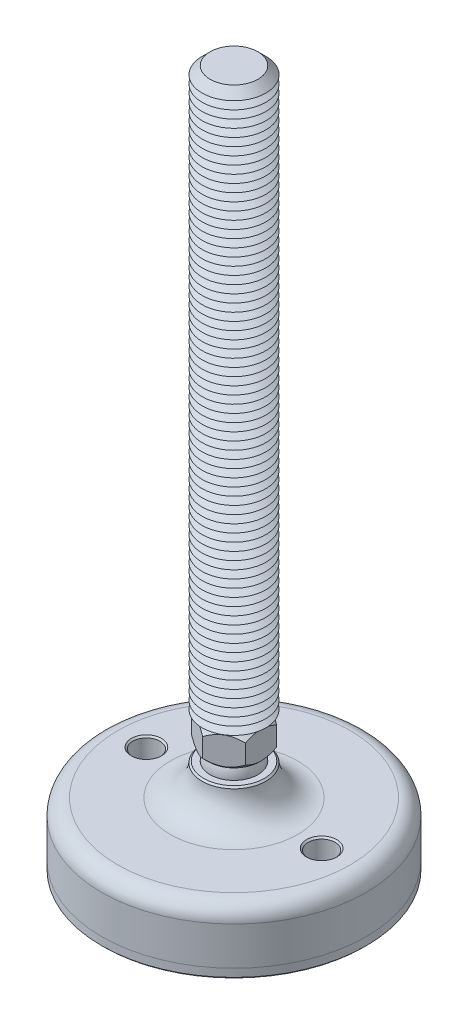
ISO-10303-21;
HEADER;
FILE_DESCRIPTION(('STEP AP214'),'2;1');
FILE_NAME('part.step','',(''),(''),'','','');
FILE_SCHEMA(('AUTOMOTIVE_DESIGN { 1 0 10303 214 1 1 1 1 }'));
ENDSEC;
DATA;
#1=APPLICATION_CONTEXT('core data for automotive mechanical design processes');
#2=APPLICATION_PROTOCOL_DEFINITION('international standard','automotive_design',2000,#1);
#3=PRODUCT_CONTEXT('',#1,'mechanical');
#4=PRODUCT('Part','Part','',(#3));
#5=PRODUCT_RELATED_PRODUCT_CATEGORY('part','',(#4));
#6=PRODUCT_DEFINITION_FORMATION('','',#4);
#7=PRODUCT_DEFINITION_CONTEXT('part definition',#1,'design');
#8=PRODUCT_DEFINITION('design','',#6,#7);
#9=PRODUCT_DEFINITION_SHAPE('','',#8);
#10=(LENGTH_UNIT() NAMED_UNIT(*) SI_UNIT(.MILLI.,.METRE.));
#11=(NAMED_UNIT(*) PLANE_ANGLE_UNIT() SI_UNIT($,.RADIAN.));
#12=(NAMED_UNIT(*) SI_UNIT($,.STERADIAN.) SOLID_ANGLE_UNIT());
#13=UNCERTAINTY_MEASURE_WITH_UNIT(LENGTH_MEASURE(1.E-05),#10,'distance_accuracy_value','');
#14=(GEOMETRIC_REPRESENTATION_CONTEXT(3) GLOBAL_UNCERTAINTY_ASSIGNED_CONTEXT((#13)) GLOBAL_UNIT_ASSIGNED_CONTEXT((#10,
#11,#12)) REPRESENTATION_CONTEXT('',''));
#15=CARTESIAN_POINT('',(0.,0.,0.));
#16=DIRECTION('',(0.,0.,1.));
#17=DIRECTION('',(1.,0.,0.));
#18=AXIS2_PLACEMENT_3D('',#15,#16,#17);
#19=CARTESIAN_POINT('',(0.,-27.,0.));
#20=DIRECTION('',(0.,1.,0.));
#21=DIRECTION('',(0.,0.,1.));
#22=AXIS2_PLACEMENT_3D('',#19,#20,#21);
#23=PLANE('',#22);
#24=CARTESIAN_POINT('',(-27.5,-27.,0.));
#25=DIRECTION('',(0.,1.,0.));
#26=DIRECTION('',(0.,0.,1.));
#27=AXIS2_PLACEMENT_3D('',#24,#25,#26);
#28=CIRCLE('',#27,4.25000000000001);
#29=CARTESIAN_POINT('',(-27.5,-27.,4.25000000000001));
#30=VERTEX_POINT('',#29);
#31=EDGE_CURVE('P0_E43',#30,#30,#28,.T.);
#32=ORIENTED_EDGE('',*,*,#31,.F.);
#33=EDGE_LOOP('',(#32));
#34=FACE_BOUND('',#33,.T.);
#35=CARTESIAN_POINT('',(27.5,-27.,0.));
#36=DIRECTION('',(0.,1.,0.));
#37=DIRECTION('',(0.,0.,1.));
#38=AXIS2_PLACEMENT_3D('',#35,#36,#37);
#39=CIRCLE('',#38,4.25000000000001);
#40=CARTESIAN_POINT('',(27.5,-27.,4.25000000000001));
#41=VERTEX_POINT('',#40);
#42=EDGE_CURVE('P0_E44',#41,#41,#39,.T.);
#43=ORIENTED_EDGE('',*,*,#42,.F.);
#44=EDGE_LOOP('',(#43));
#45=FACE_BOUND('',#44,.T.);
#46=CARTESIAN_POINT('',(0.,-27.,0.));
#47=DIRECTION('',(0.,1.,0.));
#48=DIRECTION('',(0.,0.,1.));
#49=AXIS2_PLACEMENT_3D('',#46,#47,#48);
#50=CIRCLE('',#49,41.5);
#51=CARTESIAN_POINT('',(0.,-27.,41.5));
#52=VERTEX_POINT('',#51);
#53=EDGE_CURVE('P0_E40',#52,#52,#50,.T.);
#54=ORIENTED_EDGE('',*,*,#53,.T.);
#55=EDGE_LOOP('',(#54));
#56=FACE_BOUND('',#55,.T.);
#57=ADVANCED_FACE('P0_F14',(#34,#45,#56),#23,.T.);
#58=CARTESIAN_POINT('',(0.,48.1654938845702,0.));
#59=DIRECTION('',(0.,1.,0.));
#60=DIRECTION('',(0.,0.,1.));
#61=AXIS2_PLACEMENT_3D('',#58,#59,#60);
#62=CYLINDRICAL_SURFACE('',#61,41.5);
#63=CARTESIAN_POINT('',(0.,-29.5,0.));
#64=DIRECTION('',(0.,-1.,0.));
#65=DIRECTION('',(0.,0.,-1.));
#66=AXIS2_PLACEMENT_3D('',#63,#64,#65);
#67=CIRCLE('',#66,41.5);
#68=CARTESIAN_POINT('',(0.,-29.5,-41.5));
#69=VERTEX_POINT('',#68);
#70=EDGE_CURVE('P0_E37',#69,#69,#67,.F.);
#71=ORIENTED_EDGE('',*,*,#70,.T.);
#72=EDGE_LOOP('',(#71));
#73=FACE_BOUND('',#72,.T.);
#74=ORIENTED_EDGE('',*,*,#53,.F.);
#75=EDGE_LOOP('',(#74));
#76=FACE_BOUND('',#75,.T.);
#77=ADVANCED_FACE('P0_F54',(#73,#76),#62,.T.);
#78=CARTESIAN_POINT('',(0.,-30.,41.5));
#79=DIRECTION('',(0.,-1.,0.));
#80=DIRECTION('',(0.,0.,-1.));
#81=AXIS2_PLACEMENT_3D('',#78,#79,#80);
#82=PLANE('',#81);
#83=CARTESIAN_POINT('',(27.5,-30.,0.));
#84=DIRECTION('',(0.,-1.,0.));
#85=DIRECTION('',(0.,0.,-1.));
#86=AXIS2_PLACEMENT_3D('',#83,#84,#85);
#87=CIRCLE('',#86,4.75);
#88=CARTESIAN_POINT('',(27.5,-30.,-4.75000000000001));
#89=VERTEX_POINT('',#88);
#90=EDGE_CURVE('P0_E25',#89,#89,#87,.F.);
#91=ORIENTED_EDGE('',*,*,#90,.T.);
#92=EDGE_LOOP('',(#91));
#93=FACE_BOUND('',#92,.T.);
#94=CARTESIAN_POINT('',(-27.5,-30.,0.));
#95=DIRECTION('',(0.,-1.,0.));
#96=DIRECTION('',(0.,0.,-1.));
#97=AXIS2_PLACEMENT_3D('',#94,#95,#96);
#98=CIRCLE('',#97,4.75);
#99=CARTESIAN_POINT('',(-27.5,-30.,-4.75));
#100=VERTEX_POINT('',#99);
#101=EDGE_CURVE('P0_E29',#100,#100,#98,.F.);
#102=ORIENTED_EDGE('',*,*,#101,.T.);
#103=EDGE_LOOP('',(#102));
#104=FACE_BOUND('',#103,.T.);
#105=CARTESIAN_POINT('',(0.,-30.,0.));
#106=DIRECTION('',(0.,-1.,0.));
#107=DIRECTION('',(0.,0.,-1.));
#108=AXIS2_PLACEMENT_3D('',#105,#106,#107);
#109=CIRCLE('',#108,41.);
#110=CARTESIAN_POINT('',(0.,-30.,-41.));
#111=VERTEX_POINT('',#110);
#112=EDGE_CURVE('P0_E34',#111,#111,#109,.T.);
#113=ORIENTED_EDGE('',*,*,#112,.T.);
#114=EDGE_LOOP('',(#113));
#115=FACE_BOUND('',#114,.T.);
#116=ADVANCED_FACE('P0_F61',(#93,#104,#115),#82,.T.);
#117=CARTESIAN_POINT('',(0.,-29.5,0.));
#118=DIRECTION('',(0.,1.,0.));
#119=DIRECTION('',(0.,0.,1.));
#120=AXIS2_PLACEMENT_3D('',#117,#118,#119);
#121=CONICAL_SURFACE('',#120,41.5,0.785398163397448);
#122=ORIENTED_EDGE('',*,*,#112,.F.);
#123=EDGE_LOOP('',(#122));
#124=FACE_BOUND('',#123,.T.);
#125=ORIENTED_EDGE('',*,*,#70,.F.);
#126=EDGE_LOOP('',(#125));
#127=FACE_BOUND('',#126,.T.);
#128=ADVANCED_FACE('P0_F68',(#124,#127),#121,.T.);
#129=CARTESIAN_POINT('',(27.5,-30.,0.));
#130=DIRECTION('',(0.,1.,0.));
#131=DIRECTION('',(0.,0.,1.));
#132=AXIS2_PLACEMENT_3D('',#129,#130,#131);
#133=CYLINDRICAL_SURFACE('',#132,4.25000000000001);
#134=CARTESIAN_POINT('',(27.5,-29.5,0.));
#135=DIRECTION('',(0.,-1.,0.));
#136=DIRECTION('',(0.,0.,-1.));
#137=AXIS2_PLACEMENT_3D('',#134,#135,#136);
#138=CIRCLE('',#137,4.25000000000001);
#139=CARTESIAN_POINT('',(27.5,-29.5,-4.25000000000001));
#140=VERTEX_POINT('',#139);
#141=EDGE_CURVE('P0_E21',#140,#140,#138,.T.);
#142=ORIENTED_EDGE('',*,*,#141,.T.);
#143=EDGE_LOOP('',(#142));
#144=FACE_BOUND('',#143,.T.);
#145=ORIENTED_EDGE('',*,*,#42,.T.);
#146=EDGE_LOOP('',(#145));
#147=FACE_BOUND('',#146,.T.);
#148=ADVANCED_FACE('P0_F74',(#144,#147),#133,.F.);
#149=CARTESIAN_POINT('',(-27.5,-30.,0.));
#150=DIRECTION('',(0.,1.,0.));
#151=DIRECTION('',(0.,0.,1.));
#152=AXIS2_PLACEMENT_3D('',#149,#150,#151);
#153=CYLINDRICAL_SURFACE('',#152,4.25000000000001);
#154=CARTESIAN_POINT('',(-27.5,-29.5,0.));
#155=DIRECTION('',(0.,-1.,0.));
#156=DIRECTION('',(0.,0.,-1.));
#157=AXIS2_PLACEMENT_3D('',#154,#155,#156);
#158=CIRCLE('',#157,4.25000000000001);
#159=CARTESIAN_POINT('',(-27.5,-29.5,-4.25000000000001));
#160=VERTEX_POINT('',#159);
#161=EDGE_CURVE('P0_E10',#160,#160,#158,.T.);
#162=ORIENTED_EDGE('',*,*,#161,.T.);
#163=EDGE_LOOP('',(#162));
#164=FACE_BOUND('',#163,.T.);
#165=ORIENTED_EDGE('',*,*,#31,.T.);
#166=EDGE_LOOP('',(#165));
#167=FACE_BOUND('',#166,.T.);
#168=ADVANCED_FACE('P0_F50',(#164,#167),#153,.F.);
#169=CARTESIAN_POINT('',(27.5,-30.,0.));
#170=DIRECTION('',(0.,-1.,0.));
#171=DIRECTION('',(0.,0.,-1.));
#172=AXIS2_PLACEMENT_3D('',#169,#170,#171);
#173=CONICAL_SURFACE('',#172,4.75,0.785398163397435);
#174=ORIENTED_EDGE('',*,*,#141,.F.);
#175=EDGE_LOOP('',(#174));
#176=FACE_BOUND('',#175,.T.);
#177=ORIENTED_EDGE('',*,*,#90,.F.);
#178=EDGE_LOOP('',(#177));
#179=FACE_BOUND('',#178,.T.);
#180=ADVANCED_FACE('P0_F76',(#176,#179),#173,.F.);
#181=CARTESIAN_POINT('',(-27.5,-30.,0.));
#182=DIRECTION('',(0.,-1.,0.));
#183=DIRECTION('',(0.,0.,-1.));
#184=AXIS2_PLACEMENT_3D('',#181,#182,#183);
#185=CONICAL_SURFACE('',#184,4.75,0.785398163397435);
#186=ORIENTED_EDGE('',*,*,#161,.F.);
#187=EDGE_LOOP('',(#186));
#188=FACE_BOUND('',#187,.T.);
#189=ORIENTED_EDGE('',*,*,#101,.F.);
#190=EDGE_LOOP('',(#189));
#191=FACE_BOUND('',#190,.T.);
#192=ADVANCED_FACE('P0_F16',(#188,#191),#185,.F.);
#193=CLOSED_SHELL('',(#57,#77,#116,#128,#148,#168,#180,#192));
#194=MANIFOLD_SOLID_BREP('P0_B1',#193);
#195=CARTESIAN_POINT('',(0.,3.75,0.));
#196=DIRECTION('',(0.,1.,0.));
#197=DIRECTION('',(0.,0.,1.));
#198=AXIS2_PLACEMENT_3D('',#195,#196,#197);
#199=PLANE('',#198);
#200=CARTESIAN_POINT('',(0.,3.75,0.));
#201=DIRECTION('',(0.,1.,0.));
#202=DIRECTION('',(0.,0.,1.));
#203=AXIS2_PLACEMENT_3D('',#200,#201,#202);
#204=CIRCLE('',#203,7.99624373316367);
#205=CARTESIAN_POINT('',(0.,3.75,7.99624373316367));
#206=VERTEX_POINT('',#205);
#207=EDGE_CURVE('P1_E211',#206,#206,#204,.T.);
#208=ORIENTED_EDGE('',*,*,#207,.F.);
#209=EDGE_LOOP('',(#208));
#210=FACE_BOUND('',#209,.T.);
#211=CARTESIAN_POINT('',(0.,3.75,0.));
#212=DIRECTION('',(0.,1.,0.));
#213=DIRECTION('',(0.,0.,1.));
#214=AXIS2_PLACEMENT_3D('',#211,#212,#213);
#215=CIRCLE('',#214,6.49519052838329);
#216=CARTESIAN_POINT('',(0.,3.75,6.49519052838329));
#217=VERTEX_POINT('',#216);
#218=EDGE_CURVE('P1_E24',#217,#217,#215,.F.);
#219=ORIENTED_EDGE('',*,*,#218,.F.);
#220=EDGE_LOOP('',(#219));
#221=FACE_BOUND('',#220,.T.);
#222=ADVANCED_FACE('P1_F16',(#210,#221),#199,.F.);
#223=CARTESIAN_POINT('',(0.,0.,0.));
#224=DIRECTION('',(0.,1.,0.));
#225=DIRECTION('',(0.,0.,-1.));
#226=AXIS2_PLACEMENT_3D('',#223,#224,#225);
#227=SPHERICAL_SURFACE('',#226,7.5);
#228=ORIENTED_EDGE('',*,*,#218,.T.);
#229=EDGE_LOOP('',(#228));
#230=FACE_BOUND('',#229,.T.);
#231=ADVANCED_FACE('P1_F201',(#230),#227,.T.);
#232=CARTESIAN_POINT('',(0.,3.75,0.));
#233=DIRECTION('',(0.,1.,0.));
#234=DIRECTION('',(0.,0.,1.));
#235=AXIS2_PLACEMENT_3D('',#232,#233,#234);
#236=CONICAL_SURFACE('',#235,7.99624373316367,0.785398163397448);
#237=ORIENTED_EDGE('',*,*,#207,.T.);
#238=EDGE_LOOP('',(#237));
#239=FACE_BOUND('',#238,.T.);
#240=CARTESIAN_POINT('',(-8.5,8.90811002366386,-10.0392740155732));
#241=CARTESIAN_POINT('',(-8.5,8.72243436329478,-9.79593020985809));
#242=CARTESIAN_POINT('',(-8.5,8.53847898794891,-9.55125250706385));
#243=CARTESIAN_POINT('',(-8.5,8.17478786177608,-9.05869243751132));
#244=CARTESIAN_POINT('',(-8.5,7.99505314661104,-8.81080930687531));
#245=CARTESIAN_POINT('',(-8.5,7.63930320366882,-8.30948839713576));
#246=CARTESIAN_POINT('',(-8.5,7.46332748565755,-8.05602248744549));
#247=CARTESIAN_POINT('',(-8.5,7.11769199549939,-7.54483399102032));
#248=CARTESIAN_POINT('',(-8.5,6.94803178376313,-7.28711170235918));
#249=CARTESIAN_POINT('',(-8.5,6.60640236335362,-6.75094027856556));
#250=CARTESIAN_POINT('',(-8.5,6.43491645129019,-6.47218164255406));
#251=CARTESIAN_POINT('',(-8.5,6.10286460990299,-5.90813314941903));
#252=CARTESIAN_POINT('',(-8.5,5.94230047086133,-5.62284223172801));
#253=CARTESIAN_POINT('',(-8.5,5.63553180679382,-5.04569727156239));
#254=CARTESIAN_POINT('',(-8.5,5.48928508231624,-4.75386583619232));
#255=CARTESIAN_POINT('',(-8.5,5.21442695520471,-4.16207917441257));
#256=CARTESIAN_POINT('',(-8.5,5.08580737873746,-3.86212779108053));
#257=CARTESIAN_POINT('',(-8.5,4.86150447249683,-3.28118098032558));
#258=CARTESIAN_POINT('',(-8.5,4.7638906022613,-3.00093864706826));
#259=CARTESIAN_POINT('',(-8.5,4.59111419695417,-2.43348682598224));
#260=CARTESIAN_POINT('',(-8.5,4.51595314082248,-2.14627688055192));
#261=CARTESIAN_POINT('',(-8.5,4.39333737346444,-1.57150580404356));
#262=CARTESIAN_POINT('',(-8.5,4.34539220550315,-1.28405106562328));
#263=CARTESIAN_POINT('',(-8.5,4.27817908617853,-0.705789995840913));
#264=CARTESIAN_POINT('',(-8.5,4.25890565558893,-0.41498431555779));
#265=CARTESIAN_POINT('',(-8.5,4.25058550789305,0.155345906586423));
#266=CARTESIAN_POINT('',(-8.5,4.2603535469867,0.434853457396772));
#267=CARTESIAN_POINT('',(-8.5,4.30689978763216,0.991595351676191));
#268=CARTESIAN_POINT('',(-8.5,4.34368052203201,1.26882947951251));
#269=CARTESIAN_POINT('',(-8.5,4.44283018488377,1.82371054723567));
#270=CARTESIAN_POINT('',(-8.5,4.50564357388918,2.10127674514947));
#271=CARTESIAN_POINT('',(-8.5,4.65343378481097,2.6503272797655));
#272=CARTESIAN_POINT('',(-8.5,4.73840907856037,2.9218120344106));
#273=CARTESIAN_POINT('',(-8.5,4.93373614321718,3.47773657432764));
#274=CARTESIAN_POINT('',(-8.5,5.04548526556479,3.7616800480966));
#275=CARTESIAN_POINT('',(-8.5,5.28620549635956,4.3222352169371));
#276=CARTESIAN_POINT('',(-8.5,5.41518447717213,4.59884349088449));
#277=CARTESIAN_POINT('',(-8.5,5.68730204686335,5.14605293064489));
#278=CARTESIAN_POINT('',(-8.5,5.8304846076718,5.41663205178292));
#279=CARTESIAN_POINT('',(-8.5,6.1278527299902,5.95157955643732));
#280=CARTESIAN_POINT('',(-8.5,6.28203657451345,6.21594890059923));
#281=CARTESIAN_POINT('',(-8.5,6.59139861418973,6.7263367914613));
#282=CARTESIAN_POINT('',(-8.5,6.74614943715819,6.97261575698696));
#283=CARTESIAN_POINT('',(-8.5,7.06220691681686,7.46094357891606));
#284=CARTESIAN_POINT('',(-8.5,7.22351406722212,7.70299211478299));
#285=CARTESIAN_POINT('',(-8.5,7.55019288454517,8.18145952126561));
#286=CARTESIAN_POINT('',(-8.5,7.71552125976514,8.4179080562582));
#287=CARTESIAN_POINT('',(-8.5,8.05058640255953,8.88756615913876));
#288=CARTESIAN_POINT('',(-8.5,8.22032194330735,9.12077660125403));
#289=CARTESIAN_POINT('',(-8.5,8.39186061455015,9.35262965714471));
#290=B_SPLINE_CURVE_WITH_KNOTS('',3,(#240,#241,#242,#243,#244,#245,#246,#247,#248,#249,#250,
#251,#252,#253,#254,#255,#256,#257,#258,#259,#260,#261,#262,#263,#264,#265,#266,#267,#268,#269,
#270,#271,#272,#273,#274,#275,#276,#277,#278,#279,#280,#281,#282,#283,#284,#285,#286,#287,#288,
#289),.UNSPECIFIED.,.F.,.F.,(4,2,2,2,2,2,2,2,2,2,2,2,2,2,2,2,2,2,2,2,2,2,2,2,4),(0.,
0.918290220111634,1.8368034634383,2.76241942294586,3.68797083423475,4.66961920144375,
5.65142809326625,6.63025007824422,7.60861662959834,8.49811159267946,9.38766513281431,
10.2606329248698,11.1334338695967,11.9711093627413,12.8088634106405,13.6615517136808,
14.5141812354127,15.4289018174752,16.3440417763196,17.2621089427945,18.1800331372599,
19.0524996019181,19.9250318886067,20.7905246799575,21.6557790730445),.UNSPECIFIED.);
#291=CARTESIAN_POINT('',(-8.5,5.56871084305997,-4.90747728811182));
#292=VERTEX_POINT('',#291);
#293=CARTESIAN_POINT('',(-8.5,5.56871084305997,4.90747728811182));
#294=VERTEX_POINT('',#293);
#295=EDGE_CURVE('P1_E185',#292,#294,#290,.T.);
#296=ORIENTED_EDGE('',*,*,#295,.F.);
#297=CARTESIAN_POINT('',(0.000199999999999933,5.5688263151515,-9.81507004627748));
#298=CARTESIAN_POINT('',(-0.145938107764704,5.48446627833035,-9.73069717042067));
#299=CARTESIAN_POINT('',(-0.293216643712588,5.40268088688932,-9.6456658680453));
#300=CARTESIAN_POINT('',(-0.590240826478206,5.24507616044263,-9.47417887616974));
#301=CARTESIAN_POINT('',(-0.739987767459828,5.16926008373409,-9.38772243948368));
#302=CARTESIAN_POINT('',(-1.0428413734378,5.02408965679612,-9.21286982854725));
#303=CARTESIAN_POINT('',(-1.19596236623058,4.95477479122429,-9.12446538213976));
#304=CARTESIAN_POINT('',(-1.50468648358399,4.82411695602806,-8.94622342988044));
#305=CARTESIAN_POINT('',(-1.66028922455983,4.76277276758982,-8.85638614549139));
#306=CARTESIAN_POINT('',(-2.12594374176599,4.59407400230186,-8.58754038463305));
#307=CARTESIAN_POINT('',(-2.4397129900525,4.49965525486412,-8.4063856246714));
#308=CARTESIAN_POINT('',(-2.91546156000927,4.39044680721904,-8.13171205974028));
#309=CARTESIAN_POINT('',(-3.07473438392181,4.35946186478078,-8.03975585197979));
#310=CARTESIAN_POINT('',(-3.39463410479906,4.3089933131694,-7.85506166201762));
#311=CARTESIAN_POINT('',(-3.5552607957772,4.28950798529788,-7.76232379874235));
#312=CARTESIAN_POINT('',(-3.9466882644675,4.25683795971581,-7.5363330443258));
#313=CARTESIAN_POINT('',(-4.17791015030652,4.24998362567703,-7.4028370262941));
#314=CARTESIAN_POINT('',(-4.63993781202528,4.26149030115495,-7.13608523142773));
#315=CARTESIAN_POINT('',(-4.87074341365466,4.27986014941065,-7.00282955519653));
#316=CARTESIAN_POINT('',(-5.33017839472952,4.34073256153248,-6.73757464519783));
#317=CARTESIAN_POINT('',(-5.55880504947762,4.38326211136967,-6.60557698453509));
#318=CARTESIAN_POINT('',(-6.01212885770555,4.49014170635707,-6.34385036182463));
#319=CARTESIAN_POINT('',(-6.23682631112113,4.55449007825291,-6.21412122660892));
#320=CARTESIAN_POINT('',(-6.63569693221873,4.686871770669,-5.98383316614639));
#321=CARTESIAN_POINT('',(-6.81075347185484,4.75142294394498,-5.88276422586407));
#322=CARTESIAN_POINT('',(-7.15772421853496,4.89092708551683,-5.68244057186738));
#323=CARTESIAN_POINT('',(-7.3296383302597,4.96588036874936,-5.58318591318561));
#324=CARTESIAN_POINT('',(-7.6697827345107,5.12450866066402,-5.38680344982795));
#325=CARTESIAN_POINT('',(-7.8380227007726,5.20815624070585,-5.28967006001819));
#326=CARTESIAN_POINT('',(-8.17138743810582,5.38307502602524,-5.09720183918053));
#327=CARTESIAN_POINT('',(-8.33651404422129,5.47434155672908,-5.00186594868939));
#328=CARTESIAN_POINT('',(-8.5002,5.5688263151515,-4.90736181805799));
#329=B_SPLINE_CURVE_WITH_KNOTS('',3,(#297,#298,#299,#300,#301,#302,#303,#304,#305,#306,#307,
#308,#309,#310,#311,#312,#313,#314,#315,#316,#317,#318,#319,#320,#321,#322,#323,#324,#325,#326,
#327,#328),.UNSPECIFIED.,.F.,.F.,(4,2,2,2,2,2,2,2,2,2,2,2,2,2,2,4),(0.,0.565988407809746,
1.13228364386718,1.70182141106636,2.27127198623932,3.39189520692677,3.95110786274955,
4.510236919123,5.31023384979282,6.11051117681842,6.91168416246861,7.71279572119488,
8.34908108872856,8.98538572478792,9.61974061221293,10.2537091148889),.UNSPECIFIED.);
#330=CARTESIAN_POINT('',(0.,5.56871084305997,-9.81495457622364));
#331=VERTEX_POINT('',#330);
#332=EDGE_CURVE('P1_E179',#331,#292,#329,.T.);
#333=ORIENTED_EDGE('',*,*,#332,.F.);
#334=CARTESIAN_POINT('',(8.5002,5.56882631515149,-4.90736181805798));
#335=CARTESIAN_POINT('',(8.3540618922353,5.48446627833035,-4.9917346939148));
#336=CARTESIAN_POINT('',(8.20678335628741,5.40268088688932,-5.07676599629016));
#337=CARTESIAN_POINT('',(7.90975917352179,5.24507616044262,-5.24825298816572));
#338=CARTESIAN_POINT('',(7.76001223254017,5.16926008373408,-5.33470942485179));
#339=CARTESIAN_POINT('',(7.4571586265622,5.02408965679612,-5.50956203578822));
#340=CARTESIAN_POINT('',(7.30403763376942,4.95477479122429,-5.59796648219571));
#341=CARTESIAN_POINT('',(6.99531351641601,4.82411695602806,-5.77620843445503));
#342=CARTESIAN_POINT('',(6.83971077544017,4.76277276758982,-5.86604571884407));
#343=CARTESIAN_POINT('',(6.37405625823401,4.59407400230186,-6.13489147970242));
#344=CARTESIAN_POINT('',(6.0602870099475,4.49965525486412,-6.31604623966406));
#345=CARTESIAN_POINT('',(5.58453843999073,4.39044680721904,-6.59071980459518));
#346=CARTESIAN_POINT('',(5.42526561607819,4.35946186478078,-6.68267601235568));
#347=CARTESIAN_POINT('',(5.10536589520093,4.3089933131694,-6.86737020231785));
#348=CARTESIAN_POINT('',(4.9447392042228,4.28950798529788,-6.96010806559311));
#349=CARTESIAN_POINT('',(4.5533117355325,4.25683795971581,-7.18609882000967));
#350=CARTESIAN_POINT('',(4.32208984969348,4.24998362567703,-7.31959483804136));
#351=CARTESIAN_POINT('',(3.86006218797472,4.26149030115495,-7.58634663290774));
#352=CARTESIAN_POINT('',(3.62925658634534,4.27986014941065,-7.71960230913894));
#353=CARTESIAN_POINT('',(3.16982160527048,4.34073256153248,-7.98485721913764));
#354=CARTESIAN_POINT('',(2.94119495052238,4.38326211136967,-8.11685487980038));
#355=CARTESIAN_POINT('',(2.48787114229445,4.49014170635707,-8.37858150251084));
#356=CARTESIAN_POINT('',(2.26317368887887,4.55449007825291,-8.50831063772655));
#357=CARTESIAN_POINT('',(1.86430306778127,4.686871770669,-8.73859869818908));
#358=CARTESIAN_POINT('',(1.68924652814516,4.75142294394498,-8.83966763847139));
#359=CARTESIAN_POINT('',(1.34227578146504,4.89092708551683,-9.03999129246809));
#360=CARTESIAN_POINT('',(1.1703616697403,4.96588036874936,-9.13924595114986));
#361=CARTESIAN_POINT('',(0.8302172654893,5.12450866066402,-9.33562841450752));
#362=CARTESIAN_POINT('',(0.661977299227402,5.20815624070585,-9.43276180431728));
#363=CARTESIAN_POINT('',(0.328612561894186,5.38307502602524,-9.62523002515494));
#364=CARTESIAN_POINT('',(0.163485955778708,5.47434155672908,-9.72056591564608));
#365=CARTESIAN_POINT('',(-0.000200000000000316,5.5688263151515,-9.81507004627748));
#366=B_SPLINE_CURVE_WITH_KNOTS('',3,(#334,#335,#336,#337,#338,#339,#340,#341,#342,#343,#344,
#345,#346,#347,#348,#349,#350,#351,#352,#353,#354,#355,#356,#357,#358,#359,#360,#361,#362,#363,
#364,#365),.UNSPECIFIED.,.F.,.F.,(4,2,2,2,2,2,2,2,2,2,2,2,2,2,2,4),(0.,0.565988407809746,
1.13228364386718,1.70182141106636,2.27127198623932,3.39189520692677,3.95110786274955,
4.510236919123,5.31023384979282,6.11051117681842,6.91168416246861,7.71279572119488,
8.34908108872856,8.98538572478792,9.61974061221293,10.2537091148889),.UNSPECIFIED.);
#367=CARTESIAN_POINT('',(8.5,5.56871084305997,-4.90747728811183));
#368=VERTEX_POINT('',#367);
#369=EDGE_CURVE('P1_E167',#368,#331,#366,.T.);
#370=ORIENTED_EDGE('',*,*,#369,.F.);
#371=CARTESIAN_POINT('',(8.5,8.90811002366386,-10.0392740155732));
#372=CARTESIAN_POINT('',(8.5,8.72243436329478,-9.79593020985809));
#373=CARTESIAN_POINT('',(8.5,8.5384789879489,-9.55125250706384));
#374=CARTESIAN_POINT('',(8.5,8.17478786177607,-9.05869243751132));
#375=CARTESIAN_POINT('',(8.5,7.99505314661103,-8.81080930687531));
#376=CARTESIAN_POINT('',(8.5,7.63930320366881,-8.30948839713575));
#377=CARTESIAN_POINT('',(8.5,7.46332748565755,-8.05602248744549));
#378=CARTESIAN_POINT('',(8.5,7.11769199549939,-7.54483399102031));
#379=CARTESIAN_POINT('',(8.5,6.94803178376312,-7.28711170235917));
#380=CARTESIAN_POINT('',(8.5,6.60640236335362,-6.75094027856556));
#381=CARTESIAN_POINT('',(8.5,6.43491645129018,-6.47218164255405));
#382=CARTESIAN_POINT('',(8.5,6.10286460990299,-5.90813314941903));
#383=CARTESIAN_POINT('',(8.5,5.94230047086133,-5.62284223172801));
#384=CARTESIAN_POINT('',(8.5,5.63553180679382,-5.04569727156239));
#385=CARTESIAN_POINT('',(8.5,5.48928508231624,-4.75386583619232));
#386=CARTESIAN_POINT('',(8.5,5.21442695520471,-4.16207917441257));
#387=CARTESIAN_POINT('',(8.5,5.08580737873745,-3.86212779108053));
#388=CARTESIAN_POINT('',(8.5,4.86150447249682,-3.28118098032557));
#389=CARTESIAN_POINT('',(8.5,4.7638906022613,-3.00093864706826));
#390=CARTESIAN_POINT('',(8.5,4.59111419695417,-2.43348682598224));
#391=CARTESIAN_POINT('',(8.5,4.51595314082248,-2.14627688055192));
#392=CARTESIAN_POINT('',(8.5,4.39333737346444,-1.57150580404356));
#393=CARTESIAN_POINT('',(8.5,4.34539220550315,-1.28405106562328));
#394=CARTESIAN_POINT('',(8.5,4.27817908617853,-0.705789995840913));
#395=CARTESIAN_POINT('',(8.5,4.25890565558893,-0.41498431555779));
#396=CARTESIAN_POINT('',(8.5,4.25058550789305,0.155345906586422));
#397=CARTESIAN_POINT('',(8.5,4.2603535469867,0.434853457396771));
#398=CARTESIAN_POINT('',(8.5,4.30689978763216,0.99159535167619));
#399=CARTESIAN_POINT('',(8.5,4.34368052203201,1.2688294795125));
#400=CARTESIAN_POINT('',(8.5,4.44283018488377,1.82371054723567));
#401=CARTESIAN_POINT('',(8.5,4.50564357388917,2.10127674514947));
#402=CARTESIAN_POINT('',(8.5,4.65343378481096,2.65032727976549));
#403=CARTESIAN_POINT('',(8.5,4.73840907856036,2.9218120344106));
#404=CARTESIAN_POINT('',(8.5,4.93373614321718,3.47773657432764));
#405=CARTESIAN_POINT('',(8.5,5.04548526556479,3.7616800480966));
#406=CARTESIAN_POINT('',(8.5,5.28620549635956,4.3222352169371));
#407=CARTESIAN_POINT('',(8.5,5.41518447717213,4.59884349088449));
#408=CARTESIAN_POINT('',(8.5,5.68730204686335,5.14605293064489));
#409=CARTESIAN_POINT('',(8.5,5.8304846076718,5.41663205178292));
#410=CARTESIAN_POINT('',(8.5,6.1278527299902,5.95157955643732));
#411=CARTESIAN_POINT('',(8.5,6.28203657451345,6.21594890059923));
#412=CARTESIAN_POINT('',(8.5,6.59139861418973,6.7263367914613));
#413=CARTESIAN_POINT('',(8.5,6.74614943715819,6.97261575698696));
#414=CARTESIAN_POINT('',(8.5,7.06220691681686,7.46094357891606));
#415=CARTESIAN_POINT('',(8.5,7.22351406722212,7.70299211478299));
#416=CARTESIAN_POINT('',(8.5,7.55019288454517,8.18145952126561));
#417=CARTESIAN_POINT('',(8.5,7.71552125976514,8.4179080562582));
#418=CARTESIAN_POINT('',(8.5,8.05058640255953,8.88756615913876));
#419=CARTESIAN_POINT('',(8.5,8.22032194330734,9.12077660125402));
#420=CARTESIAN_POINT('',(8.5,8.39186061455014,9.35262965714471));
#421=B_SPLINE_CURVE_WITH_KNOTS('',3,(#371,#372,#373,#374,#375,#376,#377,#378,#379,#380,#381,
#382,#383,#384,#385,#386,#387,#388,#389,#390,#391,#392,#393,#394,#395,#396,#397,#398,#399,#400,
#401,#402,#403,#404,#405,#406,#407,#408,#409,#410,#411,#412,#413,#414,#415,#416,#417,#418,#419,
#420),.UNSPECIFIED.,.F.,.F.,(4,2,2,2,2,2,2,2,2,2,2,2,2,2,2,2,2,2,2,2,2,2,2,2,4),(0.,
0.918290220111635,1.8368034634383,2.76241942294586,3.68797083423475,4.66961920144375,
5.65142809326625,6.63025007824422,7.60861662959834,8.49811159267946,9.38766513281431,
10.2606329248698,11.1334338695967,11.9711093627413,12.8088634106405,13.6615517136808,
14.5141812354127,15.4289018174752,16.3440417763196,17.2621089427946,18.1800331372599,
19.0524996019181,19.9250318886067,20.7905246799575,21.6557790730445),.UNSPECIFIED.);
#422=CARTESIAN_POINT('',(8.5,5.56871084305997,4.90747728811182));
#423=VERTEX_POINT('',#422);
#424=EDGE_CURVE('P1_E70',#423,#368,#421,.F.);
#425=ORIENTED_EDGE('',*,*,#424,.F.);
#426=CARTESIAN_POINT('',(-0.000200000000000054,5.56882631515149,9.81507004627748));
#427=CARTESIAN_POINT('',(0.145938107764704,5.48446627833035,9.73069717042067));
#428=CARTESIAN_POINT('',(0.293216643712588,5.40268088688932,9.6456658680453));
#429=CARTESIAN_POINT('',(0.590240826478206,5.24507616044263,9.47417887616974));
#430=CARTESIAN_POINT('',(0.739987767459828,5.16926008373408,9.38772243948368));
#431=CARTESIAN_POINT('',(1.0428413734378,5.02408965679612,9.21286982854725));
#432=CARTESIAN_POINT('',(1.19596236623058,4.95477479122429,9.12446538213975));
#433=CARTESIAN_POINT('',(1.50468648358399,4.82411695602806,8.94622342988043));
#434=CARTESIAN_POINT('',(1.66028922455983,4.76277276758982,8.85638614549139));
#435=CARTESIAN_POINT('',(2.12594374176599,4.59407400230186,8.58754038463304));
#436=CARTESIAN_POINT('',(2.4397129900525,4.49965525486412,8.4063856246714));
#437=CARTESIAN_POINT('',(2.91546156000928,4.39044680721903,8.13171205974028));
#438=CARTESIAN_POINT('',(3.07473438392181,4.35946186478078,8.03975585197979));
#439=CARTESIAN_POINT('',(3.39463410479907,4.3089933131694,7.85506166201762));
#440=CARTESIAN_POINT('',(3.55526079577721,4.28950798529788,7.76232379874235));
#441=CARTESIAN_POINT('',(3.9466882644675,4.25683795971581,7.53633304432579));
#442=CARTESIAN_POINT('',(4.17791015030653,4.24998362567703,7.4028370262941));
#443=CARTESIAN_POINT('',(4.63993781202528,4.26149030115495,7.13608523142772));
#444=CARTESIAN_POINT('',(4.87074341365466,4.27986014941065,7.00282955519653));
#445=CARTESIAN_POINT('',(5.33017839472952,4.34073256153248,6.73757464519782));
#446=CARTESIAN_POINT('',(5.55880504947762,4.38326211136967,6.60557698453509));
#447=CARTESIAN_POINT('',(6.01212885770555,4.49014170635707,6.34385036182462));
#448=CARTESIAN_POINT('',(6.23682631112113,4.55449007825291,6.21412122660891));
#449=CARTESIAN_POINT('',(6.63569693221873,4.686871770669,5.98383316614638));
#450=CARTESIAN_POINT('',(6.81075347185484,4.75142294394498,5.88276422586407));
#451=CARTESIAN_POINT('',(7.15772421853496,4.89092708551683,5.68244057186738));
#452=CARTESIAN_POINT('',(7.3296383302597,4.96588036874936,5.58318591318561));
#453=CARTESIAN_POINT('',(7.6697827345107,5.12450866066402,5.38680344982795));
#454=CARTESIAN_POINT('',(7.8380227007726,5.20815624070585,5.28967006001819));
#455=CARTESIAN_POINT('',(8.17138743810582,5.38307502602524,5.09720183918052));
#456=CARTESIAN_POINT('',(8.33651404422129,5.47434155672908,5.00186594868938));
#457=CARTESIAN_POINT('',(8.5002,5.56882631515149,4.90736181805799));
#458=B_SPLINE_CURVE_WITH_KNOTS('',3,(#426,#427,#428,#429,#430,#431,#432,#433,#434,#435,#436,
#437,#438,#439,#440,#441,#442,#443,#444,#445,#446,#447,#448,#449,#450,#451,#452,#453,#454,#455,
#456,#457),.UNSPECIFIED.,.F.,.F.,(4,2,2,2,2,2,2,2,2,2,2,2,2,2,2,4),(0.,0.565988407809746,
1.13228364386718,1.70182141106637,2.27127198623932,3.39189520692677,3.95110786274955,
4.51023691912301,5.31023384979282,6.11051117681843,6.91168416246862,7.71279572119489,
8.34908108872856,8.98538572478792,9.61974061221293,10.2537091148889),.UNSPECIFIED.);
#459=CARTESIAN_POINT('',(0.,5.56871084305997,9.81495457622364));
#460=VERTEX_POINT('',#459);
#461=EDGE_CURVE('P1_E67',#460,#423,#458,.T.);
#462=ORIENTED_EDGE('',*,*,#461,.F.);
#463=CARTESIAN_POINT('',(-8.5002,5.56882631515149,4.90736181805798));
#464=CARTESIAN_POINT('',(-8.3540618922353,5.48446627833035,4.9917346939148));
#465=CARTESIAN_POINT('',(-8.20678335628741,5.40268088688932,5.07676599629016));
#466=CARTESIAN_POINT('',(-7.90975917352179,5.24507616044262,5.24825298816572));
#467=CARTESIAN_POINT('',(-7.76001223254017,5.16926008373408,5.33470942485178));
#468=CARTESIAN_POINT('',(-7.4571586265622,5.02408965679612,5.50956203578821));
#469=CARTESIAN_POINT('',(-7.30403763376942,4.95477479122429,5.59796648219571));
#470=CARTESIAN_POINT('',(-6.99531351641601,4.82411695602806,5.77620843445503));
#471=CARTESIAN_POINT('',(-6.83971077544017,4.76277276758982,5.86604571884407));
#472=CARTESIAN_POINT('',(-6.37405625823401,4.59407400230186,6.13489147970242));
#473=CARTESIAN_POINT('',(-6.0602870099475,4.49965525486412,6.31604623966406));
#474=CARTESIAN_POINT('',(-5.58453843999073,4.39044680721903,6.59071980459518));
#475=CARTESIAN_POINT('',(-5.42526561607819,4.35946186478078,6.68267601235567));
#476=CARTESIAN_POINT('',(-5.10536589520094,4.30899331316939,6.86737020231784));
#477=CARTESIAN_POINT('',(-4.9447392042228,4.28950798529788,6.96010806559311));
#478=CARTESIAN_POINT('',(-4.5533117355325,4.25683795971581,7.18609882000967));
#479=CARTESIAN_POINT('',(-4.32208984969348,4.24998362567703,7.31959483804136));
#480=CARTESIAN_POINT('',(-3.86006218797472,4.26149030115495,7.58634663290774));
#481=CARTESIAN_POINT('',(-3.62925658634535,4.27986014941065,7.71960230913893));
#482=CARTESIAN_POINT('',(-3.16982160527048,4.34073256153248,7.98485721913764));
#483=CARTESIAN_POINT('',(-2.94119495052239,4.38326211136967,8.11685487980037));
#484=CARTESIAN_POINT('',(-2.48787114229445,4.49014170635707,8.37858150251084));
#485=CARTESIAN_POINT('',(-2.26317368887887,4.55449007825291,8.50831063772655));
#486=CARTESIAN_POINT('',(-1.86430306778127,4.686871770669,8.73859869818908));
#487=CARTESIAN_POINT('',(-1.68924652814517,4.75142294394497,8.83966763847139));
#488=CARTESIAN_POINT('',(-1.34227578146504,4.89092708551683,9.03999129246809));
#489=CARTESIAN_POINT('',(-1.1703616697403,4.96588036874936,9.13924595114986));
#490=CARTESIAN_POINT('',(-0.830217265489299,5.12450866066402,9.33562841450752));
#491=CARTESIAN_POINT('',(-0.6619772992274,5.20815624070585,9.43276180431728));
#492=CARTESIAN_POINT('',(-0.328612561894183,5.38307502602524,9.62523002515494));
#493=CARTESIAN_POINT('',(-0.163485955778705,5.47434155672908,9.72056591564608));
#494=CARTESIAN_POINT('',(0.000200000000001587,5.5688263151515,9.81507004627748));
#495=B_SPLINE_CURVE_WITH_KNOTS('',3,(#463,#464,#465,#466,#467,#468,#469,#470,#471,#472,#473,
#474,#475,#476,#477,#478,#479,#480,#481,#482,#483,#484,#485,#486,#487,#488,#489,#490,#491,#492,
#493,#494),.UNSPECIFIED.,.F.,.F.,(4,2,2,2,2,2,2,2,2,2,2,2,2,2,2,4),(0.,0.565988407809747,
1.13228364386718,1.70182141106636,2.27127198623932,3.39189520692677,3.95110786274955,
4.510236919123,5.31023384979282,6.11051117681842,6.91168416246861,7.71279572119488,
8.34908108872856,8.98538572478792,9.61974061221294,10.2537091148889),.UNSPECIFIED.);
#496=EDGE_CURVE('P1_E39',#294,#460,#495,.T.);
#497=ORIENTED_EDGE('',*,*,#496,.F.);
#498=EDGE_LOOP('',(#296,#333,#370,#425,#462,#497));
#499=FACE_BOUND('',#498,.T.);
#500=ADVANCED_FACE('P1_F68',(#239,#499),#236,.T.);
#501=CARTESIAN_POINT('',(-8.5,14.,-4.90747728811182));
#502=DIRECTION('',(1.,0.,0.));
#503=DIRECTION('',(0.,0.,-1.));
#504=AXIS2_PLACEMENT_3D('',#501,#502,#503);
#505=PLANE('',#504);
#506=DIRECTION('',(0.,-1.,0.));
#507=VECTOR('',#506,1.);
#508=CARTESIAN_POINT('',(-8.5,14.,4.90747728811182));
#509=LINE('',#508,#507);
#510=CARTESIAN_POINT('',(-8.5,11.5462613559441,4.90747728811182));
#511=VERTEX_POINT('',#510);
#512=EDGE_CURVE('P1_E83',#511,#294,#509,.T.);
#513=ORIENTED_EDGE('',*,*,#512,.F.);
#514=CARTESIAN_POINT('',(-8.5,8.39798309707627,-9.78751273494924));
#515=CARTESIAN_POINT('',(-8.5,8.57787513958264,-9.54919755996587));
#516=CARTESIAN_POINT('',(-8.5,8.75602828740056,-9.30954807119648));
#517=CARTESIAN_POINT('',(-8.5,9.10807823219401,-8.827054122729));
#518=CARTESIAN_POINT('',(-8.5,9.2819739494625,-8.58420887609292));
#519=CARTESIAN_POINT('',(-8.5,9.62596686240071,-8.09302066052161));
#520=CARTESIAN_POINT('',(-8.5,9.79602418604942,-7.84464967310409));
#521=CARTESIAN_POINT('',(-8.5,10.1297912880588,-7.34369187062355));
#522=CARTESIAN_POINT('',(-8.5,10.2935015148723,-7.09110535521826));
#523=CARTESIAN_POINT('',(-8.5,10.6222985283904,-6.566468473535));
#524=CARTESIAN_POINT('',(-8.5,10.7869291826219,-6.29413078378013));
#525=CARTESIAN_POINT('',(-8.5,11.1053589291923,-5.74309849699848));
#526=CARTESIAN_POINT('',(-8.5,11.259156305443,-5.464402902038));
#527=CARTESIAN_POINT('',(-8.5,11.5526010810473,-4.90068072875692));
#528=CARTESIAN_POINT('',(-8.5,11.6922900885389,-4.61567598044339));
#529=CARTESIAN_POINT('',(-8.5,11.9543910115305,-4.0378936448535));
#530=CARTESIAN_POINT('',(-8.5,12.0768107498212,-3.74511964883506));
#531=CARTESIAN_POINT('',(-8.5,12.2910322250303,-3.17524396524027));
#532=CARTESIAN_POINT('',(-8.5,12.38450510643,-2.89877705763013));
#533=CARTESIAN_POINT('',(-8.5,12.5492711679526,-2.33918702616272));
#534=CARTESIAN_POINT('',(-8.5,12.6205628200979,-2.05606344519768));
#535=CARTESIAN_POINT('',(-8.5,12.7360573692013,-1.48955968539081));
#536=CARTESIAN_POINT('',(-8.5,12.7807243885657,-1.2062756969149));
#537=CARTESIAN_POINT('',(-8.5,12.8421027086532,-0.636679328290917));
#538=CARTESIAN_POINT('',(-8.5,12.8588188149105,-0.35036747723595));
#539=CARTESIAN_POINT('',(-8.5,12.8630538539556,0.212098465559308));
#540=CARTESIAN_POINT('',(-8.5,12.8516076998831,0.488245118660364));
#541=CARTESIAN_POINT('',(-8.5,12.8024337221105,1.03817300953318));
#542=CARTESIAN_POINT('',(-8.5,12.7647033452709,1.31195401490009));
#543=CARTESIAN_POINT('',(-8.5,12.6643776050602,1.85979788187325));
#544=CARTESIAN_POINT('',(-8.5,12.6013591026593,2.13378200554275));
#545=CARTESIAN_POINT('',(-8.5,12.4538179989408,2.67578043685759));
#546=CARTESIAN_POINT('',(-8.5,12.3692971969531,2.94379524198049));
#547=CARTESIAN_POINT('',(-8.5,12.1735358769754,3.49812653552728));
#548=CARTESIAN_POINT('',(-8.5,12.0605376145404,3.78381596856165));
#549=CARTESIAN_POINT('',(-8.5,11.8171932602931,4.34777400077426));
#550=CARTESIAN_POINT('',(-8.5,11.686839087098,4.62603907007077));
#551=CARTESIAN_POINT('',(-8.5,11.4118843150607,5.17650827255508));
#552=CARTESIAN_POINT('',(-8.5,11.2672389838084,5.44868988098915));
#553=CARTESIAN_POINT('',(-8.5,10.9668989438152,5.9867894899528));
#554=CARTESIAN_POINT('',(-8.5,10.811205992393,6.25270847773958));
#555=CARTESIAN_POINT('',(-8.5,10.4989138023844,6.76601719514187));
#556=CARTESIAN_POINT('',(-8.5,10.3427453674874,7.0136704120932));
#557=CARTESIAN_POINT('',(-8.5,10.0238413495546,7.50472523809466));
#558=CARTESIAN_POINT('',(-8.5,9.86110526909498,7.74812652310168));
#559=CARTESIAN_POINT('',(-8.5,9.53158408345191,8.22926020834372));
#560=CARTESIAN_POINT('',(-8.5,9.36484260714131,8.46702259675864));
#561=CARTESIAN_POINT('',(-8.5,9.02695015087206,8.93929808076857));
#562=CARTESIAN_POINT('',(-8.5,8.85580039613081,9.17381205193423));
#563=CARTESIAN_POINT('',(-8.5,8.68284834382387,9.40696575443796));
#564=B_SPLINE_CURVE_WITH_KNOTS('',3,(#514,#515,#516,#517,#518,#519,#520,#521,#522,#523,#524,
#525,#526,#527,#528,#529,#530,#531,#532,#533,#534,#535,#536,#537,#538,#539,#540,#541,#542,#543,
#544,#545,#546,#547,#548,#549,#550,#551,#552,#553,#554,#555,#556,#557,#558,#559,#560,#561,#562,
#563),.UNSPECIFIED.,.F.,.F.,(4,2,2,2,2,2,2,2,2,2,2,2,2,2,2,2,2,2,2,2,2,2,2,2,4),(0.,
0.895784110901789,1.79179309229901,2.69474460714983,3.59763220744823,4.55212531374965,
5.50676928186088,6.45851015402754,7.4098185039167,8.28457217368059,9.15938608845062,
10.0184667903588,10.8773997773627,11.7052430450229,12.5331667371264,13.3755635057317,
14.2178898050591,15.138846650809,16.060233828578,16.9846023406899,17.9088241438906,
18.7870452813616,19.6653330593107,20.5364863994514,21.4074001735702),.UNSPECIFIED.);
#565=CARTESIAN_POINT('',(-8.5,11.5462613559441,-4.90747728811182));
#566=VERTEX_POINT('',#565);
#567=EDGE_CURVE('P1_E84',#511,#566,#564,.F.);
#568=ORIENTED_EDGE('',*,*,#567,.T.);
#569=DIRECTION('',(0.,-1.,0.));
#570=VECTOR('',#569,1.);
#571=CARTESIAN_POINT('',(-8.5,14.,-4.90747728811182));
#572=LINE('',#571,#570);
#573=EDGE_CURVE('P1_E100',#566,#292,#572,.T.);
#574=ORIENTED_EDGE('',*,*,#573,.T.);
#575=ORIENTED_EDGE('',*,*,#295,.T.);
#576=EDGE_LOOP('',(#513,#568,#574,#575));
#577=FACE_BOUND('',#576,.T.);
#578=ADVANCED_FACE('P1_F193',(#577),#505,.F.);
#579=CARTESIAN_POINT('',(0.,14.,-9.81495457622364));
#580=DIRECTION('',(0.5,0.,0.866025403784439));
#581=DIRECTION('',(0.866025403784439,0.,-0.5));
#582=AXIS2_PLACEMENT_3D('',#579,#580,#581);
#583=PLANE('',#582);
#584=ORIENTED_EDGE('',*,*,#573,.F.);
#585=CARTESIAN_POINT('',(-8.5002,11.5461458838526,-4.90736181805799));
#586=CARTESIAN_POINT('',(-8.3540618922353,11.6305059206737,-4.9917346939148));
#587=CARTESIAN_POINT('',(-8.20678335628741,11.7122913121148,-5.07676599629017));
#588=CARTESIAN_POINT('',(-7.90975917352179,11.8698960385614,-5.24825298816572));
#589=CARTESIAN_POINT('',(-7.76001223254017,11.94571211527,-5.33470942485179));
#590=CARTESIAN_POINT('',(-7.4571586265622,12.0908825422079,-5.50956203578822));
#591=CARTESIAN_POINT('',(-7.30403763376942,12.1601974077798,-5.59796648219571));
#592=CARTESIAN_POINT('',(-6.99531351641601,12.290855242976,-5.77620843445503));
#593=CARTESIAN_POINT('',(-6.83971077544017,12.3521994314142,-5.86604571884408));
#594=CARTESIAN_POINT('',(-6.37405625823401,12.5208981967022,-6.13489147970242));
#595=CARTESIAN_POINT('',(-6.0602870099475,12.61531694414,-6.31604623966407));
#596=CARTESIAN_POINT('',(-5.58453843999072,12.724525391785,-6.59071980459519));
#597=CARTESIAN_POINT('',(-5.42526561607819,12.7555103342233,-6.68267601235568));
#598=CARTESIAN_POINT('',(-5.10536589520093,12.8059788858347,-6.86737020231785));
#599=CARTESIAN_POINT('',(-4.94473920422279,12.8254642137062,-6.96010806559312));
#600=CARTESIAN_POINT('',(-4.55331173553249,12.8581342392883,-7.18609882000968));
#601=CARTESIAN_POINT('',(-4.32208984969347,12.864988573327,-7.31959483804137));
#602=CARTESIAN_POINT('',(-3.86006218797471,12.8534818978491,-7.58634663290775));
#603=CARTESIAN_POINT('',(-3.62925658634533,12.8351120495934,-7.71960230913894));
#604=CARTESIAN_POINT('',(-3.16982160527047,12.7742396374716,-7.98485721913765));
#605=CARTESIAN_POINT('',(-2.94119495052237,12.7317100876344,-8.11685487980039));
#606=CARTESIAN_POINT('',(-2.48787114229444,12.624830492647,-8.37858150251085));
#607=CARTESIAN_POINT('',(-2.26317368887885,12.5604821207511,-8.50831063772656));
#608=CARTESIAN_POINT('',(-1.86430306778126,12.4281004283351,-8.73859869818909));
#609=CARTESIAN_POINT('',(-1.68924652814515,12.3635492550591,-8.8396676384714));
#610=CARTESIAN_POINT('',(-1.34227578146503,12.2240451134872,-9.03999129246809));
#611=CARTESIAN_POINT('',(-1.17036166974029,12.1490918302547,-9.13924595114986));
#612=CARTESIAN_POINT('',(-0.830217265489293,11.99046353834,-9.33562841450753));
#613=CARTESIAN_POINT('',(-0.661977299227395,11.9068159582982,-9.43276180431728));
#614=CARTESIAN_POINT('',(-0.328612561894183,11.7318971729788,-9.62523002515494));
#615=CARTESIAN_POINT('',(-0.163485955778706,11.640630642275,-9.72056591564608));
#616=CARTESIAN_POINT('',(0.000199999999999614,11.5461458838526,-9.81507004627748));
#617=B_SPLINE_CURVE_WITH_KNOTS('',3,(#585,#586,#587,#588,#589,#590,#591,#592,#593,#594,#595,
#596,#597,#598,#599,#600,#601,#602,#603,#604,#605,#606,#607,#608,#609,#610,#611,#612,#613,#614,
#615,#616),.UNSPECIFIED.,.F.,.F.,(4,2,2,2,2,2,2,2,2,2,2,2,2,2,2,4),(0.,0.565988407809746,
1.13228364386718,1.70182141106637,2.27127198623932,3.39189520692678,3.95110786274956,
4.51023691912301,5.31023384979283,6.11051117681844,6.91168416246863,7.7127957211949,
8.34908108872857,8.98538572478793,9.61974061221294,10.2537091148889),.UNSPECIFIED.);
#618=CARTESIAN_POINT('',(0.,11.5462613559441,-9.81495457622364));
#619=VERTEX_POINT('',#618);
#620=EDGE_CURVE('P1_E31',#566,#619,#617,.T.);
#621=ORIENTED_EDGE('',*,*,#620,.T.);
#622=DIRECTION('',(0.,-1.,0.));
#623=VECTOR('',#622,1.);
#624=CARTESIAN_POINT('',(0.,14.,-9.81495457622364));
#625=LINE('',#624,#623);
#626=EDGE_CURVE('P1_E97',#619,#331,#625,.T.);
#627=ORIENTED_EDGE('',*,*,#626,.T.);
#628=ORIENTED_EDGE('',*,*,#332,.T.);
#629=EDGE_LOOP('',(#584,#621,#627,#628));
#630=FACE_BOUND('',#629,.T.);
#631=ADVANCED_FACE('P1_F190',(#630),#583,.F.);
#632=CARTESIAN_POINT('',(8.5,14.,-4.90747728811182));
#633=DIRECTION('',(-0.5,0.,0.866025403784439));
#634=DIRECTION('',(0.866025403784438,0.,0.5));
#635=AXIS2_PLACEMENT_3D('',#632,#633,#634);
#636=PLANE('',#635);
#637=ORIENTED_EDGE('',*,*,#626,.F.);
#638=CARTESIAN_POINT('',(-0.000199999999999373,11.5461458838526,-9.81507004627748));
#639=CARTESIAN_POINT('',(0.145938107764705,11.6305059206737,-9.73069717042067));
#640=CARTESIAN_POINT('',(0.293216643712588,11.7122913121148,-9.6456658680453));
#641=CARTESIAN_POINT('',(0.590240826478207,11.8698960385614,-9.47417887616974));
#642=CARTESIAN_POINT('',(0.739987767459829,11.94571211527,-9.38772243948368));
#643=CARTESIAN_POINT('',(1.0428413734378,12.0908825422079,-9.21286982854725));
#644=CARTESIAN_POINT('',(1.19596236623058,12.1601974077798,-9.12446538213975));
#645=CARTESIAN_POINT('',(1.504686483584,12.290855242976,-8.94622342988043));
#646=CARTESIAN_POINT('',(1.66028922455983,12.3521994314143,-8.85638614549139));
#647=CARTESIAN_POINT('',(2.125943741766,12.5208981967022,-8.58754038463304));
#648=CARTESIAN_POINT('',(2.43971299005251,12.61531694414,-8.4063856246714));
#649=CARTESIAN_POINT('',(2.91546156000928,12.724525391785,-8.13171205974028));
#650=CARTESIAN_POINT('',(3.07473438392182,12.7555103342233,-8.03975585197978));
#651=CARTESIAN_POINT('',(3.39463410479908,12.8059788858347,-7.85506166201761));
#652=CARTESIAN_POINT('',(3.55526079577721,12.8254642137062,-7.76232379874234));
#653=CARTESIAN_POINT('',(3.94668826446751,12.8581342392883,-7.53633304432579));
#654=CARTESIAN_POINT('',(4.17791015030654,12.864988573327,-7.40283702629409));
#655=CARTESIAN_POINT('',(4.63993781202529,12.8534818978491,-7.13608523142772));
#656=CARTESIAN_POINT('',(4.87074341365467,12.8351120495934,-7.00282955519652));
#657=CARTESIAN_POINT('',(5.33017839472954,12.7742396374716,-6.73757464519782));
#658=CARTESIAN_POINT('',(5.55880504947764,12.7317100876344,-6.60557698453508));
#659=CARTESIAN_POINT('',(6.01212885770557,12.624830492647,-6.34385036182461));
#660=CARTESIAN_POINT('',(6.23682631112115,12.5604821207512,-6.2141212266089));
#661=CARTESIAN_POINT('',(6.63569693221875,12.4281004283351,-5.98383316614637));
#662=CARTESIAN_POINT('',(6.81075347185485,12.3635492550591,-5.88276422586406));
#663=CARTESIAN_POINT('',(7.15772421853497,12.2240451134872,-5.68244057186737));
#664=CARTESIAN_POINT('',(7.32963833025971,12.1490918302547,-5.5831859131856));
#665=CARTESIAN_POINT('',(7.66978273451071,11.99046353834,-5.38680344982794));
#666=CARTESIAN_POINT('',(7.83802270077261,11.9068159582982,-5.28967006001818));
#667=CARTESIAN_POINT('',(8.17138743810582,11.7318971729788,-5.09720183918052));
#668=CARTESIAN_POINT('',(8.33651404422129,11.640630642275,-5.00186594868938));
#669=CARTESIAN_POINT('',(8.5002,11.5461458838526,-4.90736181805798));
#670=B_SPLINE_CURVE_WITH_KNOTS('',3,(#638,#639,#640,#641,#642,#643,#644,#645,#646,#647,#648,
#649,#650,#651,#652,#653,#654,#655,#656,#657,#658,#659,#660,#661,#662,#663,#664,#665,#666,#667,
#668,#669),.UNSPECIFIED.,.F.,.F.,(4,2,2,2,2,2,2,2,2,2,2,2,2,2,2,4),(0.,0.565988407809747,
1.13228364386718,1.70182141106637,2.27127198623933,3.39189520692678,3.95110786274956,
4.51023691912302,5.31023384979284,6.11051117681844,6.91168416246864,7.71279572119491,
8.34908108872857,8.98538572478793,9.61974061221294,10.2537091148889),.UNSPECIFIED.);
#671=CARTESIAN_POINT('',(8.5,11.5462613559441,-4.90747728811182));
#672=VERTEX_POINT('',#671);
#673=EDGE_CURVE('P1_E143',#619,#672,#670,.T.);
#674=ORIENTED_EDGE('',*,*,#673,.T.);
#675=DIRECTION('',(0.,-1.,0.));
#676=VECTOR('',#675,1.);
#677=CARTESIAN_POINT('',(8.5,14.,-4.90747728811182));
#678=LINE('',#677,#676);
#679=EDGE_CURVE('P1_E92',#672,#368,#678,.T.);
#680=ORIENTED_EDGE('',*,*,#679,.T.);
#681=ORIENTED_EDGE('',*,*,#369,.T.);
#682=EDGE_LOOP('',(#637,#674,#680,#681));
#683=FACE_BOUND('',#682,.T.);
#684=ADVANCED_FACE('P1_F157',(#683),#636,.F.);
#685=CARTESIAN_POINT('',(8.5,14.,4.90747728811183));
#686=DIRECTION('',(-1.,0.,0.));
#687=DIRECTION('',(0.,0.,1.));
#688=AXIS2_PLACEMENT_3D('',#685,#686,#687);
#689=PLANE('',#688);
#690=ORIENTED_EDGE('',*,*,#679,.F.);
#691=CARTESIAN_POINT('',(8.5,8.39798309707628,-9.78751273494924));
#692=CARTESIAN_POINT('',(8.5,8.57787513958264,-9.54919755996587));
#693=CARTESIAN_POINT('',(8.5,8.75602828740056,-9.30954807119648));
#694=CARTESIAN_POINT('',(8.5,9.10807823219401,-8.827054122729));
#695=CARTESIAN_POINT('',(8.5,9.2819739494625,-8.58420887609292));
#696=CARTESIAN_POINT('',(8.5,9.62596686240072,-8.09302066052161));
#697=CARTESIAN_POINT('',(8.5,9.79602418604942,-7.84464967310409));
#698=CARTESIAN_POINT('',(8.5,10.1297912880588,-7.34369187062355));
#699=CARTESIAN_POINT('',(8.5,10.2935015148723,-7.09110535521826));
#700=CARTESIAN_POINT('',(8.5,10.6222985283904,-6.566468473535));
#701=CARTESIAN_POINT('',(8.5,10.7869291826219,-6.29413078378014));
#702=CARTESIAN_POINT('',(8.5,11.1053589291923,-5.74309849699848));
#703=CARTESIAN_POINT('',(8.5,11.259156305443,-5.46440290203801));
#704=CARTESIAN_POINT('',(8.5,11.5526010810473,-4.90068072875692));
#705=CARTESIAN_POINT('',(8.5,11.6922900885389,-4.61567598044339));
#706=CARTESIAN_POINT('',(8.5,11.9543910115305,-4.0378936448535));
#707=CARTESIAN_POINT('',(8.5,12.0768107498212,-3.74511964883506));
#708=CARTESIAN_POINT('',(8.5,12.2910322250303,-3.17524396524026));
#709=CARTESIAN_POINT('',(8.5,12.38450510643,-2.89877705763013));
#710=CARTESIAN_POINT('',(8.5,12.5492711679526,-2.33918702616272));
#711=CARTESIAN_POINT('',(8.5,12.6205628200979,-2.05606344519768));
#712=CARTESIAN_POINT('',(8.5,12.7360573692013,-1.48955968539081));
#713=CARTESIAN_POINT('',(8.5,12.7807243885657,-1.2062756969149));
#714=CARTESIAN_POINT('',(8.5,12.8421027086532,-0.636679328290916));
#715=CARTESIAN_POINT('',(8.5,12.8588188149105,-0.350367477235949));
#716=CARTESIAN_POINT('',(8.5,12.8630538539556,0.212098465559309));
#717=CARTESIAN_POINT('',(8.5,12.8516076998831,0.488245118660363));
#718=CARTESIAN_POINT('',(8.5,12.8024337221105,1.03817300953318));
#719=CARTESIAN_POINT('',(8.5,12.7647033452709,1.31195401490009));
#720=CARTESIAN_POINT('',(8.5,12.6643776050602,1.85979788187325));
#721=CARTESIAN_POINT('',(8.5,12.6013591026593,2.13378200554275));
#722=CARTESIAN_POINT('',(8.5,12.4538179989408,2.67578043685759));
#723=CARTESIAN_POINT('',(8.5,12.3692971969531,2.94379524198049));
#724=CARTESIAN_POINT('',(8.5,12.1735358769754,3.49812653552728));
#725=CARTESIAN_POINT('',(8.5,12.0605376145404,3.78381596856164));
#726=CARTESIAN_POINT('',(8.5,11.8171932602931,4.34777400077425));
#727=CARTESIAN_POINT('',(8.5,11.686839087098,4.62603907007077));
#728=CARTESIAN_POINT('',(8.5,11.4118843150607,5.17650827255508));
#729=CARTESIAN_POINT('',(8.5,11.2672389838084,5.44868988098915));
#730=CARTESIAN_POINT('',(8.5,10.9668989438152,5.9867894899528));
#731=CARTESIAN_POINT('',(8.5,10.811205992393,6.25270847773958));
#732=CARTESIAN_POINT('',(8.5,10.4989138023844,6.76601719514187));
#733=CARTESIAN_POINT('',(8.5,10.3427453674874,7.01367041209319));
#734=CARTESIAN_POINT('',(8.5,10.0238413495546,7.50472523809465));
#735=CARTESIAN_POINT('',(8.5,9.86110526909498,7.74812652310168));
#736=CARTESIAN_POINT('',(8.5,9.53158408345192,8.22926020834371));
#737=CARTESIAN_POINT('',(8.5,9.36484260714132,8.46702259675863));
#738=CARTESIAN_POINT('',(8.5,9.02695015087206,8.93929808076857));
#739=CARTESIAN_POINT('',(8.5,8.85580039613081,9.17381205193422));
#740=CARTESIAN_POINT('',(8.5,8.68284834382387,9.40696575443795));
#741=B_SPLINE_CURVE_WITH_KNOTS('',3,(#691,#692,#693,#694,#695,#696,#697,#698,#699,#700,#701,
#702,#703,#704,#705,#706,#707,#708,#709,#710,#711,#712,#713,#714,#715,#716,#717,#718,#719,#720,
#721,#722,#723,#724,#725,#726,#727,#728,#729,#730,#731,#732,#733,#734,#735,#736,#737,#738,#739,
#740),.UNSPECIFIED.,.F.,.F.,(4,2,2,2,2,2,2,2,2,2,2,2,2,2,2,2,2,2,2,2,2,2,2,2,4),(0.,
0.895784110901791,1.79179309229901,2.69474460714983,3.59763220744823,4.55212531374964,
5.50676928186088,6.45851015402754,7.4098185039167,8.2845721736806,9.15938608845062,
10.0184667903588,10.8773997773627,11.7052430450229,12.5331667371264,13.3755635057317,
14.2178898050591,15.138846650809,16.060233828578,16.9846023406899,17.9088241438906,
18.7870452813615,19.6653330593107,20.5364863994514,21.4074001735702),.UNSPECIFIED.);
#742=CARTESIAN_POINT('',(8.5,11.5462613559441,4.90747728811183));
#743=VERTEX_POINT('',#742);
#744=EDGE_CURVE('P1_E148',#672,#743,#741,.T.);
#745=ORIENTED_EDGE('',*,*,#744,.T.);
#746=DIRECTION('',(0.,-1.,0.));
#747=VECTOR('',#746,1.);
#748=CARTESIAN_POINT('',(8.5,14.,4.90747728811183));
#749=LINE('',#748,#747);
#750=EDGE_CURVE('P1_E89',#743,#423,#749,.T.);
#751=ORIENTED_EDGE('',*,*,#750,.T.);
#752=ORIENTED_EDGE('',*,*,#424,.T.);
#753=EDGE_LOOP('',(#690,#745,#751,#752));
#754=FACE_BOUND('',#753,.T.);
#755=ADVANCED_FACE('P1_F154',(#754),#689,.F.);
#756=CARTESIAN_POINT('',(0.,14.,9.81495457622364));
#757=DIRECTION('',(-0.5,0.,-0.866025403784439));
#758=DIRECTION('',(-0.866025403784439,0.,0.5));
#759=AXIS2_PLACEMENT_3D('',#756,#757,#758);
#760=PLANE('',#759);
#761=ORIENTED_EDGE('',*,*,#750,.F.);
#762=CARTESIAN_POINT('',(8.5002,11.5461458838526,4.90736181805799));
#763=CARTESIAN_POINT('',(8.3540618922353,11.6305059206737,4.9917346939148));
#764=CARTESIAN_POINT('',(8.20678335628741,11.7122913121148,5.07676599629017));
#765=CARTESIAN_POINT('',(7.90975917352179,11.8698960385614,5.24825298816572));
#766=CARTESIAN_POINT('',(7.76001223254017,11.94571211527,5.33470942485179));
#767=CARTESIAN_POINT('',(7.4571586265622,12.0908825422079,5.50956203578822));
#768=CARTESIAN_POINT('',(7.30403763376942,12.1601974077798,5.59796648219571));
#769=CARTESIAN_POINT('',(6.99531351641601,12.290855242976,5.77620843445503));
#770=CARTESIAN_POINT('',(6.83971077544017,12.3521994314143,5.86604571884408));
#771=CARTESIAN_POINT('',(6.37405625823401,12.5208981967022,6.13489147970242));
#772=CARTESIAN_POINT('',(6.0602870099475,12.61531694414,6.31604623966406));
#773=CARTESIAN_POINT('',(5.58453843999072,12.724525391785,6.59071980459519));
#774=CARTESIAN_POINT('',(5.42526561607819,12.7555103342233,6.68267601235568));
#775=CARTESIAN_POINT('',(5.10536589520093,12.8059788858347,6.86737020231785));
#776=CARTESIAN_POINT('',(4.94473920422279,12.8254642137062,6.96010806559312));
#777=CARTESIAN_POINT('',(4.55331173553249,12.8581342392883,7.18609882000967));
#778=CARTESIAN_POINT('',(4.32208984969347,12.864988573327,7.31959483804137));
#779=CARTESIAN_POINT('',(3.86006218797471,12.8534818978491,7.58634663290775));
#780=CARTESIAN_POINT('',(3.62925658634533,12.8351120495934,7.71960230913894));
#781=CARTESIAN_POINT('',(3.16982160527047,12.7742396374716,7.98485721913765));
#782=CARTESIAN_POINT('',(2.94119495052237,12.7317100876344,8.11685487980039));
#783=CARTESIAN_POINT('',(2.48787114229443,12.624830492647,8.37858150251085));
#784=CARTESIAN_POINT('',(2.26317368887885,12.5604821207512,8.50831063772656));
#785=CARTESIAN_POINT('',(1.86430306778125,12.4281004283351,8.73859869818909));
#786=CARTESIAN_POINT('',(1.68924652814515,12.3635492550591,8.8396676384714));
#787=CARTESIAN_POINT('',(1.34227578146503,12.2240451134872,9.03999129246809));
#788=CARTESIAN_POINT('',(1.17036166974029,12.1490918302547,9.13924595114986));
#789=CARTESIAN_POINT('',(0.830217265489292,11.99046353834,9.33562841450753));
#790=CARTESIAN_POINT('',(0.661977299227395,11.9068159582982,9.43276180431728));
#791=CARTESIAN_POINT('',(0.328612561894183,11.7318971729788,9.62523002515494));
#792=CARTESIAN_POINT('',(0.163485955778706,11.640630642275,9.72056591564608));
#793=CARTESIAN_POINT('',(-0.000199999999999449,11.5461458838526,9.81507004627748));
#794=B_SPLINE_CURVE_WITH_KNOTS('',3,(#762,#763,#764,#765,#766,#767,#768,#769,#770,#771,#772,
#773,#774,#775,#776,#777,#778,#779,#780,#781,#782,#783,#784,#785,#786,#787,#788,#789,#790,#791,
#792,#793),.UNSPECIFIED.,.F.,.F.,(4,2,2,2,2,2,2,2,2,2,2,2,2,2,2,4),(0.,0.565988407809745,
1.13228364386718,1.70182141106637,2.27127198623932,3.39189520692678,3.95110786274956,
4.51023691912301,5.31023384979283,6.11051117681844,6.91168416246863,7.7127957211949,
8.34908108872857,8.98538572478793,9.61974061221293,10.2537091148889),.UNSPECIFIED.);
#795=CARTESIAN_POINT('',(0.,11.5462613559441,9.81495457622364));
#796=VERTEX_POINT('',#795);
#797=EDGE_CURVE('P1_E88',#743,#796,#794,.T.);
#798=ORIENTED_EDGE('',*,*,#797,.T.);
#799=DIRECTION('',(0.,-1.,0.));
#800=VECTOR('',#799,1.);
#801=CARTESIAN_POINT('',(0.,14.,9.81495457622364));
#802=LINE('',#801,#800);
#803=EDGE_CURVE('P1_E81',#796,#460,#802,.T.);
#804=ORIENTED_EDGE('',*,*,#803,.T.);
#805=ORIENTED_EDGE('',*,*,#461,.T.);
#806=EDGE_LOOP('',(#761,#798,#804,#805));
#807=FACE_BOUND('',#806,.T.);
#808=ADVANCED_FACE('P1_F87',(#807),#760,.F.);
#809=CARTESIAN_POINT('',(-8.5,14.,4.90747728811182));
#810=DIRECTION('',(0.5,0.,-0.866025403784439));
#811=DIRECTION('',(-0.866025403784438,0.,-0.5));
#812=AXIS2_PLACEMENT_3D('',#809,#810,#811);
#813=PLANE('',#812);
#814=ORIENTED_EDGE('',*,*,#803,.F.);
#815=CARTESIAN_POINT('',(0.000200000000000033,11.5461458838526,9.81507004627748));
#816=CARTESIAN_POINT('',(-0.145938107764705,11.6305059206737,9.73069717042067));
#817=CARTESIAN_POINT('',(-0.293216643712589,11.7122913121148,9.6456658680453));
#818=CARTESIAN_POINT('',(-0.590240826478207,11.8698960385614,9.47417887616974));
#819=CARTESIAN_POINT('',(-0.739987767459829,11.94571211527,9.38772243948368));
#820=CARTESIAN_POINT('',(-1.0428413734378,12.090882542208,9.21286982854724));
#821=CARTESIAN_POINT('',(-1.19596236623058,12.1601974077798,9.12446538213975));
#822=CARTESIAN_POINT('',(-1.50468648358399,12.290855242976,8.94622342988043));
#823=CARTESIAN_POINT('',(-1.66028922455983,12.3521994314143,8.85638614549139));
#824=CARTESIAN_POINT('',(-2.125943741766,12.5208981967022,8.58754038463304));
#825=CARTESIAN_POINT('',(-2.43971299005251,12.61531694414,8.4063856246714));
#826=CARTESIAN_POINT('',(-2.91546156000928,12.724525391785,8.13171205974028));
#827=CARTESIAN_POINT('',(-3.07473438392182,12.7555103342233,8.03975585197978));
#828=CARTESIAN_POINT('',(-3.39463410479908,12.8059788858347,7.85506166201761));
#829=CARTESIAN_POINT('',(-3.55526079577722,12.8254642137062,7.76232379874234));
#830=CARTESIAN_POINT('',(-3.94668826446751,12.8581342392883,7.53633304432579));
#831=CARTESIAN_POINT('',(-4.17791015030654,12.864988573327,7.40283702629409));
#832=CARTESIAN_POINT('',(-4.63993781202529,12.8534818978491,7.13608523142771));
#833=CARTESIAN_POINT('',(-4.87074341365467,12.8351120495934,7.00282955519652));
#834=CARTESIAN_POINT('',(-5.33017839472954,12.7742396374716,6.73757464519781));
#835=CARTESIAN_POINT('',(-5.55880504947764,12.7317100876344,6.60557698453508));
#836=CARTESIAN_POINT('',(-6.01212885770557,12.624830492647,6.34385036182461));
#837=CARTESIAN_POINT('',(-6.23682631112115,12.5604821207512,6.2141212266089));
#838=CARTESIAN_POINT('',(-6.63569693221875,12.4281004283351,5.98383316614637));
#839=CARTESIAN_POINT('',(-6.81075347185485,12.3635492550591,5.88276422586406));
#840=CARTESIAN_POINT('',(-7.15772421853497,12.2240451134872,5.68244057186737));
#841=CARTESIAN_POINT('',(-7.32963833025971,12.1490918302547,5.5831859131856));
#842=CARTESIAN_POINT('',(-7.66978273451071,11.99046353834,5.38680344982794));
#843=CARTESIAN_POINT('',(-7.83802270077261,11.9068159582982,5.28967006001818));
#844=CARTESIAN_POINT('',(-8.17138743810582,11.7318971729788,5.09720183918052));
#845=CARTESIAN_POINT('',(-8.33651404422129,11.640630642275,5.00186594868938));
#846=CARTESIAN_POINT('',(-8.5002,11.5461458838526,4.90736181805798));
#847=B_SPLINE_CURVE_WITH_KNOTS('',3,(#815,#816,#817,#818,#819,#820,#821,#822,#823,#824,#825,
#826,#827,#828,#829,#830,#831,#832,#833,#834,#835,#836,#837,#838,#839,#840,#841,#842,#843,#844,
#845,#846),.UNSPECIFIED.,.F.,.F.,(4,2,2,2,2,2,2,2,2,2,2,2,2,2,2,4),(0.,0.565988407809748,
1.13228364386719,1.70182141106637,2.27127198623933,3.39189520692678,3.95110786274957,
4.51023691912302,5.31023384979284,6.11051117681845,6.91168416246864,7.71279572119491,
8.34908108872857,8.98538572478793,9.61974061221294,10.2537091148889),.UNSPECIFIED.);
#848=EDGE_CURVE('P1_E104',#796,#511,#847,.T.);
#849=ORIENTED_EDGE('',*,*,#848,.T.);
#850=ORIENTED_EDGE('',*,*,#512,.T.);
#851=ORIENTED_EDGE('',*,*,#496,.T.);
#852=EDGE_LOOP('',(#814,#849,#850,#851));
#853=FACE_BOUND('',#852,.T.);
#854=ADVANCED_FACE('P1_F79',(#853),#813,.F.);
#855=CARTESIAN_POINT('',(0.,11.5462613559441,0.));
#856=DIRECTION('',(0.,-1.,0.));
#857=DIRECTION('',(0.,0.,-1.));
#858=AXIS2_PLACEMENT_3D('',#855,#856,#857);
#859=CONICAL_SURFACE('',#858,9.81495457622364,0.785398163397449);
#860=CARTESIAN_POINT('',(0.,14.,0.));
#861=DIRECTION('',(0.,1.,0.));
#862=DIRECTION('',(0.,0.,1.));
#863=AXIS2_PLACEMENT_3D('',#860,#861,#862);
#864=CIRCLE('',#863,7.36121593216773);
#865=CARTESIAN_POINT('',(0.,14.,7.36121593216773));
#866=VERTEX_POINT('',#865);
#867=EDGE_CURVE('P1_E214',#866,#866,#864,.T.);
#868=ORIENTED_EDGE('',*,*,#867,.F.);
#869=EDGE_LOOP('',(#868));
#870=FACE_BOUND('',#869,.T.);
#871=ORIENTED_EDGE('',*,*,#797,.F.);
#872=ORIENTED_EDGE('',*,*,#744,.F.);
#873=ORIENTED_EDGE('',*,*,#673,.F.);
#874=ORIENTED_EDGE('',*,*,#620,.F.);
#875=ORIENTED_EDGE('',*,*,#567,.F.);
#876=ORIENTED_EDGE('',*,*,#848,.F.);
#877=EDGE_LOOP('',(#871,#872,#873,#874,#875,#876));
#878=FACE_BOUND('',#877,.T.);
#879=ADVANCED_FACE('P1_F117',(#870,#878),#859,.T.);
#880=CARTESIAN_POINT('',(0.,14.,0.));
#881=DIRECTION('',(0.,1.,0.));
#882=DIRECTION('',(0.,0.,1.));
#883=AXIS2_PLACEMENT_3D('',#880,#881,#882);
#884=PLANE('',#883);
#885=ORIENTED_EDGE('',*,*,#867,.T.);
#886=EDGE_LOOP('',(#885));
#887=FACE_BOUND('',#886,.T.);
#888=CARTESIAN_POINT('',(0.,14.,0.));
#889=DIRECTION('',(0.,1.,0.));
#890=DIRECTION('',(0.,0.,1.));
#891=AXIS2_PLACEMENT_3D('',#888,#889,#890);
#892=CIRCLE('',#891,10.);
#893=CARTESIAN_POINT('',(0.,14.,10.));
#894=VERTEX_POINT('',#893);
#895=EDGE_CURVE('P1_E215',#894,#894,#892,.T.);
#896=ORIENTED_EDGE('',*,*,#895,.F.);
#897=EDGE_LOOP('',(#896));
#898=FACE_BOUND('',#897,.T.);
#899=ADVANCED_FACE('P1_F122',(#887,#898),#884,.F.);
#900=CARTESIAN_POINT('',(0.,14.,0.));
#901=DIRECTION('',(0.,-1.,0.));
#902=DIRECTION('',(0.,0.,-1.));
#903=AXIS2_PLACEMENT_3D('',#900,#901,#902);
#904=CONICAL_SURFACE('',#903,10.,1.0471975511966);
#905=CARTESIAN_POINT('',(0.,15.25,0.));
#906=DIRECTION('',(0.,1.,0.));
#907=DIRECTION('',(0.,0.,1.));
#908=AXIS2_PLACEMENT_3D('',#905,#906,#907);
#909=CIRCLE('',#908,7.83493649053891);
#910=CARTESIAN_POINT('',(0.,15.25,7.83493649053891));
#911=VERTEX_POINT('',#910);
#912=EDGE_CURVE('P1_E219',#911,#911,#909,.T.);
#913=ORIENTED_EDGE('',*,*,#912,.F.);
#914=EDGE_LOOP('',(#913));
#915=FACE_BOUND('',#914,.T.);
#916=ORIENTED_EDGE('',*,*,#895,.T.);
#917=EDGE_LOOP('',(#916));
#918=FACE_BOUND('',#917,.T.);
#919=ADVANCED_FACE('P1_F1458',(#915,#918),#904,.T.);
#920=CARTESIAN_POINT('',(0.,15.25,0.));
#921=DIRECTION('',(0.,1.,0.));
#922=DIRECTION('',(0.,0.,1.));
#923=AXIS2_PLACEMENT_3D('',#920,#921,#922);
#924=CONICAL_SURFACE('',#923,7.83493649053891,1.0471975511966);
#925=CARTESIAN_POINT('',(0.,16.5,0.));
#926=DIRECTION('',(0.,1.,0.));
#927=DIRECTION('',(0.,0.,1.));
#928=AXIS2_PLACEMENT_3D('',#925,#926,#927);
#929=CIRCLE('',#928,10.);
#930=CARTESIAN_POINT('',(0.,16.5,10.));
#931=VERTEX_POINT('',#930);
#932=EDGE_CURVE('P1_E224',#931,#931,#929,.T.);
#933=ORIENTED_EDGE('',*,*,#932,.F.);
#934=EDGE_LOOP('',(#933));
#935=FACE_BOUND('',#934,.T.);
#936=ORIENTED_EDGE('',*,*,#912,.T.);
#937=EDGE_LOOP('',(#936));
#938=FACE_BOUND('',#937,.T.);
#939=ADVANCED_FACE('P1_F1452',(#935,#938),#924,.T.);
#940=CARTESIAN_POINT('',(0.,16.5,0.));
#941=DIRECTION('',(0.,-1.,0.));
#942=DIRECTION('',(0.,0.,-1.));
#943=AXIS2_PLACEMENT_3D('',#940,#941,#942);
#944=CONICAL_SURFACE('',#943,10.,1.0471975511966);
#945=CARTESIAN_POINT('',(0.,17.75,0.));
#946=DIRECTION('',(0.,1.,0.));
#947=DIRECTION('',(0.,0.,1.));
#948=AXIS2_PLACEMENT_3D('',#945,#946,#947);
#949=CIRCLE('',#948,7.83493649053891);
#950=CARTESIAN_POINT('',(0.,17.75,7.83493649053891));
#951=VERTEX_POINT('',#950);
#952=EDGE_CURVE('P1_E227',#951,#951,#949,.T.);
#953=ORIENTED_EDGE('',*,*,#952,.F.);
#954=EDGE_LOOP('',(#953));
#955=FACE_BOUND('',#954,.T.);
#956=ORIENTED_EDGE('',*,*,#932,.T.);
#957=EDGE_LOOP('',(#956));
#958=FACE_BOUND('',#957,.T.);
#959=ADVANCED_FACE('P1_F1446',(#955,#958),#944,.T.);
#960=CARTESIAN_POINT('',(0.,17.75,0.));
#961=DIRECTION('',(0.,1.,0.));
#962=DIRECTION('',(0.,0.,1.));
#963=AXIS2_PLACEMENT_3D('',#960,#961,#962);
#964=CONICAL_SURFACE('',#963,7.83493649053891,1.0471975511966);
#965=CARTESIAN_POINT('',(0.,19.,0.));
#966=DIRECTION('',(0.,1.,0.));
#967=DIRECTION('',(0.,0.,1.));
#968=AXIS2_PLACEMENT_3D('',#965,#966,#967);
#969=CIRCLE('',#968,10.);
#970=CARTESIAN_POINT('',(0.,19.,10.));
#971=VERTEX_POINT('',#970);
#972=EDGE_CURVE('P1_E230',#971,#971,#969,.T.);
#973=ORIENTED_EDGE('',*,*,#972,.F.);
#974=EDGE_LOOP('',(#973));
#975=FACE_BOUND('',#974,.T.);
#976=ORIENTED_EDGE('',*,*,#952,.T.);
#977=EDGE_LOOP('',(#976));
#978=FACE_BOUND('',#977,.T.);
#979=ADVANCED_FACE('P1_F1440',(#975,#978),#964,.T.);
#980=CARTESIAN_POINT('',(0.,19.,0.));
#981=DIRECTION('',(0.,-1.,0.));
#982=DIRECTION('',(0.,0.,-1.));
#983=AXIS2_PLACEMENT_3D('',#980,#981,#982);
#984=CONICAL_SURFACE('',#983,10.,1.0471975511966);
#985=CARTESIAN_POINT('',(0.,20.25,0.));
#986=DIRECTION('',(0.,1.,0.));
#987=DIRECTION('',(0.,0.,1.));
#988=AXIS2_PLACEMENT_3D('',#985,#986,#987);
#989=CIRCLE('',#988,7.83493649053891);
#990=CARTESIAN_POINT('',(0.,20.25,7.83493649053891));
#991=VERTEX_POINT('',#990);
#992=EDGE_CURVE('P1_E233',#991,#991,#989,.T.);
#993=ORIENTED_EDGE('',*,*,#992,.F.);
#994=EDGE_LOOP('',(#993));
#995=FACE_BOUND('',#994,.T.);
#996=ORIENTED_EDGE('',*,*,#972,.T.);
#997=EDGE_LOOP('',(#996));
#998=FACE_BOUND('',#997,.T.);
#999=ADVANCED_FACE('P1_F1434',(#995,#998),#984,.T.);
#1000=CARTESIAN_POINT('',(0.,20.25,0.));
#1001=DIRECTION('',(0.,1.,0.));
#1002=DIRECTION('',(0.,0.,1.));
#1003=AXIS2_PLACEMENT_3D('',#1000,#1001,#1002);
#1004=CONICAL_SURFACE('',#1003,7.83493649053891,1.0471975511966);
#1005=CARTESIAN_POINT('',(0.,21.5,0.));
#1006=DIRECTION('',(0.,1.,0.));
#1007=DIRECTION('',(0.,0.,1.));
#1008=AXIS2_PLACEMENT_3D('',#1005,#1006,#1007);
#1009=CIRCLE('',#1008,10.);
#1010=CARTESIAN_POINT('',(0.,21.5,10.));
#1011=VERTEX_POINT('',#1010);
#1012=EDGE_CURVE('P1_E236',#1011,#1011,#1009,.T.);
#1013=ORIENTED_EDGE('',*,*,#1012,.F.);
#1014=EDGE_LOOP('',(#1013));
#1015=FACE_BOUND('',#1014,.T.);
#1016=ORIENTED_EDGE('',*,*,#992,.T.);
#1017=EDGE_LOOP('',(#1016));
#1018=FACE_BOUND('',#1017,.T.);
#1019=ADVANCED_FACE('P1_F1428',(#1015,#1018),#1004,.T.);
#1020=CARTESIAN_POINT('',(0.,21.5,0.));
#1021=DIRECTION('',(0.,-1.,0.));
#1022=DIRECTION('',(0.,0.,-1.));
#1023=AXIS2_PLACEMENT_3D('',#1020,#1021,#1022);
#1024=CONICAL_SURFACE('',#1023,10.,1.0471975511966);
#1025=CARTESIAN_POINT('',(0.,22.75,0.));
#1026=DIRECTION('',(0.,1.,0.));
#1027=DIRECTION('',(0.,0.,1.));
#1028=AXIS2_PLACEMENT_3D('',#1025,#1026,#1027);
#1029=CIRCLE('',#1028,7.83493649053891);
#1030=CARTESIAN_POINT('',(0.,22.75,7.83493649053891));
#1031=VERTEX_POINT('',#1030);
#1032=EDGE_CURVE('P1_E239',#1031,#1031,#1029,.T.);
#1033=ORIENTED_EDGE('',*,*,#1032,.F.);
#1034=EDGE_LOOP('',(#1033));
#1035=FACE_BOUND('',#1034,.T.);
#1036=ORIENTED_EDGE('',*,*,#1012,.T.);
#1037=EDGE_LOOP('',(#1036));
#1038=FACE_BOUND('',#1037,.T.);
#1039=ADVANCED_FACE('P1_F1422',(#1035,#1038),#1024,.T.);
#1040=CARTESIAN_POINT('',(0.,22.75,0.));
#1041=DIRECTION('',(0.,1.,0.));
#1042=DIRECTION('',(0.,0.,1.));
#1043=AXIS2_PLACEMENT_3D('',#1040,#1041,#1042);
#1044=CONICAL_SURFACE('',#1043,7.83493649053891,1.0471975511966);
#1045=CARTESIAN_POINT('',(0.,24.,0.));
#1046=DIRECTION('',(0.,1.,0.));
#1047=DIRECTION('',(0.,0.,1.));
#1048=AXIS2_PLACEMENT_3D('',#1045,#1046,#1047);
#1049=CIRCLE('',#1048,10.);
#1050=CARTESIAN_POINT('',(0.,24.,10.));
#1051=VERTEX_POINT('',#1050);
#1052=EDGE_CURVE('P1_E242',#1051,#1051,#1049,.T.);
#1053=ORIENTED_EDGE('',*,*,#1052,.F.);
#1054=EDGE_LOOP('',(#1053));
#1055=FACE_BOUND('',#1054,.T.);
#1056=ORIENTED_EDGE('',*,*,#1032,.T.);
#1057=EDGE_LOOP('',(#1056));
#1058=FACE_BOUND('',#1057,.T.);
#1059=ADVANCED_FACE('P1_F1416',(#1055,#1058),#1044,.T.);
#1060=CARTESIAN_POINT('',(0.,24.,0.));
#1061=DIRECTION('',(0.,-1.,0.));
#1062=DIRECTION('',(0.,0.,-1.));
#1063=AXIS2_PLACEMENT_3D('',#1060,#1061,#1062);
#1064=CONICAL_SURFACE('',#1063,10.,1.0471975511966);
#1065=CARTESIAN_POINT('',(0.,25.25,0.));
#1066=DIRECTION('',(0.,1.,0.));
#1067=DIRECTION('',(0.,0.,1.));
#1068=AXIS2_PLACEMENT_3D('',#1065,#1066,#1067);
#1069=CIRCLE('',#1068,7.83493649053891);
#1070=CARTESIAN_POINT('',(0.,25.25,7.83493649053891));
#1071=VERTEX_POINT('',#1070);
#1072=EDGE_CURVE('P1_E245',#1071,#1071,#1069,.T.);
#1073=ORIENTED_EDGE('',*,*,#1072,.F.);
#1074=EDGE_LOOP('',(#1073));
#1075=FACE_BOUND('',#1074,.T.);
#1076=ORIENTED_EDGE('',*,*,#1052,.T.);
#1077=EDGE_LOOP('',(#1076));
#1078=FACE_BOUND('',#1077,.T.);
#1079=ADVANCED_FACE('P1_F1410',(#1075,#1078),#1064,.T.);
#1080=CARTESIAN_POINT('',(0.,25.25,0.));
#1081=DIRECTION('',(0.,1.,0.));
#1082=DIRECTION('',(0.,0.,1.));
#1083=AXIS2_PLACEMENT_3D('',#1080,#1081,#1082);
#1084=CONICAL_SURFACE('',#1083,7.83493649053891,1.0471975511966);
#1085=CARTESIAN_POINT('',(0.,26.5,0.));
#1086=DIRECTION('',(0.,1.,0.));
#1087=DIRECTION('',(0.,0.,1.));
#1088=AXIS2_PLACEMENT_3D('',#1085,#1086,#1087);
#1089=CIRCLE('',#1088,10.);
#1090=CARTESIAN_POINT('',(0.,26.5,10.));
#1091=VERTEX_POINT('',#1090);
#1092=EDGE_CURVE('P1_E248',#1091,#1091,#1089,.T.);
#1093=ORIENTED_EDGE('',*,*,#1092,.F.);
#1094=EDGE_LOOP('',(#1093));
#1095=FACE_BOUND('',#1094,.T.);
#1096=ORIENTED_EDGE('',*,*,#1072,.T.);
#1097=EDGE_LOOP('',(#1096));
#1098=FACE_BOUND('',#1097,.T.);
#1099=ADVANCED_FACE('P1_F1404',(#1095,#1098),#1084,.T.);
#1100=CARTESIAN_POINT('',(0.,26.5,0.));
#1101=DIRECTION('',(0.,-1.,0.));
#1102=DIRECTION('',(0.,0.,-1.));
#1103=AXIS2_PLACEMENT_3D('',#1100,#1101,#1102);
#1104=CONICAL_SURFACE('',#1103,10.,1.0471975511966);
#1105=CARTESIAN_POINT('',(0.,27.75,0.));
#1106=DIRECTION('',(0.,1.,0.));
#1107=DIRECTION('',(0.,0.,1.));
#1108=AXIS2_PLACEMENT_3D('',#1105,#1106,#1107);
#1109=CIRCLE('',#1108,7.83493649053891);
#1110=CARTESIAN_POINT('',(0.,27.75,7.83493649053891));
#1111=VERTEX_POINT('',#1110);
#1112=EDGE_CURVE('P1_E251',#1111,#1111,#1109,.T.);
#1113=ORIENTED_EDGE('',*,*,#1112,.F.);
#1114=EDGE_LOOP('',(#1113));
#1115=FACE_BOUND('',#1114,.T.);
#1116=ORIENTED_EDGE('',*,*,#1092,.T.);
#1117=EDGE_LOOP('',(#1116));
#1118=FACE_BOUND('',#1117,.T.);
#1119=ADVANCED_FACE('P1_F1398',(#1115,#1118),#1104,.T.);
#1120=CARTESIAN_POINT('',(0.,27.75,0.));
#1121=DIRECTION('',(0.,1.,0.));
#1122=DIRECTION('',(0.,0.,1.));
#1123=AXIS2_PLACEMENT_3D('',#1120,#1121,#1122);
#1124=CONICAL_SURFACE('',#1123,7.83493649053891,1.0471975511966);
#1125=CARTESIAN_POINT('',(0.,29.,0.));
#1126=DIRECTION('',(0.,1.,0.));
#1127=DIRECTION('',(0.,0.,1.));
#1128=AXIS2_PLACEMENT_3D('',#1125,#1126,#1127);
#1129=CIRCLE('',#1128,10.);
#1130=CARTESIAN_POINT('',(0.,29.,10.));
#1131=VERTEX_POINT('',#1130);
#1132=EDGE_CURVE('P1_E254',#1131,#1131,#1129,.T.);
#1133=ORIENTED_EDGE('',*,*,#1132,.F.);
#1134=EDGE_LOOP('',(#1133));
#1135=FACE_BOUND('',#1134,.T.);
#1136=ORIENTED_EDGE('',*,*,#1112,.T.);
#1137=EDGE_LOOP('',(#1136));
#1138=FACE_BOUND('',#1137,.T.);
#1139=ADVANCED_FACE('P1_F1392',(#1135,#1138),#1124,.T.);
#1140=CARTESIAN_POINT('',(0.,29.,0.));
#1141=DIRECTION('',(0.,-1.,0.));
#1142=DIRECTION('',(0.,0.,-1.));
#1143=AXIS2_PLACEMENT_3D('',#1140,#1141,#1142);
#1144=CONICAL_SURFACE('',#1143,10.,1.0471975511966);
#1145=CARTESIAN_POINT('',(0.,30.25,0.));
#1146=DIRECTION('',(0.,1.,0.));
#1147=DIRECTION('',(0.,0.,1.));
#1148=AXIS2_PLACEMENT_3D('',#1145,#1146,#1147);
#1149=CIRCLE('',#1148,7.83493649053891);
#1150=CARTESIAN_POINT('',(0.,30.25,7.83493649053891));
#1151=VERTEX_POINT('',#1150);
#1152=EDGE_CURVE('P1_E257',#1151,#1151,#1149,.T.);
#1153=ORIENTED_EDGE('',*,*,#1152,.F.);
#1154=EDGE_LOOP('',(#1153));
#1155=FACE_BOUND('',#1154,.T.);
#1156=ORIENTED_EDGE('',*,*,#1132,.T.);
#1157=EDGE_LOOP('',(#1156));
#1158=FACE_BOUND('',#1157,.T.);
#1159=ADVANCED_FACE('P1_F1386',(#1155,#1158),#1144,.T.);
#1160=CARTESIAN_POINT('',(0.,30.25,0.));
#1161=DIRECTION('',(0.,1.,0.));
#1162=DIRECTION('',(0.,0.,1.));
#1163=AXIS2_PLACEMENT_3D('',#1160,#1161,#1162);
#1164=CONICAL_SURFACE('',#1163,7.83493649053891,1.0471975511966);
#1165=CARTESIAN_POINT('',(0.,31.5,0.));
#1166=DIRECTION('',(0.,1.,0.));
#1167=DIRECTION('',(0.,0.,1.));
#1168=AXIS2_PLACEMENT_3D('',#1165,#1166,#1167);
#1169=CIRCLE('',#1168,10.);
#1170=CARTESIAN_POINT('',(0.,31.5,10.));
#1171=VERTEX_POINT('',#1170);
#1172=EDGE_CURVE('P1_E260',#1171,#1171,#1169,.T.);
#1173=ORIENTED_EDGE('',*,*,#1172,.F.);
#1174=EDGE_LOOP('',(#1173));
#1175=FACE_BOUND('',#1174,.T.);
#1176=ORIENTED_EDGE('',*,*,#1152,.T.);
#1177=EDGE_LOOP('',(#1176));
#1178=FACE_BOUND('',#1177,.T.);
#1179=ADVANCED_FACE('P1_F1380',(#1175,#1178),#1164,.T.);
#1180=CARTESIAN_POINT('',(0.,31.5,0.));
#1181=DIRECTION('',(0.,-1.,0.));
#1182=DIRECTION('',(0.,0.,-1.));
#1183=AXIS2_PLACEMENT_3D('',#1180,#1181,#1182);
#1184=CONICAL_SURFACE('',#1183,10.,1.0471975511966);
#1185=CARTESIAN_POINT('',(0.,32.75,0.));
#1186=DIRECTION('',(0.,1.,0.));
#1187=DIRECTION('',(0.,0.,1.));
#1188=AXIS2_PLACEMENT_3D('',#1185,#1186,#1187);
#1189=CIRCLE('',#1188,7.83493649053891);
#1190=CARTESIAN_POINT('',(0.,32.75,7.83493649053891));
#1191=VERTEX_POINT('',#1190);
#1192=EDGE_CURVE('P1_E263',#1191,#1191,#1189,.T.);
#1193=ORIENTED_EDGE('',*,*,#1192,.F.);
#1194=EDGE_LOOP('',(#1193));
#1195=FACE_BOUND('',#1194,.T.);
#1196=ORIENTED_EDGE('',*,*,#1172,.T.);
#1197=EDGE_LOOP('',(#1196));
#1198=FACE_BOUND('',#1197,.T.);
#1199=ADVANCED_FACE('P1_F1374',(#1195,#1198),#1184,.T.);
#1200=CARTESIAN_POINT('',(0.,32.75,0.));
#1201=DIRECTION('',(0.,1.,0.));
#1202=DIRECTION('',(0.,0.,1.));
#1203=AXIS2_PLACEMENT_3D('',#1200,#1201,#1202);
#1204=CONICAL_SURFACE('',#1203,7.83493649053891,1.0471975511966);
#1205=CARTESIAN_POINT('',(0.,34.,0.));
#1206=DIRECTION('',(0.,1.,0.));
#1207=DIRECTION('',(0.,0.,1.));
#1208=AXIS2_PLACEMENT_3D('',#1205,#1206,#1207);
#1209=CIRCLE('',#1208,10.);
#1210=CARTESIAN_POINT('',(0.,34.,10.));
#1211=VERTEX_POINT('',#1210);
#1212=EDGE_CURVE('P1_E266',#1211,#1211,#1209,.T.);
#1213=ORIENTED_EDGE('',*,*,#1212,.F.);
#1214=EDGE_LOOP('',(#1213));
#1215=FACE_BOUND('',#1214,.T.);
#1216=ORIENTED_EDGE('',*,*,#1192,.T.);
#1217=EDGE_LOOP('',(#1216));
#1218=FACE_BOUND('',#1217,.T.);
#1219=ADVANCED_FACE('P1_F1368',(#1215,#1218),#1204,.T.);
#1220=CARTESIAN_POINT('',(0.,34.,0.));
#1221=DIRECTION('',(0.,-1.,0.));
#1222=DIRECTION('',(0.,0.,-1.));
#1223=AXIS2_PLACEMENT_3D('',#1220,#1221,#1222);
#1224=CONICAL_SURFACE('',#1223,10.,1.0471975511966);
#1225=CARTESIAN_POINT('',(0.,35.25,0.));
#1226=DIRECTION('',(0.,1.,0.));
#1227=DIRECTION('',(0.,0.,1.));
#1228=AXIS2_PLACEMENT_3D('',#1225,#1226,#1227);
#1229=CIRCLE('',#1228,7.83493649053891);
#1230=CARTESIAN_POINT('',(0.,35.25,7.83493649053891));
#1231=VERTEX_POINT('',#1230);
#1232=EDGE_CURVE('P1_E269',#1231,#1231,#1229,.T.);
#1233=ORIENTED_EDGE('',*,*,#1232,.F.);
#1234=EDGE_LOOP('',(#1233));
#1235=FACE_BOUND('',#1234,.T.);
#1236=ORIENTED_EDGE('',*,*,#1212,.T.);
#1237=EDGE_LOOP('',(#1236));
#1238=FACE_BOUND('',#1237,.T.);
#1239=ADVANCED_FACE('P1_F1362',(#1235,#1238),#1224,.T.);
#1240=CARTESIAN_POINT('',(0.,35.25,0.));
#1241=DIRECTION('',(0.,1.,0.));
#1242=DIRECTION('',(0.,0.,1.));
#1243=AXIS2_PLACEMENT_3D('',#1240,#1241,#1242);
#1244=CONICAL_SURFACE('',#1243,7.83493649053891,1.0471975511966);
#1245=CARTESIAN_POINT('',(0.,36.5,0.));
#1246=DIRECTION('',(0.,1.,0.));
#1247=DIRECTION('',(0.,0.,1.));
#1248=AXIS2_PLACEMENT_3D('',#1245,#1246,#1247);
#1249=CIRCLE('',#1248,10.);
#1250=CARTESIAN_POINT('',(0.,36.5,10.));
#1251=VERTEX_POINT('',#1250);
#1252=EDGE_CURVE('P1_E272',#1251,#1251,#1249,.T.);
#1253=ORIENTED_EDGE('',*,*,#1252,.F.);
#1254=EDGE_LOOP('',(#1253));
#1255=FACE_BOUND('',#1254,.T.);
#1256=ORIENTED_EDGE('',*,*,#1232,.T.);
#1257=EDGE_LOOP('',(#1256));
#1258=FACE_BOUND('',#1257,.T.);
#1259=ADVANCED_FACE('P1_F1356',(#1255,#1258),#1244,.T.);
#1260=CARTESIAN_POINT('',(0.,36.5,0.));
#1261=DIRECTION('',(0.,-1.,0.));
#1262=DIRECTION('',(0.,0.,-1.));
#1263=AXIS2_PLACEMENT_3D('',#1260,#1261,#1262);
#1264=CONICAL_SURFACE('',#1263,10.,1.0471975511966);
#1265=CARTESIAN_POINT('',(0.,37.75,0.));
#1266=DIRECTION('',(0.,1.,0.));
#1267=DIRECTION('',(0.,0.,1.));
#1268=AXIS2_PLACEMENT_3D('',#1265,#1266,#1267);
#1269=CIRCLE('',#1268,7.83493649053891);
#1270=CARTESIAN_POINT('',(0.,37.75,7.83493649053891));
#1271=VERTEX_POINT('',#1270);
#1272=EDGE_CURVE('P1_E275',#1271,#1271,#1269,.T.);
#1273=ORIENTED_EDGE('',*,*,#1272,.F.);
#1274=EDGE_LOOP('',(#1273));
#1275=FACE_BOUND('',#1274,.T.);
#1276=ORIENTED_EDGE('',*,*,#1252,.T.);
#1277=EDGE_LOOP('',(#1276));
#1278=FACE_BOUND('',#1277,.T.);
#1279=ADVANCED_FACE('P1_F1350',(#1275,#1278),#1264,.T.);
#1280=CARTESIAN_POINT('',(0.,37.75,0.));
#1281=DIRECTION('',(0.,1.,0.));
#1282=DIRECTION('',(0.,0.,1.));
#1283=AXIS2_PLACEMENT_3D('',#1280,#1281,#1282);
#1284=CONICAL_SURFACE('',#1283,7.83493649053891,1.0471975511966);
#1285=CARTESIAN_POINT('',(0.,39.,0.));
#1286=DIRECTION('',(0.,1.,0.));
#1287=DIRECTION('',(0.,0.,1.));
#1288=AXIS2_PLACEMENT_3D('',#1285,#1286,#1287);
#1289=CIRCLE('',#1288,10.);
#1290=CARTESIAN_POINT('',(0.,39.,10.));
#1291=VERTEX_POINT('',#1290);
#1292=EDGE_CURVE('P1_E278',#1291,#1291,#1289,.T.);
#1293=ORIENTED_EDGE('',*,*,#1292,.F.);
#1294=EDGE_LOOP('',(#1293));
#1295=FACE_BOUND('',#1294,.T.);
#1296=ORIENTED_EDGE('',*,*,#1272,.T.);
#1297=EDGE_LOOP('',(#1296));
#1298=FACE_BOUND('',#1297,.T.);
#1299=ADVANCED_FACE('P1_F1344',(#1295,#1298),#1284,.T.);
#1300=CARTESIAN_POINT('',(0.,39.,0.));
#1301=DIRECTION('',(0.,-1.,0.));
#1302=DIRECTION('',(0.,0.,-1.));
#1303=AXIS2_PLACEMENT_3D('',#1300,#1301,#1302);
#1304=CONICAL_SURFACE('',#1303,10.,1.0471975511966);
#1305=CARTESIAN_POINT('',(0.,40.25,0.));
#1306=DIRECTION('',(0.,1.,0.));
#1307=DIRECTION('',(0.,0.,1.));
#1308=AXIS2_PLACEMENT_3D('',#1305,#1306,#1307);
#1309=CIRCLE('',#1308,7.83493649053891);
#1310=CARTESIAN_POINT('',(0.,40.25,7.83493649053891));
#1311=VERTEX_POINT('',#1310);
#1312=EDGE_CURVE('P1_E281',#1311,#1311,#1309,.T.);
#1313=ORIENTED_EDGE('',*,*,#1312,.F.);
#1314=EDGE_LOOP('',(#1313));
#1315=FACE_BOUND('',#1314,.T.);
#1316=ORIENTED_EDGE('',*,*,#1292,.T.);
#1317=EDGE_LOOP('',(#1316));
#1318=FACE_BOUND('',#1317,.T.);
#1319=ADVANCED_FACE('P1_F1338',(#1315,#1318),#1304,.T.);
#1320=CARTESIAN_POINT('',(0.,40.25,0.));
#1321=DIRECTION('',(0.,1.,0.));
#1322=DIRECTION('',(0.,0.,1.));
#1323=AXIS2_PLACEMENT_3D('',#1320,#1321,#1322);
#1324=CONICAL_SURFACE('',#1323,7.83493649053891,1.0471975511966);
#1325=CARTESIAN_POINT('',(0.,41.5,0.));
#1326=DIRECTION('',(0.,1.,0.));
#1327=DIRECTION('',(0.,0.,1.));
#1328=AXIS2_PLACEMENT_3D('',#1325,#1326,#1327);
#1329=CIRCLE('',#1328,10.);
#1330=CARTESIAN_POINT('',(0.,41.5,10.));
#1331=VERTEX_POINT('',#1330);
#1332=EDGE_CURVE('P1_E284',#1331,#1331,#1329,.T.);
#1333=ORIENTED_EDGE('',*,*,#1332,.F.);
#1334=EDGE_LOOP('',(#1333));
#1335=FACE_BOUND('',#1334,.T.);
#1336=ORIENTED_EDGE('',*,*,#1312,.T.);
#1337=EDGE_LOOP('',(#1336));
#1338=FACE_BOUND('',#1337,.T.);
#1339=ADVANCED_FACE('P1_F1332',(#1335,#1338),#1324,.T.);
#1340=CARTESIAN_POINT('',(0.,41.5,0.));
#1341=DIRECTION('',(0.,-1.,0.));
#1342=DIRECTION('',(0.,0.,-1.));
#1343=AXIS2_PLACEMENT_3D('',#1340,#1341,#1342);
#1344=CONICAL_SURFACE('',#1343,10.,1.0471975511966);
#1345=CARTESIAN_POINT('',(0.,42.75,0.));
#1346=DIRECTION('',(0.,1.,0.));
#1347=DIRECTION('',(0.,0.,1.));
#1348=AXIS2_PLACEMENT_3D('',#1345,#1346,#1347);
#1349=CIRCLE('',#1348,7.83493649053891);
#1350=CARTESIAN_POINT('',(0.,42.75,7.83493649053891));
#1351=VERTEX_POINT('',#1350);
#1352=EDGE_CURVE('P1_E287',#1351,#1351,#1349,.T.);
#1353=ORIENTED_EDGE('',*,*,#1352,.F.);
#1354=EDGE_LOOP('',(#1353));
#1355=FACE_BOUND('',#1354,.T.);
#1356=ORIENTED_EDGE('',*,*,#1332,.T.);
#1357=EDGE_LOOP('',(#1356));
#1358=FACE_BOUND('',#1357,.T.);
#1359=ADVANCED_FACE('P1_F1326',(#1355,#1358),#1344,.T.);
#1360=CARTESIAN_POINT('',(0.,42.75,0.));
#1361=DIRECTION('',(0.,1.,0.));
#1362=DIRECTION('',(0.,0.,1.));
#1363=AXIS2_PLACEMENT_3D('',#1360,#1361,#1362);
#1364=CONICAL_SURFACE('',#1363,7.83493649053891,1.0471975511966);
#1365=CARTESIAN_POINT('',(0.,44.,0.));
#1366=DIRECTION('',(0.,1.,0.));
#1367=DIRECTION('',(0.,0.,1.));
#1368=AXIS2_PLACEMENT_3D('',#1365,#1366,#1367);
#1369=CIRCLE('',#1368,10.);
#1370=CARTESIAN_POINT('',(0.,44.,10.));
#1371=VERTEX_POINT('',#1370);
#1372=EDGE_CURVE('P1_E290',#1371,#1371,#1369,.T.);
#1373=ORIENTED_EDGE('',*,*,#1372,.F.);
#1374=EDGE_LOOP('',(#1373));
#1375=FACE_BOUND('',#1374,.T.);
#1376=ORIENTED_EDGE('',*,*,#1352,.T.);
#1377=EDGE_LOOP('',(#1376));
#1378=FACE_BOUND('',#1377,.T.);
#1379=ADVANCED_FACE('P1_F1320',(#1375,#1378),#1364,.T.);
#1380=CARTESIAN_POINT('',(0.,44.,0.));
#1381=DIRECTION('',(0.,-1.,0.));
#1382=DIRECTION('',(0.,0.,-1.));
#1383=AXIS2_PLACEMENT_3D('',#1380,#1381,#1382);
#1384=CONICAL_SURFACE('',#1383,10.,1.0471975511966);
#1385=CARTESIAN_POINT('',(0.,45.25,0.));
#1386=DIRECTION('',(0.,1.,0.));
#1387=DIRECTION('',(0.,0.,1.));
#1388=AXIS2_PLACEMENT_3D('',#1385,#1386,#1387);
#1389=CIRCLE('',#1388,7.83493649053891);
#1390=CARTESIAN_POINT('',(0.,45.25,7.83493649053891));
#1391=VERTEX_POINT('',#1390);
#1392=EDGE_CURVE('P1_E293',#1391,#1391,#1389,.T.);
#1393=ORIENTED_EDGE('',*,*,#1392,.F.);
#1394=EDGE_LOOP('',(#1393));
#1395=FACE_BOUND('',#1394,.T.);
#1396=ORIENTED_EDGE('',*,*,#1372,.T.);
#1397=EDGE_LOOP('',(#1396));
#1398=FACE_BOUND('',#1397,.T.);
#1399=ADVANCED_FACE('P1_F1314',(#1395,#1398),#1384,.T.);
#1400=CARTESIAN_POINT('',(0.,45.25,0.));
#1401=DIRECTION('',(0.,1.,0.));
#1402=DIRECTION('',(0.,0.,1.));
#1403=AXIS2_PLACEMENT_3D('',#1400,#1401,#1402);
#1404=CONICAL_SURFACE('',#1403,7.83493649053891,1.0471975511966);
#1405=CARTESIAN_POINT('',(0.,46.5,0.));
#1406=DIRECTION('',(0.,1.,0.));
#1407=DIRECTION('',(0.,0.,1.));
#1408=AXIS2_PLACEMENT_3D('',#1405,#1406,#1407);
#1409=CIRCLE('',#1408,10.);
#1410=CARTESIAN_POINT('',(0.,46.5,10.));
#1411=VERTEX_POINT('',#1410);
#1412=EDGE_CURVE('P1_E296',#1411,#1411,#1409,.T.);
#1413=ORIENTED_EDGE('',*,*,#1412,.F.);
#1414=EDGE_LOOP('',(#1413));
#1415=FACE_BOUND('',#1414,.T.);
#1416=ORIENTED_EDGE('',*,*,#1392,.T.);
#1417=EDGE_LOOP('',(#1416));
#1418=FACE_BOUND('',#1417,.T.);
#1419=ADVANCED_FACE('P1_F1308',(#1415,#1418),#1404,.T.);
#1420=CARTESIAN_POINT('',(0.,46.5,0.));
#1421=DIRECTION('',(0.,-1.,0.));
#1422=DIRECTION('',(0.,0.,-1.));
#1423=AXIS2_PLACEMENT_3D('',#1420,#1421,#1422);
#1424=CONICAL_SURFACE('',#1423,10.,1.0471975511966);
#1425=CARTESIAN_POINT('',(0.,47.75,0.));
#1426=DIRECTION('',(0.,1.,0.));
#1427=DIRECTION('',(0.,0.,1.));
#1428=AXIS2_PLACEMENT_3D('',#1425,#1426,#1427);
#1429=CIRCLE('',#1428,7.83493649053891);
#1430=CARTESIAN_POINT('',(0.,47.75,7.83493649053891));
#1431=VERTEX_POINT('',#1430);
#1432=EDGE_CURVE('P1_E299',#1431,#1431,#1429,.T.);
#1433=ORIENTED_EDGE('',*,*,#1432,.F.);
#1434=EDGE_LOOP('',(#1433));
#1435=FACE_BOUND('',#1434,.T.);
#1436=ORIENTED_EDGE('',*,*,#1412,.T.);
#1437=EDGE_LOOP('',(#1436));
#1438=FACE_BOUND('',#1437,.T.);
#1439=ADVANCED_FACE('P1_F1302',(#1435,#1438),#1424,.T.);
#1440=CARTESIAN_POINT('',(0.,47.75,0.));
#1441=DIRECTION('',(0.,1.,0.));
#1442=DIRECTION('',(0.,0.,1.));
#1443=AXIS2_PLACEMENT_3D('',#1440,#1441,#1442);
#1444=CONICAL_SURFACE('',#1443,7.83493649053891,1.0471975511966);
#1445=CARTESIAN_POINT('',(0.,49.,0.));
#1446=DIRECTION('',(0.,1.,0.));
#1447=DIRECTION('',(0.,0.,1.));
#1448=AXIS2_PLACEMENT_3D('',#1445,#1446,#1447);
#1449=CIRCLE('',#1448,10.);
#1450=CARTESIAN_POINT('',(0.,49.,10.));
#1451=VERTEX_POINT('',#1450);
#1452=EDGE_CURVE('P1_E302',#1451,#1451,#1449,.T.);
#1453=ORIENTED_EDGE('',*,*,#1452,.F.);
#1454=EDGE_LOOP('',(#1453));
#1455=FACE_BOUND('',#1454,.T.);
#1456=ORIENTED_EDGE('',*,*,#1432,.T.);
#1457=EDGE_LOOP('',(#1456));
#1458=FACE_BOUND('',#1457,.T.);
#1459=ADVANCED_FACE('P1_F1296',(#1455,#1458),#1444,.T.);
#1460=CARTESIAN_POINT('',(0.,49.,0.));
#1461=DIRECTION('',(0.,-1.,0.));
#1462=DIRECTION('',(0.,0.,-1.));
#1463=AXIS2_PLACEMENT_3D('',#1460,#1461,#1462);
#1464=CONICAL_SURFACE('',#1463,10.,1.0471975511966);
#1465=CARTESIAN_POINT('',(0.,50.25,0.));
#1466=DIRECTION('',(0.,1.,0.));
#1467=DIRECTION('',(0.,0.,1.));
#1468=AXIS2_PLACEMENT_3D('',#1465,#1466,#1467);
#1469=CIRCLE('',#1468,7.83493649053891);
#1470=CARTESIAN_POINT('',(0.,50.25,7.83493649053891));
#1471=VERTEX_POINT('',#1470);
#1472=EDGE_CURVE('P1_E305',#1471,#1471,#1469,.T.);
#1473=ORIENTED_EDGE('',*,*,#1472,.F.);
#1474=EDGE_LOOP('',(#1473));
#1475=FACE_BOUND('',#1474,.T.);
#1476=ORIENTED_EDGE('',*,*,#1452,.T.);
#1477=EDGE_LOOP('',(#1476));
#1478=FACE_BOUND('',#1477,.T.);
#1479=ADVANCED_FACE('P1_F1290',(#1475,#1478),#1464,.T.);
#1480=CARTESIAN_POINT('',(0.,50.25,0.));
#1481=DIRECTION('',(0.,1.,0.));
#1482=DIRECTION('',(0.,0.,1.));
#1483=AXIS2_PLACEMENT_3D('',#1480,#1481,#1482);
#1484=CONICAL_SURFACE('',#1483,7.83493649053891,1.0471975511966);
#1485=CARTESIAN_POINT('',(0.,51.5,0.));
#1486=DIRECTION('',(0.,1.,0.));
#1487=DIRECTION('',(0.,0.,1.));
#1488=AXIS2_PLACEMENT_3D('',#1485,#1486,#1487);
#1489=CIRCLE('',#1488,10.);
#1490=CARTESIAN_POINT('',(0.,51.5,10.));
#1491=VERTEX_POINT('',#1490);
#1492=EDGE_CURVE('P1_E308',#1491,#1491,#1489,.T.);
#1493=ORIENTED_EDGE('',*,*,#1492,.F.);
#1494=EDGE_LOOP('',(#1493));
#1495=FACE_BOUND('',#1494,.T.);
#1496=ORIENTED_EDGE('',*,*,#1472,.T.);
#1497=EDGE_LOOP('',(#1496));
#1498=FACE_BOUND('',#1497,.T.);
#1499=ADVANCED_FACE('P1_F1284',(#1495,#1498),#1484,.T.);
#1500=CARTESIAN_POINT('',(0.,51.5,0.));
#1501=DIRECTION('',(0.,-1.,0.));
#1502=DIRECTION('',(0.,0.,-1.));
#1503=AXIS2_PLACEMENT_3D('',#1500,#1501,#1502);
#1504=CONICAL_SURFACE('',#1503,10.,1.0471975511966);
#1505=CARTESIAN_POINT('',(0.,52.75,0.));
#1506=DIRECTION('',(0.,1.,0.));
#1507=DIRECTION('',(0.,0.,1.));
#1508=AXIS2_PLACEMENT_3D('',#1505,#1506,#1507);
#1509=CIRCLE('',#1508,7.83493649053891);
#1510=CARTESIAN_POINT('',(0.,52.75,7.83493649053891));
#1511=VERTEX_POINT('',#1510);
#1512=EDGE_CURVE('P1_E311',#1511,#1511,#1509,.T.);
#1513=ORIENTED_EDGE('',*,*,#1512,.F.);
#1514=EDGE_LOOP('',(#1513));
#1515=FACE_BOUND('',#1514,.T.);
#1516=ORIENTED_EDGE('',*,*,#1492,.T.);
#1517=EDGE_LOOP('',(#1516));
#1518=FACE_BOUND('',#1517,.T.);
#1519=ADVANCED_FACE('P1_F1278',(#1515,#1518),#1504,.T.);
#1520=CARTESIAN_POINT('',(0.,52.75,0.));
#1521=DIRECTION('',(0.,1.,0.));
#1522=DIRECTION('',(0.,0.,1.));
#1523=AXIS2_PLACEMENT_3D('',#1520,#1521,#1522);
#1524=CONICAL_SURFACE('',#1523,7.83493649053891,1.0471975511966);
#1525=CARTESIAN_POINT('',(0.,54.,0.));
#1526=DIRECTION('',(0.,1.,0.));
#1527=DIRECTION('',(0.,0.,1.));
#1528=AXIS2_PLACEMENT_3D('',#1525,#1526,#1527);
#1529=CIRCLE('',#1528,10.);
#1530=CARTESIAN_POINT('',(0.,54.,10.));
#1531=VERTEX_POINT('',#1530);
#1532=EDGE_CURVE('P1_E314',#1531,#1531,#1529,.T.);
#1533=ORIENTED_EDGE('',*,*,#1532,.F.);
#1534=EDGE_LOOP('',(#1533));
#1535=FACE_BOUND('',#1534,.T.);
#1536=ORIENTED_EDGE('',*,*,#1512,.T.);
#1537=EDGE_LOOP('',(#1536));
#1538=FACE_BOUND('',#1537,.T.);
#1539=ADVANCED_FACE('P1_F1272',(#1535,#1538),#1524,.T.);
#1540=CARTESIAN_POINT('',(0.,54.,0.));
#1541=DIRECTION('',(0.,-1.,0.));
#1542=DIRECTION('',(0.,0.,-1.));
#1543=AXIS2_PLACEMENT_3D('',#1540,#1541,#1542);
#1544=CONICAL_SURFACE('',#1543,10.,1.0471975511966);
#1545=CARTESIAN_POINT('',(0.,55.25,0.));
#1546=DIRECTION('',(0.,1.,0.));
#1547=DIRECTION('',(0.,0.,1.));
#1548=AXIS2_PLACEMENT_3D('',#1545,#1546,#1547);
#1549=CIRCLE('',#1548,7.83493649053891);
#1550=CARTESIAN_POINT('',(0.,55.25,7.83493649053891));
#1551=VERTEX_POINT('',#1550);
#1552=EDGE_CURVE('P1_E317',#1551,#1551,#1549,.T.);
#1553=ORIENTED_EDGE('',*,*,#1552,.F.);
#1554=EDGE_LOOP('',(#1553));
#1555=FACE_BOUND('',#1554,.T.);
#1556=ORIENTED_EDGE('',*,*,#1532,.T.);
#1557=EDGE_LOOP('',(#1556));
#1558=FACE_BOUND('',#1557,.T.);
#1559=ADVANCED_FACE('P1_F1266',(#1555,#1558),#1544,.T.);
#1560=CARTESIAN_POINT('',(0.,55.25,0.));
#1561=DIRECTION('',(0.,1.,0.));
#1562=DIRECTION('',(0.,0.,1.));
#1563=AXIS2_PLACEMENT_3D('',#1560,#1561,#1562);
#1564=CONICAL_SURFACE('',#1563,7.83493649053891,1.0471975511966);
#1565=CARTESIAN_POINT('',(0.,56.5,0.));
#1566=DIRECTION('',(0.,1.,0.));
#1567=DIRECTION('',(0.,0.,1.));
#1568=AXIS2_PLACEMENT_3D('',#1565,#1566,#1567);
#1569=CIRCLE('',#1568,10.);
#1570=CARTESIAN_POINT('',(0.,56.5,10.));
#1571=VERTEX_POINT('',#1570);
#1572=EDGE_CURVE('P1_E320',#1571,#1571,#1569,.T.);
#1573=ORIENTED_EDGE('',*,*,#1572,.F.);
#1574=EDGE_LOOP('',(#1573));
#1575=FACE_BOUND('',#1574,.T.);
#1576=ORIENTED_EDGE('',*,*,#1552,.T.);
#1577=EDGE_LOOP('',(#1576));
#1578=FACE_BOUND('',#1577,.T.);
#1579=ADVANCED_FACE('P1_F1260',(#1575,#1578),#1564,.T.);
#1580=CARTESIAN_POINT('',(0.,56.5,0.));
#1581=DIRECTION('',(0.,-1.,0.));
#1582=DIRECTION('',(0.,0.,-1.));
#1583=AXIS2_PLACEMENT_3D('',#1580,#1581,#1582);
#1584=CONICAL_SURFACE('',#1583,10.,1.0471975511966);
#1585=CARTESIAN_POINT('',(0.,57.75,0.));
#1586=DIRECTION('',(0.,1.,0.));
#1587=DIRECTION('',(0.,0.,1.));
#1588=AXIS2_PLACEMENT_3D('',#1585,#1586,#1587);
#1589=CIRCLE('',#1588,7.83493649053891);
#1590=CARTESIAN_POINT('',(0.,57.75,7.83493649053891));
#1591=VERTEX_POINT('',#1590);
#1592=EDGE_CURVE('P1_E323',#1591,#1591,#1589,.T.);
#1593=ORIENTED_EDGE('',*,*,#1592,.F.);
#1594=EDGE_LOOP('',(#1593));
#1595=FACE_BOUND('',#1594,.T.);
#1596=ORIENTED_EDGE('',*,*,#1572,.T.);
#1597=EDGE_LOOP('',(#1596));
#1598=FACE_BOUND('',#1597,.T.);
#1599=ADVANCED_FACE('P1_F1254',(#1595,#1598),#1584,.T.);
#1600=CARTESIAN_POINT('',(0.,57.75,0.));
#1601=DIRECTION('',(0.,1.,0.));
#1602=DIRECTION('',(0.,0.,1.));
#1603=AXIS2_PLACEMENT_3D('',#1600,#1601,#1602);
#1604=CONICAL_SURFACE('',#1603,7.83493649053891,1.0471975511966);
#1605=CARTESIAN_POINT('',(0.,59.,0.));
#1606=DIRECTION('',(0.,1.,0.));
#1607=DIRECTION('',(0.,0.,1.));
#1608=AXIS2_PLACEMENT_3D('',#1605,#1606,#1607);
#1609=CIRCLE('',#1608,10.);
#1610=CARTESIAN_POINT('',(0.,59.,10.));
#1611=VERTEX_POINT('',#1610);
#1612=EDGE_CURVE('P1_E326',#1611,#1611,#1609,.T.);
#1613=ORIENTED_EDGE('',*,*,#1612,.F.);
#1614=EDGE_LOOP('',(#1613));
#1615=FACE_BOUND('',#1614,.T.);
#1616=ORIENTED_EDGE('',*,*,#1592,.T.);
#1617=EDGE_LOOP('',(#1616));
#1618=FACE_BOUND('',#1617,.T.);
#1619=ADVANCED_FACE('P1_F1248',(#1615,#1618),#1604,.T.);
#1620=CARTESIAN_POINT('',(0.,59.,0.));
#1621=DIRECTION('',(0.,-1.,0.));
#1622=DIRECTION('',(0.,0.,-1.));
#1623=AXIS2_PLACEMENT_3D('',#1620,#1621,#1622);
#1624=CONICAL_SURFACE('',#1623,10.,1.0471975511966);
#1625=CARTESIAN_POINT('',(0.,60.25,0.));
#1626=DIRECTION('',(0.,1.,0.));
#1627=DIRECTION('',(0.,0.,1.));
#1628=AXIS2_PLACEMENT_3D('',#1625,#1626,#1627);
#1629=CIRCLE('',#1628,7.83493649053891);
#1630=CARTESIAN_POINT('',(0.,60.25,7.83493649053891));
#1631=VERTEX_POINT('',#1630);
#1632=EDGE_CURVE('P1_E329',#1631,#1631,#1629,.T.);
#1633=ORIENTED_EDGE('',*,*,#1632,.F.);
#1634=EDGE_LOOP('',(#1633));
#1635=FACE_BOUND('',#1634,.T.);
#1636=ORIENTED_EDGE('',*,*,#1612,.T.);
#1637=EDGE_LOOP('',(#1636));
#1638=FACE_BOUND('',#1637,.T.);
#1639=ADVANCED_FACE('P1_F1242',(#1635,#1638),#1624,.T.);
#1640=CARTESIAN_POINT('',(0.,60.25,0.));
#1641=DIRECTION('',(0.,1.,0.));
#1642=DIRECTION('',(0.,0.,1.));
#1643=AXIS2_PLACEMENT_3D('',#1640,#1641,#1642);
#1644=CONICAL_SURFACE('',#1643,7.83493649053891,1.0471975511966);
#1645=CARTESIAN_POINT('',(0.,61.5,0.));
#1646=DIRECTION('',(0.,1.,0.));
#1647=DIRECTION('',(0.,0.,1.));
#1648=AXIS2_PLACEMENT_3D('',#1645,#1646,#1647);
#1649=CIRCLE('',#1648,10.);
#1650=CARTESIAN_POINT('',(0.,61.5,10.));
#1651=VERTEX_POINT('',#1650);
#1652=EDGE_CURVE('P1_E332',#1651,#1651,#1649,.T.);
#1653=ORIENTED_EDGE('',*,*,#1652,.F.);
#1654=EDGE_LOOP('',(#1653));
#1655=FACE_BOUND('',#1654,.T.);
#1656=ORIENTED_EDGE('',*,*,#1632,.T.);
#1657=EDGE_LOOP('',(#1656));
#1658=FACE_BOUND('',#1657,.T.);
#1659=ADVANCED_FACE('P1_F1236',(#1655,#1658),#1644,.T.);
#1660=CARTESIAN_POINT('',(0.,61.5,0.));
#1661=DIRECTION('',(0.,-1.,0.));
#1662=DIRECTION('',(0.,0.,-1.));
#1663=AXIS2_PLACEMENT_3D('',#1660,#1661,#1662);
#1664=CONICAL_SURFACE('',#1663,10.,1.0471975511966);
#1665=CARTESIAN_POINT('',(0.,62.75,0.));
#1666=DIRECTION('',(0.,1.,0.));
#1667=DIRECTION('',(0.,0.,1.));
#1668=AXIS2_PLACEMENT_3D('',#1665,#1666,#1667);
#1669=CIRCLE('',#1668,7.83493649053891);
#1670=CARTESIAN_POINT('',(0.,62.75,7.83493649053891));
#1671=VERTEX_POINT('',#1670);
#1672=EDGE_CURVE('P1_E335',#1671,#1671,#1669,.T.);
#1673=ORIENTED_EDGE('',*,*,#1672,.F.);
#1674=EDGE_LOOP('',(#1673));
#1675=FACE_BOUND('',#1674,.T.);
#1676=ORIENTED_EDGE('',*,*,#1652,.T.);
#1677=EDGE_LOOP('',(#1676));
#1678=FACE_BOUND('',#1677,.T.);
#1679=ADVANCED_FACE('P1_F1230',(#1675,#1678),#1664,.T.);
#1680=CARTESIAN_POINT('',(0.,62.75,0.));
#1681=DIRECTION('',(0.,1.,0.));
#1682=DIRECTION('',(0.,0.,1.));
#1683=AXIS2_PLACEMENT_3D('',#1680,#1681,#1682);
#1684=CONICAL_SURFACE('',#1683,7.83493649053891,1.0471975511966);
#1685=CARTESIAN_POINT('',(0.,64.,0.));
#1686=DIRECTION('',(0.,1.,0.));
#1687=DIRECTION('',(0.,0.,1.));
#1688=AXIS2_PLACEMENT_3D('',#1685,#1686,#1687);
#1689=CIRCLE('',#1688,10.);
#1690=CARTESIAN_POINT('',(0.,64.,10.));
#1691=VERTEX_POINT('',#1690);
#1692=EDGE_CURVE('P1_E338',#1691,#1691,#1689,.T.);
#1693=ORIENTED_EDGE('',*,*,#1692,.F.);
#1694=EDGE_LOOP('',(#1693));
#1695=FACE_BOUND('',#1694,.T.);
#1696=ORIENTED_EDGE('',*,*,#1672,.T.);
#1697=EDGE_LOOP('',(#1696));
#1698=FACE_BOUND('',#1697,.T.);
#1699=ADVANCED_FACE('P1_F1224',(#1695,#1698),#1684,.T.);
#1700=CARTESIAN_POINT('',(0.,64.,0.));
#1701=DIRECTION('',(0.,-1.,0.));
#1702=DIRECTION('',(0.,0.,-1.));
#1703=AXIS2_PLACEMENT_3D('',#1700,#1701,#1702);
#1704=CONICAL_SURFACE('',#1703,10.,1.0471975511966);
#1705=CARTESIAN_POINT('',(0.,65.25,0.));
#1706=DIRECTION('',(0.,1.,0.));
#1707=DIRECTION('',(0.,0.,1.));
#1708=AXIS2_PLACEMENT_3D('',#1705,#1706,#1707);
#1709=CIRCLE('',#1708,7.83493649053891);
#1710=CARTESIAN_POINT('',(0.,65.25,7.83493649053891));
#1711=VERTEX_POINT('',#1710);
#1712=EDGE_CURVE('P1_E341',#1711,#1711,#1709,.T.);
#1713=ORIENTED_EDGE('',*,*,#1712,.F.);
#1714=EDGE_LOOP('',(#1713));
#1715=FACE_BOUND('',#1714,.T.);
#1716=ORIENTED_EDGE('',*,*,#1692,.T.);
#1717=EDGE_LOOP('',(#1716));
#1718=FACE_BOUND('',#1717,.T.);
#1719=ADVANCED_FACE('P1_F1218',(#1715,#1718),#1704,.T.);
#1720=CARTESIAN_POINT('',(0.,65.25,0.));
#1721=DIRECTION('',(0.,1.,0.));
#1722=DIRECTION('',(0.,0.,1.));
#1723=AXIS2_PLACEMENT_3D('',#1720,#1721,#1722);
#1724=CONICAL_SURFACE('',#1723,7.83493649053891,1.0471975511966);
#1725=CARTESIAN_POINT('',(0.,66.5,0.));
#1726=DIRECTION('',(0.,1.,0.));
#1727=DIRECTION('',(0.,0.,1.));
#1728=AXIS2_PLACEMENT_3D('',#1725,#1726,#1727);
#1729=CIRCLE('',#1728,10.);
#1730=CARTESIAN_POINT('',(0.,66.5,10.));
#1731=VERTEX_POINT('',#1730);
#1732=EDGE_CURVE('P1_E344',#1731,#1731,#1729,.T.);
#1733=ORIENTED_EDGE('',*,*,#1732,.F.);
#1734=EDGE_LOOP('',(#1733));
#1735=FACE_BOUND('',#1734,.T.);
#1736=ORIENTED_EDGE('',*,*,#1712,.T.);
#1737=EDGE_LOOP('',(#1736));
#1738=FACE_BOUND('',#1737,.T.);
#1739=ADVANCED_FACE('P1_F1212',(#1735,#1738),#1724,.T.);
#1740=CARTESIAN_POINT('',(0.,66.5,0.));
#1741=DIRECTION('',(0.,-1.,0.));
#1742=DIRECTION('',(0.,0.,-1.));
#1743=AXIS2_PLACEMENT_3D('',#1740,#1741,#1742);
#1744=CONICAL_SURFACE('',#1743,10.,1.0471975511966);
#1745=CARTESIAN_POINT('',(0.,67.75,0.));
#1746=DIRECTION('',(0.,1.,0.));
#1747=DIRECTION('',(0.,0.,1.));
#1748=AXIS2_PLACEMENT_3D('',#1745,#1746,#1747);
#1749=CIRCLE('',#1748,7.83493649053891);
#1750=CARTESIAN_POINT('',(0.,67.75,7.83493649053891));
#1751=VERTEX_POINT('',#1750);
#1752=EDGE_CURVE('P1_E347',#1751,#1751,#1749,.T.);
#1753=ORIENTED_EDGE('',*,*,#1752,.F.);
#1754=EDGE_LOOP('',(#1753));
#1755=FACE_BOUND('',#1754,.T.);
#1756=ORIENTED_EDGE('',*,*,#1732,.T.);
#1757=EDGE_LOOP('',(#1756));
#1758=FACE_BOUND('',#1757,.T.);
#1759=ADVANCED_FACE('P1_F1206',(#1755,#1758),#1744,.T.);
#1760=CARTESIAN_POINT('',(0.,67.75,0.));
#1761=DIRECTION('',(0.,1.,0.));
#1762=DIRECTION('',(0.,0.,1.));
#1763=AXIS2_PLACEMENT_3D('',#1760,#1761,#1762);
#1764=CONICAL_SURFACE('',#1763,7.83493649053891,1.0471975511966);
#1765=CARTESIAN_POINT('',(0.,69.,0.));
#1766=DIRECTION('',(0.,1.,0.));
#1767=DIRECTION('',(0.,0.,1.));
#1768=AXIS2_PLACEMENT_3D('',#1765,#1766,#1767);
#1769=CIRCLE('',#1768,10.);
#1770=CARTESIAN_POINT('',(0.,69.,10.));
#1771=VERTEX_POINT('',#1770);
#1772=EDGE_CURVE('P1_E350',#1771,#1771,#1769,.T.);
#1773=ORIENTED_EDGE('',*,*,#1772,.F.);
#1774=EDGE_LOOP('',(#1773));
#1775=FACE_BOUND('',#1774,.T.);
#1776=ORIENTED_EDGE('',*,*,#1752,.T.);
#1777=EDGE_LOOP('',(#1776));
#1778=FACE_BOUND('',#1777,.T.);
#1779=ADVANCED_FACE('P1_F1200',(#1775,#1778),#1764,.T.);
#1780=CARTESIAN_POINT('',(0.,69.,0.));
#1781=DIRECTION('',(0.,-1.,0.));
#1782=DIRECTION('',(0.,0.,-1.));
#1783=AXIS2_PLACEMENT_3D('',#1780,#1781,#1782);
#1784=CONICAL_SURFACE('',#1783,10.,1.0471975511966);
#1785=CARTESIAN_POINT('',(0.,70.25,0.));
#1786=DIRECTION('',(0.,1.,0.));
#1787=DIRECTION('',(0.,0.,1.));
#1788=AXIS2_PLACEMENT_3D('',#1785,#1786,#1787);
#1789=CIRCLE('',#1788,7.83493649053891);
#1790=CARTESIAN_POINT('',(0.,70.25,7.83493649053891));
#1791=VERTEX_POINT('',#1790);
#1792=EDGE_CURVE('P1_E353',#1791,#1791,#1789,.T.);
#1793=ORIENTED_EDGE('',*,*,#1792,.F.);
#1794=EDGE_LOOP('',(#1793));
#1795=FACE_BOUND('',#1794,.T.);
#1796=ORIENTED_EDGE('',*,*,#1772,.T.);
#1797=EDGE_LOOP('',(#1796));
#1798=FACE_BOUND('',#1797,.T.);
#1799=ADVANCED_FACE('P1_F1194',(#1795,#1798),#1784,.T.);
#1800=CARTESIAN_POINT('',(0.,70.25,0.));
#1801=DIRECTION('',(0.,1.,0.));
#1802=DIRECTION('',(0.,0.,1.));
#1803=AXIS2_PLACEMENT_3D('',#1800,#1801,#1802);
#1804=CONICAL_SURFACE('',#1803,7.83493649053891,1.0471975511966);
#1805=CARTESIAN_POINT('',(0.,71.5,0.));
#1806=DIRECTION('',(0.,1.,0.));
#1807=DIRECTION('',(0.,0.,1.));
#1808=AXIS2_PLACEMENT_3D('',#1805,#1806,#1807);
#1809=CIRCLE('',#1808,10.);
#1810=CARTESIAN_POINT('',(0.,71.5,10.));
#1811=VERTEX_POINT('',#1810);
#1812=EDGE_CURVE('P1_E356',#1811,#1811,#1809,.T.);
#1813=ORIENTED_EDGE('',*,*,#1812,.F.);
#1814=EDGE_LOOP('',(#1813));
#1815=FACE_BOUND('',#1814,.T.);
#1816=ORIENTED_EDGE('',*,*,#1792,.T.);
#1817=EDGE_LOOP('',(#1816));
#1818=FACE_BOUND('',#1817,.T.);
#1819=ADVANCED_FACE('P1_F1188',(#1815,#1818),#1804,.T.);
#1820=CARTESIAN_POINT('',(0.,71.5,0.));
#1821=DIRECTION('',(0.,-1.,0.));
#1822=DIRECTION('',(0.,0.,-1.));
#1823=AXIS2_PLACEMENT_3D('',#1820,#1821,#1822);
#1824=CONICAL_SURFACE('',#1823,10.,1.0471975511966);
#1825=CARTESIAN_POINT('',(0.,72.75,0.));
#1826=DIRECTION('',(0.,1.,0.));
#1827=DIRECTION('',(0.,0.,1.));
#1828=AXIS2_PLACEMENT_3D('',#1825,#1826,#1827);
#1829=CIRCLE('',#1828,7.83493649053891);
#1830=CARTESIAN_POINT('',(0.,72.75,7.83493649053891));
#1831=VERTEX_POINT('',#1830);
#1832=EDGE_CURVE('P1_E359',#1831,#1831,#1829,.T.);
#1833=ORIENTED_EDGE('',*,*,#1832,.F.);
#1834=EDGE_LOOP('',(#1833));
#1835=FACE_BOUND('',#1834,.T.);
#1836=ORIENTED_EDGE('',*,*,#1812,.T.);
#1837=EDGE_LOOP('',(#1836));
#1838=FACE_BOUND('',#1837,.T.);
#1839=ADVANCED_FACE('P1_F1182',(#1835,#1838),#1824,.T.);
#1840=CARTESIAN_POINT('',(0.,72.75,0.));
#1841=DIRECTION('',(0.,1.,0.));
#1842=DIRECTION('',(0.,0.,1.));
#1843=AXIS2_PLACEMENT_3D('',#1840,#1841,#1842);
#1844=CONICAL_SURFACE('',#1843,7.83493649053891,1.0471975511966);
#1845=CARTESIAN_POINT('',(0.,74.,0.));
#1846=DIRECTION('',(0.,1.,0.));
#1847=DIRECTION('',(0.,0.,1.));
#1848=AXIS2_PLACEMENT_3D('',#1845,#1846,#1847);
#1849=CIRCLE('',#1848,10.);
#1850=CARTESIAN_POINT('',(0.,74.,10.));
#1851=VERTEX_POINT('',#1850);
#1852=EDGE_CURVE('P1_E362',#1851,#1851,#1849,.T.);
#1853=ORIENTED_EDGE('',*,*,#1852,.F.);
#1854=EDGE_LOOP('',(#1853));
#1855=FACE_BOUND('',#1854,.T.);
#1856=ORIENTED_EDGE('',*,*,#1832,.T.);
#1857=EDGE_LOOP('',(#1856));
#1858=FACE_BOUND('',#1857,.T.);
#1859=ADVANCED_FACE('P1_F1176',(#1855,#1858),#1844,.T.);
#1860=CARTESIAN_POINT('',(0.,74.,0.));
#1861=DIRECTION('',(0.,-1.,0.));
#1862=DIRECTION('',(0.,0.,-1.));
#1863=AXIS2_PLACEMENT_3D('',#1860,#1861,#1862);
#1864=CONICAL_SURFACE('',#1863,10.,1.0471975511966);
#1865=CARTESIAN_POINT('',(0.,75.25,0.));
#1866=DIRECTION('',(0.,1.,0.));
#1867=DIRECTION('',(0.,0.,1.));
#1868=AXIS2_PLACEMENT_3D('',#1865,#1866,#1867);
#1869=CIRCLE('',#1868,7.83493649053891);
#1870=CARTESIAN_POINT('',(0.,75.25,7.83493649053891));
#1871=VERTEX_POINT('',#1870);
#1872=EDGE_CURVE('P1_E365',#1871,#1871,#1869,.T.);
#1873=ORIENTED_EDGE('',*,*,#1872,.F.);
#1874=EDGE_LOOP('',(#1873));
#1875=FACE_BOUND('',#1874,.T.);
#1876=ORIENTED_EDGE('',*,*,#1852,.T.);
#1877=EDGE_LOOP('',(#1876));
#1878=FACE_BOUND('',#1877,.T.);
#1879=ADVANCED_FACE('P1_F1170',(#1875,#1878),#1864,.T.);
#1880=CARTESIAN_POINT('',(0.,75.25,0.));
#1881=DIRECTION('',(0.,1.,0.));
#1882=DIRECTION('',(0.,0.,1.));
#1883=AXIS2_PLACEMENT_3D('',#1880,#1881,#1882);
#1884=CONICAL_SURFACE('',#1883,7.83493649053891,1.0471975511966);
#1885=CARTESIAN_POINT('',(0.,76.5,0.));
#1886=DIRECTION('',(0.,1.,0.));
#1887=DIRECTION('',(0.,0.,1.));
#1888=AXIS2_PLACEMENT_3D('',#1885,#1886,#1887);
#1889=CIRCLE('',#1888,10.);
#1890=CARTESIAN_POINT('',(0.,76.5,10.));
#1891=VERTEX_POINT('',#1890);
#1892=EDGE_CURVE('P1_E368',#1891,#1891,#1889,.T.);
#1893=ORIENTED_EDGE('',*,*,#1892,.F.);
#1894=EDGE_LOOP('',(#1893));
#1895=FACE_BOUND('',#1894,.T.);
#1896=ORIENTED_EDGE('',*,*,#1872,.T.);
#1897=EDGE_LOOP('',(#1896));
#1898=FACE_BOUND('',#1897,.T.);
#1899=ADVANCED_FACE('P1_F1164',(#1895,#1898),#1884,.T.);
#1900=CARTESIAN_POINT('',(0.,76.5,0.));
#1901=DIRECTION('',(0.,-1.,0.));
#1902=DIRECTION('',(0.,0.,-1.));
#1903=AXIS2_PLACEMENT_3D('',#1900,#1901,#1902);
#1904=CONICAL_SURFACE('',#1903,10.,1.0471975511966);
#1905=CARTESIAN_POINT('',(0.,77.75,0.));
#1906=DIRECTION('',(0.,1.,0.));
#1907=DIRECTION('',(0.,0.,1.));
#1908=AXIS2_PLACEMENT_3D('',#1905,#1906,#1907);
#1909=CIRCLE('',#1908,7.83493649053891);
#1910=CARTESIAN_POINT('',(0.,77.75,7.83493649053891));
#1911=VERTEX_POINT('',#1910);
#1912=EDGE_CURVE('P1_E371',#1911,#1911,#1909,.T.);
#1913=ORIENTED_EDGE('',*,*,#1912,.F.);
#1914=EDGE_LOOP('',(#1913));
#1915=FACE_BOUND('',#1914,.T.);
#1916=ORIENTED_EDGE('',*,*,#1892,.T.);
#1917=EDGE_LOOP('',(#1916));
#1918=FACE_BOUND('',#1917,.T.);
#1919=ADVANCED_FACE('P1_F1158',(#1915,#1918),#1904,.T.);
#1920=CARTESIAN_POINT('',(0.,77.75,0.));
#1921=DIRECTION('',(0.,1.,0.));
#1922=DIRECTION('',(0.,0.,1.));
#1923=AXIS2_PLACEMENT_3D('',#1920,#1921,#1922);
#1924=CONICAL_SURFACE('',#1923,7.83493649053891,1.0471975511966);
#1925=CARTESIAN_POINT('',(0.,79.,0.));
#1926=DIRECTION('',(0.,1.,0.));
#1927=DIRECTION('',(0.,0.,1.));
#1928=AXIS2_PLACEMENT_3D('',#1925,#1926,#1927);
#1929=CIRCLE('',#1928,10.);
#1930=CARTESIAN_POINT('',(0.,79.,10.));
#1931=VERTEX_POINT('',#1930);
#1932=EDGE_CURVE('P1_E374',#1931,#1931,#1929,.T.);
#1933=ORIENTED_EDGE('',*,*,#1932,.F.);
#1934=EDGE_LOOP('',(#1933));
#1935=FACE_BOUND('',#1934,.T.);
#1936=ORIENTED_EDGE('',*,*,#1912,.T.);
#1937=EDGE_LOOP('',(#1936));
#1938=FACE_BOUND('',#1937,.T.);
#1939=ADVANCED_FACE('P1_F1152',(#1935,#1938),#1924,.T.);
#1940=CARTESIAN_POINT('',(0.,79.,0.));
#1941=DIRECTION('',(0.,-1.,0.));
#1942=DIRECTION('',(0.,0.,-1.));
#1943=AXIS2_PLACEMENT_3D('',#1940,#1941,#1942);
#1944=CONICAL_SURFACE('',#1943,10.,1.0471975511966);
#1945=CARTESIAN_POINT('',(0.,80.25,0.));
#1946=DIRECTION('',(0.,1.,0.));
#1947=DIRECTION('',(0.,0.,1.));
#1948=AXIS2_PLACEMENT_3D('',#1945,#1946,#1947);
#1949=CIRCLE('',#1948,7.83493649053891);
#1950=CARTESIAN_POINT('',(0.,80.25,7.83493649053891));
#1951=VERTEX_POINT('',#1950);
#1952=EDGE_CURVE('P1_E377',#1951,#1951,#1949,.T.);
#1953=ORIENTED_EDGE('',*,*,#1952,.F.);
#1954=EDGE_LOOP('',(#1953));
#1955=FACE_BOUND('',#1954,.T.);
#1956=ORIENTED_EDGE('',*,*,#1932,.T.);
#1957=EDGE_LOOP('',(#1956));
#1958=FACE_BOUND('',#1957,.T.);
#1959=ADVANCED_FACE('P1_F1146',(#1955,#1958),#1944,.T.);
#1960=CARTESIAN_POINT('',(0.,80.25,0.));
#1961=DIRECTION('',(0.,1.,0.));
#1962=DIRECTION('',(0.,0.,1.));
#1963=AXIS2_PLACEMENT_3D('',#1960,#1961,#1962);
#1964=CONICAL_SURFACE('',#1963,7.83493649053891,1.0471975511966);
#1965=CARTESIAN_POINT('',(0.,81.5,0.));
#1966=DIRECTION('',(0.,1.,0.));
#1967=DIRECTION('',(0.,0.,1.));
#1968=AXIS2_PLACEMENT_3D('',#1965,#1966,#1967);
#1969=CIRCLE('',#1968,10.);
#1970=CARTESIAN_POINT('',(0.,81.5,10.));
#1971=VERTEX_POINT('',#1970);
#1972=EDGE_CURVE('P1_E380',#1971,#1971,#1969,.T.);
#1973=ORIENTED_EDGE('',*,*,#1972,.F.);
#1974=EDGE_LOOP('',(#1973));
#1975=FACE_BOUND('',#1974,.T.);
#1976=ORIENTED_EDGE('',*,*,#1952,.T.);
#1977=EDGE_LOOP('',(#1976));
#1978=FACE_BOUND('',#1977,.T.);
#1979=ADVANCED_FACE('P1_F1140',(#1975,#1978),#1964,.T.);
#1980=CARTESIAN_POINT('',(0.,81.5,0.));
#1981=DIRECTION('',(0.,-1.,0.));
#1982=DIRECTION('',(0.,0.,-1.));
#1983=AXIS2_PLACEMENT_3D('',#1980,#1981,#1982);
#1984=CONICAL_SURFACE('',#1983,10.,1.0471975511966);
#1985=CARTESIAN_POINT('',(0.,82.75,0.));
#1986=DIRECTION('',(0.,1.,0.));
#1987=DIRECTION('',(0.,0.,1.));
#1988=AXIS2_PLACEMENT_3D('',#1985,#1986,#1987);
#1989=CIRCLE('',#1988,7.83493649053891);
#1990=CARTESIAN_POINT('',(0.,82.75,7.83493649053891));
#1991=VERTEX_POINT('',#1990);
#1992=EDGE_CURVE('P1_E383',#1991,#1991,#1989,.T.);
#1993=ORIENTED_EDGE('',*,*,#1992,.F.);
#1994=EDGE_LOOP('',(#1993));
#1995=FACE_BOUND('',#1994,.T.);
#1996=ORIENTED_EDGE('',*,*,#1972,.T.);
#1997=EDGE_LOOP('',(#1996));
#1998=FACE_BOUND('',#1997,.T.);
#1999=ADVANCED_FACE('P1_F1134',(#1995,#1998),#1984,.T.);
#2000=CARTESIAN_POINT('',(0.,82.75,0.));
#2001=DIRECTION('',(0.,1.,0.));
#2002=DIRECTION('',(0.,0.,1.));
#2003=AXIS2_PLACEMENT_3D('',#2000,#2001,#2002);
#2004=CONICAL_SURFACE('',#2003,7.83493649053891,1.0471975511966);
#2005=CARTESIAN_POINT('',(0.,84.,0.));
#2006=DIRECTION('',(0.,1.,0.));
#2007=DIRECTION('',(0.,0.,1.));
#2008=AXIS2_PLACEMENT_3D('',#2005,#2006,#2007);
#2009=CIRCLE('',#2008,10.);
#2010=CARTESIAN_POINT('',(0.,84.,10.));
#2011=VERTEX_POINT('',#2010);
#2012=EDGE_CURVE('P1_E386',#2011,#2011,#2009,.T.);
#2013=ORIENTED_EDGE('',*,*,#2012,.F.);
#2014=EDGE_LOOP('',(#2013));
#2015=FACE_BOUND('',#2014,.T.);
#2016=ORIENTED_EDGE('',*,*,#1992,.T.);
#2017=EDGE_LOOP('',(#2016));
#2018=FACE_BOUND('',#2017,.T.);
#2019=ADVANCED_FACE('P1_F1128',(#2015,#2018),#2004,.T.);
#2020=CARTESIAN_POINT('',(0.,84.,0.));
#2021=DIRECTION('',(0.,-1.,0.));
#2022=DIRECTION('',(0.,0.,-1.));
#2023=AXIS2_PLACEMENT_3D('',#2020,#2021,#2022);
#2024=CONICAL_SURFACE('',#2023,10.,1.0471975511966);
#2025=CARTESIAN_POINT('',(0.,85.25,0.));
#2026=DIRECTION('',(0.,1.,0.));
#2027=DIRECTION('',(0.,0.,1.));
#2028=AXIS2_PLACEMENT_3D('',#2025,#2026,#2027);
#2029=CIRCLE('',#2028,7.83493649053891);
#2030=CARTESIAN_POINT('',(0.,85.25,7.83493649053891));
#2031=VERTEX_POINT('',#2030);
#2032=EDGE_CURVE('P1_E389',#2031,#2031,#2029,.T.);
#2033=ORIENTED_EDGE('',*,*,#2032,.F.);
#2034=EDGE_LOOP('',(#2033));
#2035=FACE_BOUND('',#2034,.T.);
#2036=ORIENTED_EDGE('',*,*,#2012,.T.);
#2037=EDGE_LOOP('',(#2036));
#2038=FACE_BOUND('',#2037,.T.);
#2039=ADVANCED_FACE('P1_F1122',(#2035,#2038),#2024,.T.);
#2040=CARTESIAN_POINT('',(0.,85.25,0.));
#2041=DIRECTION('',(0.,1.,0.));
#2042=DIRECTION('',(0.,0.,1.));
#2043=AXIS2_PLACEMENT_3D('',#2040,#2041,#2042);
#2044=CONICAL_SURFACE('',#2043,7.83493649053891,1.0471975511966);
#2045=CARTESIAN_POINT('',(0.,86.5,0.));
#2046=DIRECTION('',(0.,1.,0.));
#2047=DIRECTION('',(0.,0.,1.));
#2048=AXIS2_PLACEMENT_3D('',#2045,#2046,#2047);
#2049=CIRCLE('',#2048,10.);
#2050=CARTESIAN_POINT('',(0.,86.5,10.));
#2051=VERTEX_POINT('',#2050);
#2052=EDGE_CURVE('P1_E392',#2051,#2051,#2049,.T.);
#2053=ORIENTED_EDGE('',*,*,#2052,.F.);
#2054=EDGE_LOOP('',(#2053));
#2055=FACE_BOUND('',#2054,.T.);
#2056=ORIENTED_EDGE('',*,*,#2032,.T.);
#2057=EDGE_LOOP('',(#2056));
#2058=FACE_BOUND('',#2057,.T.);
#2059=ADVANCED_FACE('P1_F1116',(#2055,#2058),#2044,.T.);
#2060=CARTESIAN_POINT('',(0.,86.5,0.));
#2061=DIRECTION('',(0.,-1.,0.));
#2062=DIRECTION('',(0.,0.,-1.));
#2063=AXIS2_PLACEMENT_3D('',#2060,#2061,#2062);
#2064=CONICAL_SURFACE('',#2063,10.,1.0471975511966);
#2065=CARTESIAN_POINT('',(0.,87.75,0.));
#2066=DIRECTION('',(0.,1.,0.));
#2067=DIRECTION('',(0.,0.,1.));
#2068=AXIS2_PLACEMENT_3D('',#2065,#2066,#2067);
#2069=CIRCLE('',#2068,7.83493649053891);
#2070=CARTESIAN_POINT('',(0.,87.75,7.83493649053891));
#2071=VERTEX_POINT('',#2070);
#2072=EDGE_CURVE('P1_E395',#2071,#2071,#2069,.T.);
#2073=ORIENTED_EDGE('',*,*,#2072,.F.);
#2074=EDGE_LOOP('',(#2073));
#2075=FACE_BOUND('',#2074,.T.);
#2076=ORIENTED_EDGE('',*,*,#2052,.T.);
#2077=EDGE_LOOP('',(#2076));
#2078=FACE_BOUND('',#2077,.T.);
#2079=ADVANCED_FACE('P1_F1110',(#2075,#2078),#2064,.T.);
#2080=CARTESIAN_POINT('',(0.,87.75,0.));
#2081=DIRECTION('',(0.,1.,0.));
#2082=DIRECTION('',(0.,0.,1.));
#2083=AXIS2_PLACEMENT_3D('',#2080,#2081,#2082);
#2084=CONICAL_SURFACE('',#2083,7.83493649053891,1.0471975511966);
#2085=CARTESIAN_POINT('',(0.,89.,0.));
#2086=DIRECTION('',(0.,1.,0.));
#2087=DIRECTION('',(0.,0.,1.));
#2088=AXIS2_PLACEMENT_3D('',#2085,#2086,#2087);
#2089=CIRCLE('',#2088,10.);
#2090=CARTESIAN_POINT('',(0.,89.,10.));
#2091=VERTEX_POINT('',#2090);
#2092=EDGE_CURVE('P1_E398',#2091,#2091,#2089,.T.);
#2093=ORIENTED_EDGE('',*,*,#2092,.F.);
#2094=EDGE_LOOP('',(#2093));
#2095=FACE_BOUND('',#2094,.T.);
#2096=ORIENTED_EDGE('',*,*,#2072,.T.);
#2097=EDGE_LOOP('',(#2096));
#2098=FACE_BOUND('',#2097,.T.);
#2099=ADVANCED_FACE('P1_F1104',(#2095,#2098),#2084,.T.);
#2100=CARTESIAN_POINT('',(0.,89.,0.));
#2101=DIRECTION('',(0.,-1.,0.));
#2102=DIRECTION('',(0.,0.,-1.));
#2103=AXIS2_PLACEMENT_3D('',#2100,#2101,#2102);
#2104=CONICAL_SURFACE('',#2103,10.,1.0471975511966);
#2105=CARTESIAN_POINT('',(0.,90.25,0.));
#2106=DIRECTION('',(0.,1.,0.));
#2107=DIRECTION('',(0.,0.,1.));
#2108=AXIS2_PLACEMENT_3D('',#2105,#2106,#2107);
#2109=CIRCLE('',#2108,7.83493649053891);
#2110=CARTESIAN_POINT('',(0.,90.25,7.83493649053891));
#2111=VERTEX_POINT('',#2110);
#2112=EDGE_CURVE('P1_E401',#2111,#2111,#2109,.T.);
#2113=ORIENTED_EDGE('',*,*,#2112,.F.);
#2114=EDGE_LOOP('',(#2113));
#2115=FACE_BOUND('',#2114,.T.);
#2116=ORIENTED_EDGE('',*,*,#2092,.T.);
#2117=EDGE_LOOP('',(#2116));
#2118=FACE_BOUND('',#2117,.T.);
#2119=ADVANCED_FACE('P1_F1098',(#2115,#2118),#2104,.T.);
#2120=CARTESIAN_POINT('',(0.,90.25,0.));
#2121=DIRECTION('',(0.,1.,0.));
#2122=DIRECTION('',(0.,0.,1.));
#2123=AXIS2_PLACEMENT_3D('',#2120,#2121,#2122);
#2124=CONICAL_SURFACE('',#2123,7.83493649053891,1.0471975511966);
#2125=CARTESIAN_POINT('',(0.,91.5,0.));
#2126=DIRECTION('',(0.,1.,0.));
#2127=DIRECTION('',(0.,0.,1.));
#2128=AXIS2_PLACEMENT_3D('',#2125,#2126,#2127);
#2129=CIRCLE('',#2128,10.);
#2130=CARTESIAN_POINT('',(0.,91.5,10.));
#2131=VERTEX_POINT('',#2130);
#2132=EDGE_CURVE('P1_E404',#2131,#2131,#2129,.T.);
#2133=ORIENTED_EDGE('',*,*,#2132,.F.);
#2134=EDGE_LOOP('',(#2133));
#2135=FACE_BOUND('',#2134,.T.);
#2136=ORIENTED_EDGE('',*,*,#2112,.T.);
#2137=EDGE_LOOP('',(#2136));
#2138=FACE_BOUND('',#2137,.T.);
#2139=ADVANCED_FACE('P1_F1092',(#2135,#2138),#2124,.T.);
#2140=CARTESIAN_POINT('',(0.,91.5,0.));
#2141=DIRECTION('',(0.,-1.,0.));
#2142=DIRECTION('',(0.,0.,-1.));
#2143=AXIS2_PLACEMENT_3D('',#2140,#2141,#2142);
#2144=CONICAL_SURFACE('',#2143,10.,1.0471975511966);
#2145=CARTESIAN_POINT('',(0.,92.75,0.));
#2146=DIRECTION('',(0.,1.,0.));
#2147=DIRECTION('',(0.,0.,1.));
#2148=AXIS2_PLACEMENT_3D('',#2145,#2146,#2147);
#2149=CIRCLE('',#2148,7.83493649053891);
#2150=CARTESIAN_POINT('',(0.,92.75,7.83493649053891));
#2151=VERTEX_POINT('',#2150);
#2152=EDGE_CURVE('P1_E407',#2151,#2151,#2149,.T.);
#2153=ORIENTED_EDGE('',*,*,#2152,.F.);
#2154=EDGE_LOOP('',(#2153));
#2155=FACE_BOUND('',#2154,.T.);
#2156=ORIENTED_EDGE('',*,*,#2132,.T.);
#2157=EDGE_LOOP('',(#2156));
#2158=FACE_BOUND('',#2157,.T.);
#2159=ADVANCED_FACE('P1_F1086',(#2155,#2158),#2144,.T.);
#2160=CARTESIAN_POINT('',(0.,92.75,0.));
#2161=DIRECTION('',(0.,1.,0.));
#2162=DIRECTION('',(0.,0.,1.));
#2163=AXIS2_PLACEMENT_3D('',#2160,#2161,#2162);
#2164=CONICAL_SURFACE('',#2163,7.83493649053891,1.0471975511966);
#2165=CARTESIAN_POINT('',(0.,94.,0.));
#2166=DIRECTION('',(0.,1.,0.));
#2167=DIRECTION('',(0.,0.,1.));
#2168=AXIS2_PLACEMENT_3D('',#2165,#2166,#2167);
#2169=CIRCLE('',#2168,10.);
#2170=CARTESIAN_POINT('',(0.,94.,10.));
#2171=VERTEX_POINT('',#2170);
#2172=EDGE_CURVE('P1_E410',#2171,#2171,#2169,.T.);
#2173=ORIENTED_EDGE('',*,*,#2172,.F.);
#2174=EDGE_LOOP('',(#2173));
#2175=FACE_BOUND('',#2174,.T.);
#2176=ORIENTED_EDGE('',*,*,#2152,.T.);
#2177=EDGE_LOOP('',(#2176));
#2178=FACE_BOUND('',#2177,.T.);
#2179=ADVANCED_FACE('P1_F1080',(#2175,#2178),#2164,.T.);
#2180=CARTESIAN_POINT('',(0.,94.,0.));
#2181=DIRECTION('',(0.,-1.,0.));
#2182=DIRECTION('',(0.,0.,-1.));
#2183=AXIS2_PLACEMENT_3D('',#2180,#2181,#2182);
#2184=CONICAL_SURFACE('',#2183,10.,1.0471975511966);
#2185=CARTESIAN_POINT('',(0.,95.25,0.));
#2186=DIRECTION('',(0.,1.,0.));
#2187=DIRECTION('',(0.,0.,1.));
#2188=AXIS2_PLACEMENT_3D('',#2185,#2186,#2187);
#2189=CIRCLE('',#2188,7.83493649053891);
#2190=CARTESIAN_POINT('',(0.,95.25,7.83493649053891));
#2191=VERTEX_POINT('',#2190);
#2192=EDGE_CURVE('P1_E413',#2191,#2191,#2189,.T.);
#2193=ORIENTED_EDGE('',*,*,#2192,.F.);
#2194=EDGE_LOOP('',(#2193));
#2195=FACE_BOUND('',#2194,.T.);
#2196=ORIENTED_EDGE('',*,*,#2172,.T.);
#2197=EDGE_LOOP('',(#2196));
#2198=FACE_BOUND('',#2197,.T.);
#2199=ADVANCED_FACE('P1_F1074',(#2195,#2198),#2184,.T.);
#2200=CARTESIAN_POINT('',(0.,95.25,0.));
#2201=DIRECTION('',(0.,1.,0.));
#2202=DIRECTION('',(0.,0.,1.));
#2203=AXIS2_PLACEMENT_3D('',#2200,#2201,#2202);
#2204=CONICAL_SURFACE('',#2203,7.83493649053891,1.0471975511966);
#2205=CARTESIAN_POINT('',(0.,96.5,0.));
#2206=DIRECTION('',(0.,1.,0.));
#2207=DIRECTION('',(0.,0.,1.));
#2208=AXIS2_PLACEMENT_3D('',#2205,#2206,#2207);
#2209=CIRCLE('',#2208,10.);
#2210=CARTESIAN_POINT('',(0.,96.5,10.));
#2211=VERTEX_POINT('',#2210);
#2212=EDGE_CURVE('P1_E416',#2211,#2211,#2209,.T.);
#2213=ORIENTED_EDGE('',*,*,#2212,.F.);
#2214=EDGE_LOOP('',(#2213));
#2215=FACE_BOUND('',#2214,.T.);
#2216=ORIENTED_EDGE('',*,*,#2192,.T.);
#2217=EDGE_LOOP('',(#2216));
#2218=FACE_BOUND('',#2217,.T.);
#2219=ADVANCED_FACE('P1_F1068',(#2215,#2218),#2204,.T.);
#2220=CARTESIAN_POINT('',(0.,96.5,0.));
#2221=DIRECTION('',(0.,-1.,0.));
#2222=DIRECTION('',(0.,0.,-1.));
#2223=AXIS2_PLACEMENT_3D('',#2220,#2221,#2222);
#2224=CONICAL_SURFACE('',#2223,10.,1.0471975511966);
#2225=CARTESIAN_POINT('',(0.,97.75,0.));
#2226=DIRECTION('',(0.,1.,0.));
#2227=DIRECTION('',(0.,0.,1.));
#2228=AXIS2_PLACEMENT_3D('',#2225,#2226,#2227);
#2229=CIRCLE('',#2228,7.83493649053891);
#2230=CARTESIAN_POINT('',(0.,97.75,7.83493649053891));
#2231=VERTEX_POINT('',#2230);
#2232=EDGE_CURVE('P1_E419',#2231,#2231,#2229,.T.);
#2233=ORIENTED_EDGE('',*,*,#2232,.F.);
#2234=EDGE_LOOP('',(#2233));
#2235=FACE_BOUND('',#2234,.T.);
#2236=ORIENTED_EDGE('',*,*,#2212,.T.);
#2237=EDGE_LOOP('',(#2236));
#2238=FACE_BOUND('',#2237,.T.);
#2239=ADVANCED_FACE('P1_F1062',(#2235,#2238),#2224,.T.);
#2240=CARTESIAN_POINT('',(0.,97.75,0.));
#2241=DIRECTION('',(0.,1.,0.));
#2242=DIRECTION('',(0.,0.,1.));
#2243=AXIS2_PLACEMENT_3D('',#2240,#2241,#2242);
#2244=CONICAL_SURFACE('',#2243,7.83493649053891,1.0471975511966);
#2245=CARTESIAN_POINT('',(0.,99.,0.));
#2246=DIRECTION('',(0.,1.,0.));
#2247=DIRECTION('',(0.,0.,1.));
#2248=AXIS2_PLACEMENT_3D('',#2245,#2246,#2247);
#2249=CIRCLE('',#2248,10.);
#2250=CARTESIAN_POINT('',(0.,99.,10.));
#2251=VERTEX_POINT('',#2250);
#2252=EDGE_CURVE('P1_E422',#2251,#2251,#2249,.T.);
#2253=ORIENTED_EDGE('',*,*,#2252,.F.);
#2254=EDGE_LOOP('',(#2253));
#2255=FACE_BOUND('',#2254,.T.);
#2256=ORIENTED_EDGE('',*,*,#2232,.T.);
#2257=EDGE_LOOP('',(#2256));
#2258=FACE_BOUND('',#2257,.T.);
#2259=ADVANCED_FACE('P1_F1056',(#2255,#2258),#2244,.T.);
#2260=CARTESIAN_POINT('',(0.,99.,0.));
#2261=DIRECTION('',(0.,-1.,0.));
#2262=DIRECTION('',(0.,0.,-1.));
#2263=AXIS2_PLACEMENT_3D('',#2260,#2261,#2262);
#2264=CONICAL_SURFACE('',#2263,10.,1.0471975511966);
#2265=CARTESIAN_POINT('',(0.,100.25,0.));
#2266=DIRECTION('',(0.,1.,0.));
#2267=DIRECTION('',(0.,0.,1.));
#2268=AXIS2_PLACEMENT_3D('',#2265,#2266,#2267);
#2269=CIRCLE('',#2268,7.83493649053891);
#2270=CARTESIAN_POINT('',(0.,100.25,7.83493649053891));
#2271=VERTEX_POINT('',#2270);
#2272=EDGE_CURVE('P1_E425',#2271,#2271,#2269,.T.);
#2273=ORIENTED_EDGE('',*,*,#2272,.F.);
#2274=EDGE_LOOP('',(#2273));
#2275=FACE_BOUND('',#2274,.T.);
#2276=ORIENTED_EDGE('',*,*,#2252,.T.);
#2277=EDGE_LOOP('',(#2276));
#2278=FACE_BOUND('',#2277,.T.);
#2279=ADVANCED_FACE('P1_F1050',(#2275,#2278),#2264,.T.);
#2280=CARTESIAN_POINT('',(0.,100.25,0.));
#2281=DIRECTION('',(0.,1.,0.));
#2282=DIRECTION('',(0.,0.,1.));
#2283=AXIS2_PLACEMENT_3D('',#2280,#2281,#2282);
#2284=CONICAL_SURFACE('',#2283,7.83493649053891,1.0471975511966);
#2285=CARTESIAN_POINT('',(0.,101.5,0.));
#2286=DIRECTION('',(0.,1.,0.));
#2287=DIRECTION('',(0.,0.,1.));
#2288=AXIS2_PLACEMENT_3D('',#2285,#2286,#2287);
#2289=CIRCLE('',#2288,10.);
#2290=CARTESIAN_POINT('',(0.,101.5,10.));
#2291=VERTEX_POINT('',#2290);
#2292=EDGE_CURVE('P1_E428',#2291,#2291,#2289,.T.);
#2293=ORIENTED_EDGE('',*,*,#2292,.F.);
#2294=EDGE_LOOP('',(#2293));
#2295=FACE_BOUND('',#2294,.T.);
#2296=ORIENTED_EDGE('',*,*,#2272,.T.);
#2297=EDGE_LOOP('',(#2296));
#2298=FACE_BOUND('',#2297,.T.);
#2299=ADVANCED_FACE('P1_F1044',(#2295,#2298),#2284,.T.);
#2300=CARTESIAN_POINT('',(0.,101.5,0.));
#2301=DIRECTION('',(0.,-1.,0.));
#2302=DIRECTION('',(0.,0.,-1.));
#2303=AXIS2_PLACEMENT_3D('',#2300,#2301,#2302);
#2304=CONICAL_SURFACE('',#2303,10.,1.0471975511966);
#2305=CARTESIAN_POINT('',(0.,102.75,0.));
#2306=DIRECTION('',(0.,1.,0.));
#2307=DIRECTION('',(0.,0.,1.));
#2308=AXIS2_PLACEMENT_3D('',#2305,#2306,#2307);
#2309=CIRCLE('',#2308,7.83493649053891);
#2310=CARTESIAN_POINT('',(0.,102.75,7.83493649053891));
#2311=VERTEX_POINT('',#2310);
#2312=EDGE_CURVE('P1_E431',#2311,#2311,#2309,.T.);
#2313=ORIENTED_EDGE('',*,*,#2312,.F.);
#2314=EDGE_LOOP('',(#2313));
#2315=FACE_BOUND('',#2314,.T.);
#2316=ORIENTED_EDGE('',*,*,#2292,.T.);
#2317=EDGE_LOOP('',(#2316));
#2318=FACE_BOUND('',#2317,.T.);
#2319=ADVANCED_FACE('P1_F1038',(#2315,#2318),#2304,.T.);
#2320=CARTESIAN_POINT('',(0.,102.75,0.));
#2321=DIRECTION('',(0.,1.,0.));
#2322=DIRECTION('',(0.,0.,1.));
#2323=AXIS2_PLACEMENT_3D('',#2320,#2321,#2322);
#2324=CONICAL_SURFACE('',#2323,7.83493649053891,1.0471975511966);
#2325=CARTESIAN_POINT('',(0.,104.,0.));
#2326=DIRECTION('',(0.,1.,0.));
#2327=DIRECTION('',(0.,0.,1.));
#2328=AXIS2_PLACEMENT_3D('',#2325,#2326,#2327);
#2329=CIRCLE('',#2328,10.);
#2330=CARTESIAN_POINT('',(0.,104.,10.));
#2331=VERTEX_POINT('',#2330);
#2332=EDGE_CURVE('P1_E434',#2331,#2331,#2329,.T.);
#2333=ORIENTED_EDGE('',*,*,#2332,.F.);
#2334=EDGE_LOOP('',(#2333));
#2335=FACE_BOUND('',#2334,.T.);
#2336=ORIENTED_EDGE('',*,*,#2312,.T.);
#2337=EDGE_LOOP('',(#2336));
#2338=FACE_BOUND('',#2337,.T.);
#2339=ADVANCED_FACE('P1_F1032',(#2335,#2338),#2324,.T.);
#2340=CARTESIAN_POINT('',(0.,104.,0.));
#2341=DIRECTION('',(0.,-1.,0.));
#2342=DIRECTION('',(0.,0.,-1.));
#2343=AXIS2_PLACEMENT_3D('',#2340,#2341,#2342);
#2344=CONICAL_SURFACE('',#2343,10.,1.0471975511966);
#2345=CARTESIAN_POINT('',(0.,105.25,0.));
#2346=DIRECTION('',(0.,1.,0.));
#2347=DIRECTION('',(0.,0.,1.));
#2348=AXIS2_PLACEMENT_3D('',#2345,#2346,#2347);
#2349=CIRCLE('',#2348,7.83493649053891);
#2350=CARTESIAN_POINT('',(0.,105.25,7.83493649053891));
#2351=VERTEX_POINT('',#2350);
#2352=EDGE_CURVE('P1_E437',#2351,#2351,#2349,.T.);
#2353=ORIENTED_EDGE('',*,*,#2352,.F.);
#2354=EDGE_LOOP('',(#2353));
#2355=FACE_BOUND('',#2354,.T.);
#2356=ORIENTED_EDGE('',*,*,#2332,.T.);
#2357=EDGE_LOOP('',(#2356));
#2358=FACE_BOUND('',#2357,.T.);
#2359=ADVANCED_FACE('P1_F1026',(#2355,#2358),#2344,.T.);
#2360=CARTESIAN_POINT('',(0.,105.25,0.));
#2361=DIRECTION('',(0.,1.,0.));
#2362=DIRECTION('',(0.,0.,1.));
#2363=AXIS2_PLACEMENT_3D('',#2360,#2361,#2362);
#2364=CONICAL_SURFACE('',#2363,7.83493649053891,1.0471975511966);
#2365=CARTESIAN_POINT('',(0.,106.5,0.));
#2366=DIRECTION('',(0.,1.,0.));
#2367=DIRECTION('',(0.,0.,1.));
#2368=AXIS2_PLACEMENT_3D('',#2365,#2366,#2367);
#2369=CIRCLE('',#2368,10.);
#2370=CARTESIAN_POINT('',(0.,106.5,10.));
#2371=VERTEX_POINT('',#2370);
#2372=EDGE_CURVE('P1_E440',#2371,#2371,#2369,.T.);
#2373=ORIENTED_EDGE('',*,*,#2372,.F.);
#2374=EDGE_LOOP('',(#2373));
#2375=FACE_BOUND('',#2374,.T.);
#2376=ORIENTED_EDGE('',*,*,#2352,.T.);
#2377=EDGE_LOOP('',(#2376));
#2378=FACE_BOUND('',#2377,.T.);
#2379=ADVANCED_FACE('P1_F1020',(#2375,#2378),#2364,.T.);
#2380=CARTESIAN_POINT('',(0.,106.5,0.));
#2381=DIRECTION('',(0.,-1.,0.));
#2382=DIRECTION('',(0.,0.,-1.));
#2383=AXIS2_PLACEMENT_3D('',#2380,#2381,#2382);
#2384=CONICAL_SURFACE('',#2383,10.,1.0471975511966);
#2385=CARTESIAN_POINT('',(0.,107.75,0.));
#2386=DIRECTION('',(0.,1.,0.));
#2387=DIRECTION('',(0.,0.,1.));
#2388=AXIS2_PLACEMENT_3D('',#2385,#2386,#2387);
#2389=CIRCLE('',#2388,7.83493649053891);
#2390=CARTESIAN_POINT('',(0.,107.75,7.83493649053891));
#2391=VERTEX_POINT('',#2390);
#2392=EDGE_CURVE('P1_E443',#2391,#2391,#2389,.T.);
#2393=ORIENTED_EDGE('',*,*,#2392,.F.);
#2394=EDGE_LOOP('',(#2393));
#2395=FACE_BOUND('',#2394,.T.);
#2396=ORIENTED_EDGE('',*,*,#2372,.T.);
#2397=EDGE_LOOP('',(#2396));
#2398=FACE_BOUND('',#2397,.T.);
#2399=ADVANCED_FACE('P1_F1014',(#2395,#2398),#2384,.T.);
#2400=CARTESIAN_POINT('',(0.,107.75,0.));
#2401=DIRECTION('',(0.,1.,0.));
#2402=DIRECTION('',(0.,0.,1.));
#2403=AXIS2_PLACEMENT_3D('',#2400,#2401,#2402);
#2404=CONICAL_SURFACE('',#2403,7.83493649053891,1.0471975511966);
#2405=CARTESIAN_POINT('',(0.,109.,0.));
#2406=DIRECTION('',(0.,1.,0.));
#2407=DIRECTION('',(0.,0.,1.));
#2408=AXIS2_PLACEMENT_3D('',#2405,#2406,#2407);
#2409=CIRCLE('',#2408,10.);
#2410=CARTESIAN_POINT('',(0.,109.,10.));
#2411=VERTEX_POINT('',#2410);
#2412=EDGE_CURVE('P1_E446',#2411,#2411,#2409,.T.);
#2413=ORIENTED_EDGE('',*,*,#2412,.F.);
#2414=EDGE_LOOP('',(#2413));
#2415=FACE_BOUND('',#2414,.T.);
#2416=ORIENTED_EDGE('',*,*,#2392,.T.);
#2417=EDGE_LOOP('',(#2416));
#2418=FACE_BOUND('',#2417,.T.);
#2419=ADVANCED_FACE('P1_F1008',(#2415,#2418),#2404,.T.);
#2420=CARTESIAN_POINT('',(0.,109.,0.));
#2421=DIRECTION('',(0.,-1.,0.));
#2422=DIRECTION('',(0.,0.,-1.));
#2423=AXIS2_PLACEMENT_3D('',#2420,#2421,#2422);
#2424=CONICAL_SURFACE('',#2423,10.,1.0471975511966);
#2425=CARTESIAN_POINT('',(0.,110.25,0.));
#2426=DIRECTION('',(0.,1.,0.));
#2427=DIRECTION('',(0.,0.,1.));
#2428=AXIS2_PLACEMENT_3D('',#2425,#2426,#2427);
#2429=CIRCLE('',#2428,7.83493649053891);
#2430=CARTESIAN_POINT('',(0.,110.25,7.83493649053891));
#2431=VERTEX_POINT('',#2430);
#2432=EDGE_CURVE('P1_E449',#2431,#2431,#2429,.T.);
#2433=ORIENTED_EDGE('',*,*,#2432,.F.);
#2434=EDGE_LOOP('',(#2433));
#2435=FACE_BOUND('',#2434,.T.);
#2436=ORIENTED_EDGE('',*,*,#2412,.T.);
#2437=EDGE_LOOP('',(#2436));
#2438=FACE_BOUND('',#2437,.T.);
#2439=ADVANCED_FACE('P1_F1002',(#2435,#2438),#2424,.T.);
#2440=CARTESIAN_POINT('',(0.,110.25,0.));
#2441=DIRECTION('',(0.,1.,0.));
#2442=DIRECTION('',(0.,0.,1.));
#2443=AXIS2_PLACEMENT_3D('',#2440,#2441,#2442);
#2444=CONICAL_SURFACE('',#2443,7.83493649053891,1.0471975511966);
#2445=CARTESIAN_POINT('',(0.,111.5,0.));
#2446=DIRECTION('',(0.,1.,0.));
#2447=DIRECTION('',(0.,0.,1.));
#2448=AXIS2_PLACEMENT_3D('',#2445,#2446,#2447);
#2449=CIRCLE('',#2448,10.);
#2450=CARTESIAN_POINT('',(0.,111.5,10.));
#2451=VERTEX_POINT('',#2450);
#2452=EDGE_CURVE('P1_E452',#2451,#2451,#2449,.T.);
#2453=ORIENTED_EDGE('',*,*,#2452,.F.);
#2454=EDGE_LOOP('',(#2453));
#2455=FACE_BOUND('',#2454,.T.);
#2456=ORIENTED_EDGE('',*,*,#2432,.T.);
#2457=EDGE_LOOP('',(#2456));
#2458=FACE_BOUND('',#2457,.T.);
#2459=ADVANCED_FACE('P1_F996',(#2455,#2458),#2444,.T.);
#2460=CARTESIAN_POINT('',(0.,111.5,0.));
#2461=DIRECTION('',(0.,-1.,0.));
#2462=DIRECTION('',(0.,0.,-1.));
#2463=AXIS2_PLACEMENT_3D('',#2460,#2461,#2462);
#2464=CONICAL_SURFACE('',#2463,10.,1.0471975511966);
#2465=CARTESIAN_POINT('',(0.,112.75,0.));
#2466=DIRECTION('',(0.,1.,0.));
#2467=DIRECTION('',(0.,0.,1.));
#2468=AXIS2_PLACEMENT_3D('',#2465,#2466,#2467);
#2469=CIRCLE('',#2468,7.83493649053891);
#2470=CARTESIAN_POINT('',(0.,112.75,7.83493649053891));
#2471=VERTEX_POINT('',#2470);
#2472=EDGE_CURVE('P1_E455',#2471,#2471,#2469,.T.);
#2473=ORIENTED_EDGE('',*,*,#2472,.F.);
#2474=EDGE_LOOP('',(#2473));
#2475=FACE_BOUND('',#2474,.T.);
#2476=ORIENTED_EDGE('',*,*,#2452,.T.);
#2477=EDGE_LOOP('',(#2476));
#2478=FACE_BOUND('',#2477,.T.);
#2479=ADVANCED_FACE('P1_F990',(#2475,#2478),#2464,.T.);
#2480=CARTESIAN_POINT('',(0.,112.75,0.));
#2481=DIRECTION('',(0.,1.,0.));
#2482=DIRECTION('',(0.,0.,1.));
#2483=AXIS2_PLACEMENT_3D('',#2480,#2481,#2482);
#2484=CONICAL_SURFACE('',#2483,7.83493649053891,1.0471975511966);
#2485=CARTESIAN_POINT('',(0.,114.,0.));
#2486=DIRECTION('',(0.,1.,0.));
#2487=DIRECTION('',(0.,0.,1.));
#2488=AXIS2_PLACEMENT_3D('',#2485,#2486,#2487);
#2489=CIRCLE('',#2488,10.);
#2490=CARTESIAN_POINT('',(0.,114.,10.));
#2491=VERTEX_POINT('',#2490);
#2492=EDGE_CURVE('P1_E458',#2491,#2491,#2489,.T.);
#2493=ORIENTED_EDGE('',*,*,#2492,.F.);
#2494=EDGE_LOOP('',(#2493));
#2495=FACE_BOUND('',#2494,.T.);
#2496=ORIENTED_EDGE('',*,*,#2472,.T.);
#2497=EDGE_LOOP('',(#2496));
#2498=FACE_BOUND('',#2497,.T.);
#2499=ADVANCED_FACE('P1_F984',(#2495,#2498),#2484,.T.);
#2500=CARTESIAN_POINT('',(0.,114.,0.));
#2501=DIRECTION('',(0.,-1.,0.));
#2502=DIRECTION('',(0.,0.,-1.));
#2503=AXIS2_PLACEMENT_3D('',#2500,#2501,#2502);
#2504=CONICAL_SURFACE('',#2503,10.,1.0471975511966);
#2505=CARTESIAN_POINT('',(0.,115.25,0.));
#2506=DIRECTION('',(0.,1.,0.));
#2507=DIRECTION('',(0.,0.,1.));
#2508=AXIS2_PLACEMENT_3D('',#2505,#2506,#2507);
#2509=CIRCLE('',#2508,7.83493649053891);
#2510=CARTESIAN_POINT('',(0.,115.25,7.83493649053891));
#2511=VERTEX_POINT('',#2510);
#2512=EDGE_CURVE('P1_E461',#2511,#2511,#2509,.T.);
#2513=ORIENTED_EDGE('',*,*,#2512,.F.);
#2514=EDGE_LOOP('',(#2513));
#2515=FACE_BOUND('',#2514,.T.);
#2516=ORIENTED_EDGE('',*,*,#2492,.T.);
#2517=EDGE_LOOP('',(#2516));
#2518=FACE_BOUND('',#2517,.T.);
#2519=ADVANCED_FACE('P1_F978',(#2515,#2518),#2504,.T.);
#2520=CARTESIAN_POINT('',(0.,115.25,0.));
#2521=DIRECTION('',(0.,1.,0.));
#2522=DIRECTION('',(0.,0.,1.));
#2523=AXIS2_PLACEMENT_3D('',#2520,#2521,#2522);
#2524=CONICAL_SURFACE('',#2523,7.83493649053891,1.0471975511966);
#2525=CARTESIAN_POINT('',(0.,116.5,0.));
#2526=DIRECTION('',(0.,1.,0.));
#2527=DIRECTION('',(0.,0.,1.));
#2528=AXIS2_PLACEMENT_3D('',#2525,#2526,#2527);
#2529=CIRCLE('',#2528,10.);
#2530=CARTESIAN_POINT('',(0.,116.5,10.));
#2531=VERTEX_POINT('',#2530);
#2532=EDGE_CURVE('P1_E464',#2531,#2531,#2529,.T.);
#2533=ORIENTED_EDGE('',*,*,#2532,.F.);
#2534=EDGE_LOOP('',(#2533));
#2535=FACE_BOUND('',#2534,.T.);
#2536=ORIENTED_EDGE('',*,*,#2512,.T.);
#2537=EDGE_LOOP('',(#2536));
#2538=FACE_BOUND('',#2537,.T.);
#2539=ADVANCED_FACE('P1_F972',(#2535,#2538),#2524,.T.);
#2540=CARTESIAN_POINT('',(0.,116.5,0.));
#2541=DIRECTION('',(0.,-1.,0.));
#2542=DIRECTION('',(0.,0.,-1.));
#2543=AXIS2_PLACEMENT_3D('',#2540,#2541,#2542);
#2544=CONICAL_SURFACE('',#2543,10.,1.0471975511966);
#2545=CARTESIAN_POINT('',(0.,117.75,0.));
#2546=DIRECTION('',(0.,1.,0.));
#2547=DIRECTION('',(0.,0.,1.));
#2548=AXIS2_PLACEMENT_3D('',#2545,#2546,#2547);
#2549=CIRCLE('',#2548,7.83493649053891);
#2550=CARTESIAN_POINT('',(0.,117.75,7.83493649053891));
#2551=VERTEX_POINT('',#2550);
#2552=EDGE_CURVE('P1_E467',#2551,#2551,#2549,.T.);
#2553=ORIENTED_EDGE('',*,*,#2552,.F.);
#2554=EDGE_LOOP('',(#2553));
#2555=FACE_BOUND('',#2554,.T.);
#2556=ORIENTED_EDGE('',*,*,#2532,.T.);
#2557=EDGE_LOOP('',(#2556));
#2558=FACE_BOUND('',#2557,.T.);
#2559=ADVANCED_FACE('P1_F966',(#2555,#2558),#2544,.T.);
#2560=CARTESIAN_POINT('',(0.,117.75,0.));
#2561=DIRECTION('',(0.,1.,0.));
#2562=DIRECTION('',(0.,0.,1.));
#2563=AXIS2_PLACEMENT_3D('',#2560,#2561,#2562);
#2564=CONICAL_SURFACE('',#2563,7.83493649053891,1.0471975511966);
#2565=CARTESIAN_POINT('',(0.,119.,0.));
#2566=DIRECTION('',(0.,1.,0.));
#2567=DIRECTION('',(0.,0.,1.));
#2568=AXIS2_PLACEMENT_3D('',#2565,#2566,#2567);
#2569=CIRCLE('',#2568,10.);
#2570=CARTESIAN_POINT('',(0.,119.,10.));
#2571=VERTEX_POINT('',#2570);
#2572=EDGE_CURVE('P1_E470',#2571,#2571,#2569,.T.);
#2573=ORIENTED_EDGE('',*,*,#2572,.F.);
#2574=EDGE_LOOP('',(#2573));
#2575=FACE_BOUND('',#2574,.T.);
#2576=ORIENTED_EDGE('',*,*,#2552,.T.);
#2577=EDGE_LOOP('',(#2576));
#2578=FACE_BOUND('',#2577,.T.);
#2579=ADVANCED_FACE('P1_F960',(#2575,#2578),#2564,.T.);
#2580=CARTESIAN_POINT('',(0.,119.,0.));
#2581=DIRECTION('',(0.,-1.,0.));
#2582=DIRECTION('',(0.,0.,-1.));
#2583=AXIS2_PLACEMENT_3D('',#2580,#2581,#2582);
#2584=CONICAL_SURFACE('',#2583,10.,1.0471975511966);
#2585=CARTESIAN_POINT('',(0.,120.25,0.));
#2586=DIRECTION('',(0.,1.,0.));
#2587=DIRECTION('',(0.,0.,1.));
#2588=AXIS2_PLACEMENT_3D('',#2585,#2586,#2587);
#2589=CIRCLE('',#2588,7.83493649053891);
#2590=CARTESIAN_POINT('',(0.,120.25,7.83493649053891));
#2591=VERTEX_POINT('',#2590);
#2592=EDGE_CURVE('P1_E473',#2591,#2591,#2589,.T.);
#2593=ORIENTED_EDGE('',*,*,#2592,.F.);
#2594=EDGE_LOOP('',(#2593));
#2595=FACE_BOUND('',#2594,.T.);
#2596=ORIENTED_EDGE('',*,*,#2572,.T.);
#2597=EDGE_LOOP('',(#2596));
#2598=FACE_BOUND('',#2597,.T.);
#2599=ADVANCED_FACE('P1_F954',(#2595,#2598),#2584,.T.);
#2600=CARTESIAN_POINT('',(0.,120.25,0.));
#2601=DIRECTION('',(0.,1.,0.));
#2602=DIRECTION('',(0.,0.,1.));
#2603=AXIS2_PLACEMENT_3D('',#2600,#2601,#2602);
#2604=CONICAL_SURFACE('',#2603,7.83493649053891,1.0471975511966);
#2605=CARTESIAN_POINT('',(0.,121.5,0.));
#2606=DIRECTION('',(0.,1.,0.));
#2607=DIRECTION('',(0.,0.,1.));
#2608=AXIS2_PLACEMENT_3D('',#2605,#2606,#2607);
#2609=CIRCLE('',#2608,10.);
#2610=CARTESIAN_POINT('',(0.,121.5,10.));
#2611=VERTEX_POINT('',#2610);
#2612=EDGE_CURVE('P1_E476',#2611,#2611,#2609,.T.);
#2613=ORIENTED_EDGE('',*,*,#2612,.F.);
#2614=EDGE_LOOP('',(#2613));
#2615=FACE_BOUND('',#2614,.T.);
#2616=ORIENTED_EDGE('',*,*,#2592,.T.);
#2617=EDGE_LOOP('',(#2616));
#2618=FACE_BOUND('',#2617,.T.);
#2619=ADVANCED_FACE('P1_F948',(#2615,#2618),#2604,.T.);
#2620=CARTESIAN_POINT('',(0.,121.5,0.));
#2621=DIRECTION('',(0.,-1.,0.));
#2622=DIRECTION('',(0.,0.,-1.));
#2623=AXIS2_PLACEMENT_3D('',#2620,#2621,#2622);
#2624=CONICAL_SURFACE('',#2623,10.,1.0471975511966);
#2625=CARTESIAN_POINT('',(0.,122.75,0.));
#2626=DIRECTION('',(0.,1.,0.));
#2627=DIRECTION('',(0.,0.,1.));
#2628=AXIS2_PLACEMENT_3D('',#2625,#2626,#2627);
#2629=CIRCLE('',#2628,7.83493649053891);
#2630=CARTESIAN_POINT('',(0.,122.75,7.83493649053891));
#2631=VERTEX_POINT('',#2630);
#2632=EDGE_CURVE('P1_E479',#2631,#2631,#2629,.T.);
#2633=ORIENTED_EDGE('',*,*,#2632,.F.);
#2634=EDGE_LOOP('',(#2633));
#2635=FACE_BOUND('',#2634,.T.);
#2636=ORIENTED_EDGE('',*,*,#2612,.T.);
#2637=EDGE_LOOP('',(#2636));
#2638=FACE_BOUND('',#2637,.T.);
#2639=ADVANCED_FACE('P1_F942',(#2635,#2638),#2624,.T.);
#2640=CARTESIAN_POINT('',(0.,122.75,0.));
#2641=DIRECTION('',(0.,1.,0.));
#2642=DIRECTION('',(0.,0.,1.));
#2643=AXIS2_PLACEMENT_3D('',#2640,#2641,#2642);
#2644=CONICAL_SURFACE('',#2643,7.83493649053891,1.0471975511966);
#2645=CARTESIAN_POINT('',(0.,124.,0.));
#2646=DIRECTION('',(0.,1.,0.));
#2647=DIRECTION('',(0.,0.,1.));
#2648=AXIS2_PLACEMENT_3D('',#2645,#2646,#2647);
#2649=CIRCLE('',#2648,10.);
#2650=CARTESIAN_POINT('',(0.,124.,10.));
#2651=VERTEX_POINT('',#2650);
#2652=EDGE_CURVE('P1_E482',#2651,#2651,#2649,.T.);
#2653=ORIENTED_EDGE('',*,*,#2652,.F.);
#2654=EDGE_LOOP('',(#2653));
#2655=FACE_BOUND('',#2654,.T.);
#2656=ORIENTED_EDGE('',*,*,#2632,.T.);
#2657=EDGE_LOOP('',(#2656));
#2658=FACE_BOUND('',#2657,.T.);
#2659=ADVANCED_FACE('P1_F936',(#2655,#2658),#2644,.T.);
#2660=CARTESIAN_POINT('',(0.,124.,0.));
#2661=DIRECTION('',(0.,-1.,0.));
#2662=DIRECTION('',(0.,0.,-1.));
#2663=AXIS2_PLACEMENT_3D('',#2660,#2661,#2662);
#2664=CONICAL_SURFACE('',#2663,10.,1.0471975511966);
#2665=CARTESIAN_POINT('',(0.,125.25,0.));
#2666=DIRECTION('',(0.,1.,0.));
#2667=DIRECTION('',(0.,0.,1.));
#2668=AXIS2_PLACEMENT_3D('',#2665,#2666,#2667);
#2669=CIRCLE('',#2668,7.83493649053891);
#2670=CARTESIAN_POINT('',(0.,125.25,7.83493649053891));
#2671=VERTEX_POINT('',#2670);
#2672=EDGE_CURVE('P1_E485',#2671,#2671,#2669,.T.);
#2673=ORIENTED_EDGE('',*,*,#2672,.F.);
#2674=EDGE_LOOP('',(#2673));
#2675=FACE_BOUND('',#2674,.T.);
#2676=ORIENTED_EDGE('',*,*,#2652,.T.);
#2677=EDGE_LOOP('',(#2676));
#2678=FACE_BOUND('',#2677,.T.);
#2679=ADVANCED_FACE('P1_F930',(#2675,#2678),#2664,.T.);
#2680=CARTESIAN_POINT('',(0.,125.25,0.));
#2681=DIRECTION('',(0.,1.,0.));
#2682=DIRECTION('',(0.,0.,1.));
#2683=AXIS2_PLACEMENT_3D('',#2680,#2681,#2682);
#2684=CONICAL_SURFACE('',#2683,7.83493649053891,1.0471975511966);
#2685=CARTESIAN_POINT('',(0.,126.5,0.));
#2686=DIRECTION('',(0.,1.,0.));
#2687=DIRECTION('',(0.,0.,1.));
#2688=AXIS2_PLACEMENT_3D('',#2685,#2686,#2687);
#2689=CIRCLE('',#2688,10.);
#2690=CARTESIAN_POINT('',(0.,126.5,10.));
#2691=VERTEX_POINT('',#2690);
#2692=EDGE_CURVE('P1_E488',#2691,#2691,#2689,.T.);
#2693=ORIENTED_EDGE('',*,*,#2692,.F.);
#2694=EDGE_LOOP('',(#2693));
#2695=FACE_BOUND('',#2694,.T.);
#2696=ORIENTED_EDGE('',*,*,#2672,.T.);
#2697=EDGE_LOOP('',(#2696));
#2698=FACE_BOUND('',#2697,.T.);
#2699=ADVANCED_FACE('P1_F924',(#2695,#2698),#2684,.T.);
#2700=CARTESIAN_POINT('',(0.,126.5,0.));
#2701=DIRECTION('',(0.,-1.,0.));
#2702=DIRECTION('',(0.,0.,-1.));
#2703=AXIS2_PLACEMENT_3D('',#2700,#2701,#2702);
#2704=CONICAL_SURFACE('',#2703,10.,1.0471975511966);
#2705=CARTESIAN_POINT('',(0.,127.75,0.));
#2706=DIRECTION('',(0.,1.,0.));
#2707=DIRECTION('',(0.,0.,1.));
#2708=AXIS2_PLACEMENT_3D('',#2705,#2706,#2707);
#2709=CIRCLE('',#2708,7.83493649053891);
#2710=CARTESIAN_POINT('',(0.,127.75,7.83493649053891));
#2711=VERTEX_POINT('',#2710);
#2712=EDGE_CURVE('P1_E491',#2711,#2711,#2709,.T.);
#2713=ORIENTED_EDGE('',*,*,#2712,.F.);
#2714=EDGE_LOOP('',(#2713));
#2715=FACE_BOUND('',#2714,.T.);
#2716=ORIENTED_EDGE('',*,*,#2692,.T.);
#2717=EDGE_LOOP('',(#2716));
#2718=FACE_BOUND('',#2717,.T.);
#2719=ADVANCED_FACE('P1_F918',(#2715,#2718),#2704,.T.);
#2720=CARTESIAN_POINT('',(0.,127.75,0.));
#2721=DIRECTION('',(0.,1.,0.));
#2722=DIRECTION('',(0.,0.,1.));
#2723=AXIS2_PLACEMENT_3D('',#2720,#2721,#2722);
#2724=CONICAL_SURFACE('',#2723,7.83493649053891,1.0471975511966);
#2725=CARTESIAN_POINT('',(0.,129.,0.));
#2726=DIRECTION('',(0.,1.,0.));
#2727=DIRECTION('',(0.,0.,1.));
#2728=AXIS2_PLACEMENT_3D('',#2725,#2726,#2727);
#2729=CIRCLE('',#2728,10.);
#2730=CARTESIAN_POINT('',(0.,129.,10.));
#2731=VERTEX_POINT('',#2730);
#2732=EDGE_CURVE('P1_E494',#2731,#2731,#2729,.T.);
#2733=ORIENTED_EDGE('',*,*,#2732,.F.);
#2734=EDGE_LOOP('',(#2733));
#2735=FACE_BOUND('',#2734,.T.);
#2736=ORIENTED_EDGE('',*,*,#2712,.T.);
#2737=EDGE_LOOP('',(#2736));
#2738=FACE_BOUND('',#2737,.T.);
#2739=ADVANCED_FACE('P1_F912',(#2735,#2738),#2724,.T.);
#2740=CARTESIAN_POINT('',(0.,129.,0.));
#2741=DIRECTION('',(0.,-1.,0.));
#2742=DIRECTION('',(0.,0.,-1.));
#2743=AXIS2_PLACEMENT_3D('',#2740,#2741,#2742);
#2744=CONICAL_SURFACE('',#2743,10.,1.0471975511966);
#2745=CARTESIAN_POINT('',(0.,130.25,0.));
#2746=DIRECTION('',(0.,1.,0.));
#2747=DIRECTION('',(0.,0.,1.));
#2748=AXIS2_PLACEMENT_3D('',#2745,#2746,#2747);
#2749=CIRCLE('',#2748,7.83493649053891);
#2750=CARTESIAN_POINT('',(0.,130.25,7.83493649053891));
#2751=VERTEX_POINT('',#2750);
#2752=EDGE_CURVE('P1_E497',#2751,#2751,#2749,.T.);
#2753=ORIENTED_EDGE('',*,*,#2752,.F.);
#2754=EDGE_LOOP('',(#2753));
#2755=FACE_BOUND('',#2754,.T.);
#2756=ORIENTED_EDGE('',*,*,#2732,.T.);
#2757=EDGE_LOOP('',(#2756));
#2758=FACE_BOUND('',#2757,.T.);
#2759=ADVANCED_FACE('P1_F906',(#2755,#2758),#2744,.T.);
#2760=CARTESIAN_POINT('',(0.,130.25,0.));
#2761=DIRECTION('',(0.,1.,0.));
#2762=DIRECTION('',(0.,0.,1.));
#2763=AXIS2_PLACEMENT_3D('',#2760,#2761,#2762);
#2764=CONICAL_SURFACE('',#2763,7.83493649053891,1.0471975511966);
#2765=CARTESIAN_POINT('',(0.,131.5,0.));
#2766=DIRECTION('',(0.,1.,0.));
#2767=DIRECTION('',(0.,0.,1.));
#2768=AXIS2_PLACEMENT_3D('',#2765,#2766,#2767);
#2769=CIRCLE('',#2768,10.);
#2770=CARTESIAN_POINT('',(0.,131.5,10.));
#2771=VERTEX_POINT('',#2770);
#2772=EDGE_CURVE('P1_E500',#2771,#2771,#2769,.T.);
#2773=ORIENTED_EDGE('',*,*,#2772,.F.);
#2774=EDGE_LOOP('',(#2773));
#2775=FACE_BOUND('',#2774,.T.);
#2776=ORIENTED_EDGE('',*,*,#2752,.T.);
#2777=EDGE_LOOP('',(#2776));
#2778=FACE_BOUND('',#2777,.T.);
#2779=ADVANCED_FACE('P1_F900',(#2775,#2778),#2764,.T.);
#2780=CARTESIAN_POINT('',(0.,131.5,0.));
#2781=DIRECTION('',(0.,-1.,0.));
#2782=DIRECTION('',(0.,0.,-1.));
#2783=AXIS2_PLACEMENT_3D('',#2780,#2781,#2782);
#2784=CONICAL_SURFACE('',#2783,10.,1.0471975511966);
#2785=CARTESIAN_POINT('',(0.,132.75,0.));
#2786=DIRECTION('',(0.,1.,0.));
#2787=DIRECTION('',(0.,0.,1.));
#2788=AXIS2_PLACEMENT_3D('',#2785,#2786,#2787);
#2789=CIRCLE('',#2788,7.83493649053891);
#2790=CARTESIAN_POINT('',(0.,132.75,7.83493649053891));
#2791=VERTEX_POINT('',#2790);
#2792=EDGE_CURVE('P1_E503',#2791,#2791,#2789,.T.);
#2793=ORIENTED_EDGE('',*,*,#2792,.F.);
#2794=EDGE_LOOP('',(#2793));
#2795=FACE_BOUND('',#2794,.T.);
#2796=ORIENTED_EDGE('',*,*,#2772,.T.);
#2797=EDGE_LOOP('',(#2796));
#2798=FACE_BOUND('',#2797,.T.);
#2799=ADVANCED_FACE('P1_F894',(#2795,#2798),#2784,.T.);
#2800=CARTESIAN_POINT('',(0.,132.75,0.));
#2801=DIRECTION('',(0.,1.,0.));
#2802=DIRECTION('',(0.,0.,1.));
#2803=AXIS2_PLACEMENT_3D('',#2800,#2801,#2802);
#2804=CONICAL_SURFACE('',#2803,7.83493649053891,1.0471975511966);
#2805=CARTESIAN_POINT('',(0.,134.,0.));
#2806=DIRECTION('',(0.,1.,0.));
#2807=DIRECTION('',(0.,0.,1.));
#2808=AXIS2_PLACEMENT_3D('',#2805,#2806,#2807);
#2809=CIRCLE('',#2808,10.);
#2810=CARTESIAN_POINT('',(0.,134.,10.));
#2811=VERTEX_POINT('',#2810);
#2812=EDGE_CURVE('P1_E506',#2811,#2811,#2809,.T.);
#2813=ORIENTED_EDGE('',*,*,#2812,.F.);
#2814=EDGE_LOOP('',(#2813));
#2815=FACE_BOUND('',#2814,.T.);
#2816=ORIENTED_EDGE('',*,*,#2792,.T.);
#2817=EDGE_LOOP('',(#2816));
#2818=FACE_BOUND('',#2817,.T.);
#2819=ADVANCED_FACE('P1_F888',(#2815,#2818),#2804,.T.);
#2820=CARTESIAN_POINT('',(0.,134.,0.));
#2821=DIRECTION('',(0.,-1.,0.));
#2822=DIRECTION('',(0.,0.,-1.));
#2823=AXIS2_PLACEMENT_3D('',#2820,#2821,#2822);
#2824=CONICAL_SURFACE('',#2823,10.,1.0471975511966);
#2825=CARTESIAN_POINT('',(0.,135.25,0.));
#2826=DIRECTION('',(0.,1.,0.));
#2827=DIRECTION('',(0.,0.,1.));
#2828=AXIS2_PLACEMENT_3D('',#2825,#2826,#2827);
#2829=CIRCLE('',#2828,7.83493649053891);
#2830=CARTESIAN_POINT('',(0.,135.25,7.83493649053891));
#2831=VERTEX_POINT('',#2830);
#2832=EDGE_CURVE('P1_E509',#2831,#2831,#2829,.T.);
#2833=ORIENTED_EDGE('',*,*,#2832,.F.);
#2834=EDGE_LOOP('',(#2833));
#2835=FACE_BOUND('',#2834,.T.);
#2836=ORIENTED_EDGE('',*,*,#2812,.T.);
#2837=EDGE_LOOP('',(#2836));
#2838=FACE_BOUND('',#2837,.T.);
#2839=ADVANCED_FACE('P1_F882',(#2835,#2838),#2824,.T.);
#2840=CARTESIAN_POINT('',(0.,135.25,0.));
#2841=DIRECTION('',(0.,1.,0.));
#2842=DIRECTION('',(0.,0.,1.));
#2843=AXIS2_PLACEMENT_3D('',#2840,#2841,#2842);
#2844=CONICAL_SURFACE('',#2843,7.83493649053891,1.0471975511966);
#2845=CARTESIAN_POINT('',(0.,136.5,0.));
#2846=DIRECTION('',(0.,1.,0.));
#2847=DIRECTION('',(0.,0.,1.));
#2848=AXIS2_PLACEMENT_3D('',#2845,#2846,#2847);
#2849=CIRCLE('',#2848,10.);
#2850=CARTESIAN_POINT('',(0.,136.5,10.));
#2851=VERTEX_POINT('',#2850);
#2852=EDGE_CURVE('P1_E512',#2851,#2851,#2849,.T.);
#2853=ORIENTED_EDGE('',*,*,#2852,.F.);
#2854=EDGE_LOOP('',(#2853));
#2855=FACE_BOUND('',#2854,.T.);
#2856=ORIENTED_EDGE('',*,*,#2832,.T.);
#2857=EDGE_LOOP('',(#2856));
#2858=FACE_BOUND('',#2857,.T.);
#2859=ADVANCED_FACE('P1_F876',(#2855,#2858),#2844,.T.);
#2860=CARTESIAN_POINT('',(0.,136.5,0.));
#2861=DIRECTION('',(0.,-1.,0.));
#2862=DIRECTION('',(0.,0.,-1.));
#2863=AXIS2_PLACEMENT_3D('',#2860,#2861,#2862);
#2864=CONICAL_SURFACE('',#2863,10.,1.0471975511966);
#2865=CARTESIAN_POINT('',(0.,137.75,0.));
#2866=DIRECTION('',(0.,1.,0.));
#2867=DIRECTION('',(0.,0.,1.));
#2868=AXIS2_PLACEMENT_3D('',#2865,#2866,#2867);
#2869=CIRCLE('',#2868,7.83493649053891);
#2870=CARTESIAN_POINT('',(0.,137.75,7.83493649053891));
#2871=VERTEX_POINT('',#2870);
#2872=EDGE_CURVE('P1_E515',#2871,#2871,#2869,.T.);
#2873=ORIENTED_EDGE('',*,*,#2872,.F.);
#2874=EDGE_LOOP('',(#2873));
#2875=FACE_BOUND('',#2874,.T.);
#2876=ORIENTED_EDGE('',*,*,#2852,.T.);
#2877=EDGE_LOOP('',(#2876));
#2878=FACE_BOUND('',#2877,.T.);
#2879=ADVANCED_FACE('P1_F870',(#2875,#2878),#2864,.T.);
#2880=CARTESIAN_POINT('',(0.,137.75,0.));
#2881=DIRECTION('',(0.,1.,0.));
#2882=DIRECTION('',(0.,0.,1.));
#2883=AXIS2_PLACEMENT_3D('',#2880,#2881,#2882);
#2884=CONICAL_SURFACE('',#2883,7.83493649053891,1.0471975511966);
#2885=CARTESIAN_POINT('',(0.,139.,0.));
#2886=DIRECTION('',(0.,1.,0.));
#2887=DIRECTION('',(0.,0.,1.));
#2888=AXIS2_PLACEMENT_3D('',#2885,#2886,#2887);
#2889=CIRCLE('',#2888,10.);
#2890=CARTESIAN_POINT('',(0.,139.,10.));
#2891=VERTEX_POINT('',#2890);
#2892=EDGE_CURVE('P1_E518',#2891,#2891,#2889,.T.);
#2893=ORIENTED_EDGE('',*,*,#2892,.F.);
#2894=EDGE_LOOP('',(#2893));
#2895=FACE_BOUND('',#2894,.T.);
#2896=ORIENTED_EDGE('',*,*,#2872,.T.);
#2897=EDGE_LOOP('',(#2896));
#2898=FACE_BOUND('',#2897,.T.);
#2899=ADVANCED_FACE('P1_F864',(#2895,#2898),#2884,.T.);
#2900=CARTESIAN_POINT('',(0.,139.,0.));
#2901=DIRECTION('',(0.,-1.,0.));
#2902=DIRECTION('',(0.,0.,-1.));
#2903=AXIS2_PLACEMENT_3D('',#2900,#2901,#2902);
#2904=CONICAL_SURFACE('',#2903,10.,1.0471975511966);
#2905=CARTESIAN_POINT('',(0.,140.25,0.));
#2906=DIRECTION('',(0.,1.,0.));
#2907=DIRECTION('',(0.,0.,1.));
#2908=AXIS2_PLACEMENT_3D('',#2905,#2906,#2907);
#2909=CIRCLE('',#2908,7.83493649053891);
#2910=CARTESIAN_POINT('',(0.,140.25,7.83493649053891));
#2911=VERTEX_POINT('',#2910);
#2912=EDGE_CURVE('P1_E521',#2911,#2911,#2909,.T.);
#2913=ORIENTED_EDGE('',*,*,#2912,.F.);
#2914=EDGE_LOOP('',(#2913));
#2915=FACE_BOUND('',#2914,.T.);
#2916=ORIENTED_EDGE('',*,*,#2892,.T.);
#2917=EDGE_LOOP('',(#2916));
#2918=FACE_BOUND('',#2917,.T.);
#2919=ADVANCED_FACE('P1_F858',(#2915,#2918),#2904,.T.);
#2920=CARTESIAN_POINT('',(0.,140.25,0.));
#2921=DIRECTION('',(0.,1.,0.));
#2922=DIRECTION('',(0.,0.,1.));
#2923=AXIS2_PLACEMENT_3D('',#2920,#2921,#2922);
#2924=CONICAL_SURFACE('',#2923,7.83493649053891,1.0471975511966);
#2925=CARTESIAN_POINT('',(0.,141.5,0.));
#2926=DIRECTION('',(0.,1.,0.));
#2927=DIRECTION('',(0.,0.,1.));
#2928=AXIS2_PLACEMENT_3D('',#2925,#2926,#2927);
#2929=CIRCLE('',#2928,10.);
#2930=CARTESIAN_POINT('',(0.,141.5,10.));
#2931=VERTEX_POINT('',#2930);
#2932=EDGE_CURVE('P1_E524',#2931,#2931,#2929,.T.);
#2933=ORIENTED_EDGE('',*,*,#2932,.F.);
#2934=EDGE_LOOP('',(#2933));
#2935=FACE_BOUND('',#2934,.T.);
#2936=ORIENTED_EDGE('',*,*,#2912,.T.);
#2937=EDGE_LOOP('',(#2936));
#2938=FACE_BOUND('',#2937,.T.);
#2939=ADVANCED_FACE('P1_F852',(#2935,#2938),#2924,.T.);
#2940=CARTESIAN_POINT('',(0.,141.5,0.));
#2941=DIRECTION('',(0.,-1.,0.));
#2942=DIRECTION('',(0.,0.,-1.));
#2943=AXIS2_PLACEMENT_3D('',#2940,#2941,#2942);
#2944=CONICAL_SURFACE('',#2943,10.,1.0471975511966);
#2945=CARTESIAN_POINT('',(0.,142.75,0.));
#2946=DIRECTION('',(0.,1.,0.));
#2947=DIRECTION('',(0.,0.,1.));
#2948=AXIS2_PLACEMENT_3D('',#2945,#2946,#2947);
#2949=CIRCLE('',#2948,7.83493649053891);
#2950=CARTESIAN_POINT('',(0.,142.75,7.83493649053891));
#2951=VERTEX_POINT('',#2950);
#2952=EDGE_CURVE('P1_E527',#2951,#2951,#2949,.T.);
#2953=ORIENTED_EDGE('',*,*,#2952,.F.);
#2954=EDGE_LOOP('',(#2953));
#2955=FACE_BOUND('',#2954,.T.);
#2956=ORIENTED_EDGE('',*,*,#2932,.T.);
#2957=EDGE_LOOP('',(#2956));
#2958=FACE_BOUND('',#2957,.T.);
#2959=ADVANCED_FACE('P1_F846',(#2955,#2958),#2944,.T.);
#2960=CARTESIAN_POINT('',(0.,142.75,0.));
#2961=DIRECTION('',(0.,1.,0.));
#2962=DIRECTION('',(0.,0.,1.));
#2963=AXIS2_PLACEMENT_3D('',#2960,#2961,#2962);
#2964=CONICAL_SURFACE('',#2963,7.83493649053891,1.0471975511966);
#2965=CARTESIAN_POINT('',(0.,144.,0.));
#2966=DIRECTION('',(0.,1.,0.));
#2967=DIRECTION('',(0.,0.,1.));
#2968=AXIS2_PLACEMENT_3D('',#2965,#2966,#2967);
#2969=CIRCLE('',#2968,10.);
#2970=CARTESIAN_POINT('',(0.,144.,10.));
#2971=VERTEX_POINT('',#2970);
#2972=EDGE_CURVE('P1_E530',#2971,#2971,#2969,.T.);
#2973=ORIENTED_EDGE('',*,*,#2972,.F.);
#2974=EDGE_LOOP('',(#2973));
#2975=FACE_BOUND('',#2974,.T.);
#2976=ORIENTED_EDGE('',*,*,#2952,.T.);
#2977=EDGE_LOOP('',(#2976));
#2978=FACE_BOUND('',#2977,.T.);
#2979=ADVANCED_FACE('P1_F840',(#2975,#2978),#2964,.T.);
#2980=CARTESIAN_POINT('',(0.,144.,0.));
#2981=DIRECTION('',(0.,-1.,0.));
#2982=DIRECTION('',(0.,0.,-1.));
#2983=AXIS2_PLACEMENT_3D('',#2980,#2981,#2982);
#2984=CONICAL_SURFACE('',#2983,10.,1.0471975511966);
#2985=CARTESIAN_POINT('',(0.,145.25,0.));
#2986=DIRECTION('',(0.,1.,0.));
#2987=DIRECTION('',(0.,0.,1.));
#2988=AXIS2_PLACEMENT_3D('',#2985,#2986,#2987);
#2989=CIRCLE('',#2988,7.83493649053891);
#2990=CARTESIAN_POINT('',(0.,145.25,7.83493649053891));
#2991=VERTEX_POINT('',#2990);
#2992=EDGE_CURVE('P1_E533',#2991,#2991,#2989,.T.);
#2993=ORIENTED_EDGE('',*,*,#2992,.F.);
#2994=EDGE_LOOP('',(#2993));
#2995=FACE_BOUND('',#2994,.T.);
#2996=ORIENTED_EDGE('',*,*,#2972,.T.);
#2997=EDGE_LOOP('',(#2996));
#2998=FACE_BOUND('',#2997,.T.);
#2999=ADVANCED_FACE('P1_F834',(#2995,#2998),#2984,.T.);
#3000=CARTESIAN_POINT('',(0.,145.25,0.));
#3001=DIRECTION('',(0.,1.,0.));
#3002=DIRECTION('',(0.,0.,1.));
#3003=AXIS2_PLACEMENT_3D('',#3000,#3001,#3002);
#3004=CONICAL_SURFACE('',#3003,7.83493649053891,1.0471975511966);
#3005=CARTESIAN_POINT('',(0.,146.5,0.));
#3006=DIRECTION('',(0.,1.,0.));
#3007=DIRECTION('',(0.,0.,1.));
#3008=AXIS2_PLACEMENT_3D('',#3005,#3006,#3007);
#3009=CIRCLE('',#3008,10.);
#3010=CARTESIAN_POINT('',(0.,146.5,10.));
#3011=VERTEX_POINT('',#3010);
#3012=EDGE_CURVE('P1_E536',#3011,#3011,#3009,.T.);
#3013=ORIENTED_EDGE('',*,*,#3012,.F.);
#3014=EDGE_LOOP('',(#3013));
#3015=FACE_BOUND('',#3014,.T.);
#3016=ORIENTED_EDGE('',*,*,#2992,.T.);
#3017=EDGE_LOOP('',(#3016));
#3018=FACE_BOUND('',#3017,.T.);
#3019=ADVANCED_FACE('P1_F828',(#3015,#3018),#3004,.T.);
#3020=CARTESIAN_POINT('',(0.,146.5,0.));
#3021=DIRECTION('',(0.,-1.,0.));
#3022=DIRECTION('',(0.,0.,-1.));
#3023=AXIS2_PLACEMENT_3D('',#3020,#3021,#3022);
#3024=CONICAL_SURFACE('',#3023,10.,1.0471975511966);
#3025=CARTESIAN_POINT('',(0.,147.75,0.));
#3026=DIRECTION('',(0.,1.,0.));
#3027=DIRECTION('',(0.,0.,1.));
#3028=AXIS2_PLACEMENT_3D('',#3025,#3026,#3027);
#3029=CIRCLE('',#3028,7.83493649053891);
#3030=CARTESIAN_POINT('',(0.,147.75,7.83493649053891));
#3031=VERTEX_POINT('',#3030);
#3032=EDGE_CURVE('P1_E539',#3031,#3031,#3029,.T.);
#3033=ORIENTED_EDGE('',*,*,#3032,.F.);
#3034=EDGE_LOOP('',(#3033));
#3035=FACE_BOUND('',#3034,.T.);
#3036=ORIENTED_EDGE('',*,*,#3012,.T.);
#3037=EDGE_LOOP('',(#3036));
#3038=FACE_BOUND('',#3037,.T.);
#3039=ADVANCED_FACE('P1_F822',(#3035,#3038),#3024,.T.);
#3040=CARTESIAN_POINT('',(0.,147.75,0.));
#3041=DIRECTION('',(0.,1.,0.));
#3042=DIRECTION('',(0.,0.,1.));
#3043=AXIS2_PLACEMENT_3D('',#3040,#3041,#3042);
#3044=CONICAL_SURFACE('',#3043,7.83493649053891,1.0471975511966);
#3045=CARTESIAN_POINT('',(0.,149.,0.));
#3046=DIRECTION('',(0.,1.,0.));
#3047=DIRECTION('',(0.,0.,1.));
#3048=AXIS2_PLACEMENT_3D('',#3045,#3046,#3047);
#3049=CIRCLE('',#3048,10.);
#3050=CARTESIAN_POINT('',(0.,149.,10.));
#3051=VERTEX_POINT('',#3050);
#3052=EDGE_CURVE('P1_E542',#3051,#3051,#3049,.T.);
#3053=ORIENTED_EDGE('',*,*,#3052,.F.);
#3054=EDGE_LOOP('',(#3053));
#3055=FACE_BOUND('',#3054,.T.);
#3056=ORIENTED_EDGE('',*,*,#3032,.T.);
#3057=EDGE_LOOP('',(#3056));
#3058=FACE_BOUND('',#3057,.T.);
#3059=ADVANCED_FACE('P1_F816',(#3055,#3058),#3044,.T.);
#3060=CARTESIAN_POINT('',(0.,149.,0.));
#3061=DIRECTION('',(0.,-1.,0.));
#3062=DIRECTION('',(0.,0.,-1.));
#3063=AXIS2_PLACEMENT_3D('',#3060,#3061,#3062);
#3064=CONICAL_SURFACE('',#3063,10.,1.0471975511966);
#3065=CARTESIAN_POINT('',(0.,150.25,0.));
#3066=DIRECTION('',(0.,1.,0.));
#3067=DIRECTION('',(0.,0.,1.));
#3068=AXIS2_PLACEMENT_3D('',#3065,#3066,#3067);
#3069=CIRCLE('',#3068,7.83493649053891);
#3070=CARTESIAN_POINT('',(0.,150.25,7.83493649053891));
#3071=VERTEX_POINT('',#3070);
#3072=EDGE_CURVE('P1_E545',#3071,#3071,#3069,.T.);
#3073=ORIENTED_EDGE('',*,*,#3072,.F.);
#3074=EDGE_LOOP('',(#3073));
#3075=FACE_BOUND('',#3074,.T.);
#3076=ORIENTED_EDGE('',*,*,#3052,.T.);
#3077=EDGE_LOOP('',(#3076));
#3078=FACE_BOUND('',#3077,.T.);
#3079=ADVANCED_FACE('P1_F810',(#3075,#3078),#3064,.T.);
#3080=CARTESIAN_POINT('',(0.,150.25,0.));
#3081=DIRECTION('',(0.,1.,0.));
#3082=DIRECTION('',(0.,0.,1.));
#3083=AXIS2_PLACEMENT_3D('',#3080,#3081,#3082);
#3084=CONICAL_SURFACE('',#3083,7.83493649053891,1.0471975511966);
#3085=CARTESIAN_POINT('',(0.,151.5,0.));
#3086=DIRECTION('',(0.,1.,0.));
#3087=DIRECTION('',(0.,0.,1.));
#3088=AXIS2_PLACEMENT_3D('',#3085,#3086,#3087);
#3089=CIRCLE('',#3088,10.);
#3090=CARTESIAN_POINT('',(0.,151.5,10.));
#3091=VERTEX_POINT('',#3090);
#3092=EDGE_CURVE('P1_E548',#3091,#3091,#3089,.T.);
#3093=ORIENTED_EDGE('',*,*,#3092,.F.);
#3094=EDGE_LOOP('',(#3093));
#3095=FACE_BOUND('',#3094,.T.);
#3096=ORIENTED_EDGE('',*,*,#3072,.T.);
#3097=EDGE_LOOP('',(#3096));
#3098=FACE_BOUND('',#3097,.T.);
#3099=ADVANCED_FACE('P1_F804',(#3095,#3098),#3084,.T.);
#3100=CARTESIAN_POINT('',(0.,151.5,0.));
#3101=DIRECTION('',(0.,-1.,0.));
#3102=DIRECTION('',(0.,0.,-1.));
#3103=AXIS2_PLACEMENT_3D('',#3100,#3101,#3102);
#3104=CONICAL_SURFACE('',#3103,10.,1.0471975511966);
#3105=CARTESIAN_POINT('',(0.,152.75,0.));
#3106=DIRECTION('',(0.,1.,0.));
#3107=DIRECTION('',(0.,0.,1.));
#3108=AXIS2_PLACEMENT_3D('',#3105,#3106,#3107);
#3109=CIRCLE('',#3108,7.83493649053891);
#3110=CARTESIAN_POINT('',(0.,152.75,7.83493649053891));
#3111=VERTEX_POINT('',#3110);
#3112=EDGE_CURVE('P1_E551',#3111,#3111,#3109,.T.);
#3113=ORIENTED_EDGE('',*,*,#3112,.F.);
#3114=EDGE_LOOP('',(#3113));
#3115=FACE_BOUND('',#3114,.T.);
#3116=ORIENTED_EDGE('',*,*,#3092,.T.);
#3117=EDGE_LOOP('',(#3116));
#3118=FACE_BOUND('',#3117,.T.);
#3119=ADVANCED_FACE('P1_F798',(#3115,#3118),#3104,.T.);
#3120=CARTESIAN_POINT('',(0.,152.75,0.));
#3121=DIRECTION('',(0.,1.,0.));
#3122=DIRECTION('',(0.,0.,1.));
#3123=AXIS2_PLACEMENT_3D('',#3120,#3121,#3122);
#3124=CONICAL_SURFACE('',#3123,7.83493649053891,1.0471975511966);
#3125=CARTESIAN_POINT('',(0.,154.,0.));
#3126=DIRECTION('',(0.,1.,0.));
#3127=DIRECTION('',(0.,0.,1.));
#3128=AXIS2_PLACEMENT_3D('',#3125,#3126,#3127);
#3129=CIRCLE('',#3128,10.);
#3130=CARTESIAN_POINT('',(0.,154.,10.));
#3131=VERTEX_POINT('',#3130);
#3132=EDGE_CURVE('P1_E554',#3131,#3131,#3129,.T.);
#3133=ORIENTED_EDGE('',*,*,#3132,.F.);
#3134=EDGE_LOOP('',(#3133));
#3135=FACE_BOUND('',#3134,.T.);
#3136=ORIENTED_EDGE('',*,*,#3112,.T.);
#3137=EDGE_LOOP('',(#3136));
#3138=FACE_BOUND('',#3137,.T.);
#3139=ADVANCED_FACE('P1_F792',(#3135,#3138),#3124,.T.);
#3140=CARTESIAN_POINT('',(0.,154.,0.));
#3141=DIRECTION('',(0.,-1.,0.));
#3142=DIRECTION('',(0.,0.,-1.));
#3143=AXIS2_PLACEMENT_3D('',#3140,#3141,#3142);
#3144=CONICAL_SURFACE('',#3143,10.,1.0471975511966);
#3145=CARTESIAN_POINT('',(0.,155.25,0.));
#3146=DIRECTION('',(0.,1.,0.));
#3147=DIRECTION('',(0.,0.,1.));
#3148=AXIS2_PLACEMENT_3D('',#3145,#3146,#3147);
#3149=CIRCLE('',#3148,7.83493649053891);
#3150=CARTESIAN_POINT('',(0.,155.25,7.83493649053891));
#3151=VERTEX_POINT('',#3150);
#3152=EDGE_CURVE('P1_E557',#3151,#3151,#3149,.T.);
#3153=ORIENTED_EDGE('',*,*,#3152,.F.);
#3154=EDGE_LOOP('',(#3153));
#3155=FACE_BOUND('',#3154,.T.);
#3156=ORIENTED_EDGE('',*,*,#3132,.T.);
#3157=EDGE_LOOP('',(#3156));
#3158=FACE_BOUND('',#3157,.T.);
#3159=ADVANCED_FACE('P1_F786',(#3155,#3158),#3144,.T.);
#3160=CARTESIAN_POINT('',(0.,155.25,0.));
#3161=DIRECTION('',(0.,1.,0.));
#3162=DIRECTION('',(0.,0.,1.));
#3163=AXIS2_PLACEMENT_3D('',#3160,#3161,#3162);
#3164=CONICAL_SURFACE('',#3163,7.83493649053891,1.0471975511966);
#3165=CARTESIAN_POINT('',(0.,156.5,0.));
#3166=DIRECTION('',(0.,1.,0.));
#3167=DIRECTION('',(0.,0.,1.));
#3168=AXIS2_PLACEMENT_3D('',#3165,#3166,#3167);
#3169=CIRCLE('',#3168,10.);
#3170=CARTESIAN_POINT('',(0.,156.5,10.));
#3171=VERTEX_POINT('',#3170);
#3172=EDGE_CURVE('P1_E560',#3171,#3171,#3169,.T.);
#3173=ORIENTED_EDGE('',*,*,#3172,.F.);
#3174=EDGE_LOOP('',(#3173));
#3175=FACE_BOUND('',#3174,.T.);
#3176=ORIENTED_EDGE('',*,*,#3152,.T.);
#3177=EDGE_LOOP('',(#3176));
#3178=FACE_BOUND('',#3177,.T.);
#3179=ADVANCED_FACE('P1_F780',(#3175,#3178),#3164,.T.);
#3180=CARTESIAN_POINT('',(0.,156.5,0.));
#3181=DIRECTION('',(0.,-1.,0.));
#3182=DIRECTION('',(0.,0.,-1.));
#3183=AXIS2_PLACEMENT_3D('',#3180,#3181,#3182);
#3184=CONICAL_SURFACE('',#3183,10.,1.0471975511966);
#3185=CARTESIAN_POINT('',(0.,157.75,0.));
#3186=DIRECTION('',(0.,1.,0.));
#3187=DIRECTION('',(0.,0.,1.));
#3188=AXIS2_PLACEMENT_3D('',#3185,#3186,#3187);
#3189=CIRCLE('',#3188,7.83493649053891);
#3190=CARTESIAN_POINT('',(0.,157.75,7.83493649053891));
#3191=VERTEX_POINT('',#3190);
#3192=EDGE_CURVE('P1_E563',#3191,#3191,#3189,.T.);
#3193=ORIENTED_EDGE('',*,*,#3192,.F.);
#3194=EDGE_LOOP('',(#3193));
#3195=FACE_BOUND('',#3194,.T.);
#3196=ORIENTED_EDGE('',*,*,#3172,.T.);
#3197=EDGE_LOOP('',(#3196));
#3198=FACE_BOUND('',#3197,.T.);
#3199=ADVANCED_FACE('P1_F774',(#3195,#3198),#3184,.T.);
#3200=CARTESIAN_POINT('',(0.,157.75,0.));
#3201=DIRECTION('',(0.,1.,0.));
#3202=DIRECTION('',(0.,0.,1.));
#3203=AXIS2_PLACEMENT_3D('',#3200,#3201,#3202);
#3204=CONICAL_SURFACE('',#3203,7.83493649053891,1.0471975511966);
#3205=CARTESIAN_POINT('',(0.,159.,0.));
#3206=DIRECTION('',(0.,1.,0.));
#3207=DIRECTION('',(0.,0.,1.));
#3208=AXIS2_PLACEMENT_3D('',#3205,#3206,#3207);
#3209=CIRCLE('',#3208,10.);
#3210=CARTESIAN_POINT('',(0.,159.,10.));
#3211=VERTEX_POINT('',#3210);
#3212=EDGE_CURVE('P1_E566',#3211,#3211,#3209,.T.);
#3213=ORIENTED_EDGE('',*,*,#3212,.F.);
#3214=EDGE_LOOP('',(#3213));
#3215=FACE_BOUND('',#3214,.T.);
#3216=ORIENTED_EDGE('',*,*,#3192,.T.);
#3217=EDGE_LOOP('',(#3216));
#3218=FACE_BOUND('',#3217,.T.);
#3219=ADVANCED_FACE('P1_F768',(#3215,#3218),#3204,.T.);
#3220=CARTESIAN_POINT('',(0.,159.,0.));
#3221=DIRECTION('',(0.,-1.,0.));
#3222=DIRECTION('',(0.,0.,-1.));
#3223=AXIS2_PLACEMENT_3D('',#3220,#3221,#3222);
#3224=CONICAL_SURFACE('',#3223,10.,1.0471975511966);
#3225=CARTESIAN_POINT('',(0.,160.25,0.));
#3226=DIRECTION('',(0.,1.,0.));
#3227=DIRECTION('',(0.,0.,1.));
#3228=AXIS2_PLACEMENT_3D('',#3225,#3226,#3227);
#3229=CIRCLE('',#3228,7.83493649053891);
#3230=CARTESIAN_POINT('',(0.,160.25,7.83493649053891));
#3231=VERTEX_POINT('',#3230);
#3232=EDGE_CURVE('P1_E569',#3231,#3231,#3229,.T.);
#3233=ORIENTED_EDGE('',*,*,#3232,.F.);
#3234=EDGE_LOOP('',(#3233));
#3235=FACE_BOUND('',#3234,.T.);
#3236=ORIENTED_EDGE('',*,*,#3212,.T.);
#3237=EDGE_LOOP('',(#3236));
#3238=FACE_BOUND('',#3237,.T.);
#3239=ADVANCED_FACE('P1_F762',(#3235,#3238),#3224,.T.);
#3240=CARTESIAN_POINT('',(0.,160.25,0.));
#3241=DIRECTION('',(0.,1.,0.));
#3242=DIRECTION('',(0.,0.,1.));
#3243=AXIS2_PLACEMENT_3D('',#3240,#3241,#3242);
#3244=CONICAL_SURFACE('',#3243,7.83493649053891,1.0471975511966);
#3245=CARTESIAN_POINT('',(0.,161.5,0.));
#3246=DIRECTION('',(0.,1.,0.));
#3247=DIRECTION('',(0.,0.,1.));
#3248=AXIS2_PLACEMENT_3D('',#3245,#3246,#3247);
#3249=CIRCLE('',#3248,10.);
#3250=CARTESIAN_POINT('',(0.,161.5,10.));
#3251=VERTEX_POINT('',#3250);
#3252=EDGE_CURVE('P1_E572',#3251,#3251,#3249,.T.);
#3253=ORIENTED_EDGE('',*,*,#3252,.F.);
#3254=EDGE_LOOP('',(#3253));
#3255=FACE_BOUND('',#3254,.T.);
#3256=ORIENTED_EDGE('',*,*,#3232,.T.);
#3257=EDGE_LOOP('',(#3256));
#3258=FACE_BOUND('',#3257,.T.);
#3259=ADVANCED_FACE('P1_F756',(#3255,#3258),#3244,.T.);
#3260=CARTESIAN_POINT('',(0.,161.5,0.));
#3261=DIRECTION('',(0.,-1.,0.));
#3262=DIRECTION('',(0.,0.,-1.));
#3263=AXIS2_PLACEMENT_3D('',#3260,#3261,#3262);
#3264=CONICAL_SURFACE('',#3263,10.,1.0471975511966);
#3265=CARTESIAN_POINT('',(0.,162.75,0.));
#3266=DIRECTION('',(0.,1.,0.));
#3267=DIRECTION('',(0.,0.,1.));
#3268=AXIS2_PLACEMENT_3D('',#3265,#3266,#3267);
#3269=CIRCLE('',#3268,7.83493649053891);
#3270=CARTESIAN_POINT('',(0.,162.75,7.83493649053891));
#3271=VERTEX_POINT('',#3270);
#3272=EDGE_CURVE('P1_E575',#3271,#3271,#3269,.T.);
#3273=ORIENTED_EDGE('',*,*,#3272,.F.);
#3274=EDGE_LOOP('',(#3273));
#3275=FACE_BOUND('',#3274,.T.);
#3276=ORIENTED_EDGE('',*,*,#3252,.T.);
#3277=EDGE_LOOP('',(#3276));
#3278=FACE_BOUND('',#3277,.T.);
#3279=ADVANCED_FACE('P1_F750',(#3275,#3278),#3264,.T.);
#3280=CARTESIAN_POINT('',(0.,162.75,0.));
#3281=DIRECTION('',(0.,1.,0.));
#3282=DIRECTION('',(0.,0.,1.));
#3283=AXIS2_PLACEMENT_3D('',#3280,#3281,#3282);
#3284=CONICAL_SURFACE('',#3283,7.83493649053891,1.0471975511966);
#3285=CARTESIAN_POINT('',(0.,164.,0.));
#3286=DIRECTION('',(0.,1.,0.));
#3287=DIRECTION('',(0.,0.,1.));
#3288=AXIS2_PLACEMENT_3D('',#3285,#3286,#3287);
#3289=CIRCLE('',#3288,10.);
#3290=CARTESIAN_POINT('',(0.,164.,10.));
#3291=VERTEX_POINT('',#3290);
#3292=EDGE_CURVE('P1_E578',#3291,#3291,#3289,.T.);
#3293=ORIENTED_EDGE('',*,*,#3292,.F.);
#3294=EDGE_LOOP('',(#3293));
#3295=FACE_BOUND('',#3294,.T.);
#3296=ORIENTED_EDGE('',*,*,#3272,.T.);
#3297=EDGE_LOOP('',(#3296));
#3298=FACE_BOUND('',#3297,.T.);
#3299=ADVANCED_FACE('P1_F744',(#3295,#3298),#3284,.T.);
#3300=CARTESIAN_POINT('',(0.,164.,0.));
#3301=DIRECTION('',(0.,-1.,0.));
#3302=DIRECTION('',(0.,0.,-1.));
#3303=AXIS2_PLACEMENT_3D('',#3300,#3301,#3302);
#3304=CONICAL_SURFACE('',#3303,10.,1.0471975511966);
#3305=CARTESIAN_POINT('',(0.,165.25,0.));
#3306=DIRECTION('',(0.,1.,0.));
#3307=DIRECTION('',(0.,0.,1.));
#3308=AXIS2_PLACEMENT_3D('',#3305,#3306,#3307);
#3309=CIRCLE('',#3308,7.83493649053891);
#3310=CARTESIAN_POINT('',(0.,165.25,7.83493649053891));
#3311=VERTEX_POINT('',#3310);
#3312=EDGE_CURVE('P1_E581',#3311,#3311,#3309,.T.);
#3313=ORIENTED_EDGE('',*,*,#3312,.F.);
#3314=EDGE_LOOP('',(#3313));
#3315=FACE_BOUND('',#3314,.T.);
#3316=ORIENTED_EDGE('',*,*,#3292,.T.);
#3317=EDGE_LOOP('',(#3316));
#3318=FACE_BOUND('',#3317,.T.);
#3319=ADVANCED_FACE('P1_F738',(#3315,#3318),#3304,.T.);
#3320=CARTESIAN_POINT('',(0.,165.25,0.));
#3321=DIRECTION('',(0.,1.,0.));
#3322=DIRECTION('',(0.,0.,1.));
#3323=AXIS2_PLACEMENT_3D('',#3320,#3321,#3322);
#3324=CONICAL_SURFACE('',#3323,7.83493649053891,1.0471975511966);
#3325=CARTESIAN_POINT('',(0.,166.5,0.));
#3326=DIRECTION('',(0.,1.,0.));
#3327=DIRECTION('',(0.,0.,1.));
#3328=AXIS2_PLACEMENT_3D('',#3325,#3326,#3327);
#3329=CIRCLE('',#3328,10.);
#3330=CARTESIAN_POINT('',(0.,166.5,10.));
#3331=VERTEX_POINT('',#3330);
#3332=EDGE_CURVE('P1_E584',#3331,#3331,#3329,.T.);
#3333=ORIENTED_EDGE('',*,*,#3332,.F.);
#3334=EDGE_LOOP('',(#3333));
#3335=FACE_BOUND('',#3334,.T.);
#3336=ORIENTED_EDGE('',*,*,#3312,.T.);
#3337=EDGE_LOOP('',(#3336));
#3338=FACE_BOUND('',#3337,.T.);
#3339=ADVANCED_FACE('P1_F732',(#3335,#3338),#3324,.T.);
#3340=CARTESIAN_POINT('',(0.,166.5,0.));
#3341=DIRECTION('',(0.,-1.,0.));
#3342=DIRECTION('',(0.,0.,-1.));
#3343=AXIS2_PLACEMENT_3D('',#3340,#3341,#3342);
#3344=CONICAL_SURFACE('',#3343,10.,1.0471975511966);
#3345=CARTESIAN_POINT('',(0.,167.75,0.));
#3346=DIRECTION('',(0.,1.,0.));
#3347=DIRECTION('',(0.,0.,1.));
#3348=AXIS2_PLACEMENT_3D('',#3345,#3346,#3347);
#3349=CIRCLE('',#3348,7.83493649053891);
#3350=CARTESIAN_POINT('',(0.,167.75,7.83493649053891));
#3351=VERTEX_POINT('',#3350);
#3352=EDGE_CURVE('P1_E587',#3351,#3351,#3349,.T.);
#3353=ORIENTED_EDGE('',*,*,#3352,.F.);
#3354=EDGE_LOOP('',(#3353));
#3355=FACE_BOUND('',#3354,.T.);
#3356=ORIENTED_EDGE('',*,*,#3332,.T.);
#3357=EDGE_LOOP('',(#3356));
#3358=FACE_BOUND('',#3357,.T.);
#3359=ADVANCED_FACE('P1_F726',(#3355,#3358),#3344,.T.);
#3360=CARTESIAN_POINT('',(0.,167.75,0.));
#3361=DIRECTION('',(0.,1.,0.));
#3362=DIRECTION('',(0.,0.,1.));
#3363=AXIS2_PLACEMENT_3D('',#3360,#3361,#3362);
#3364=CONICAL_SURFACE('',#3363,7.83493649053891,1.0471975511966);
#3365=CARTESIAN_POINT('',(0.,169.,0.));
#3366=DIRECTION('',(0.,1.,0.));
#3367=DIRECTION('',(0.,0.,1.));
#3368=AXIS2_PLACEMENT_3D('',#3365,#3366,#3367);
#3369=CIRCLE('',#3368,10.);
#3370=CARTESIAN_POINT('',(0.,169.,10.));
#3371=VERTEX_POINT('',#3370);
#3372=EDGE_CURVE('P1_E590',#3371,#3371,#3369,.T.);
#3373=ORIENTED_EDGE('',*,*,#3372,.F.);
#3374=EDGE_LOOP('',(#3373));
#3375=FACE_BOUND('',#3374,.T.);
#3376=ORIENTED_EDGE('',*,*,#3352,.T.);
#3377=EDGE_LOOP('',(#3376));
#3378=FACE_BOUND('',#3377,.T.);
#3379=ADVANCED_FACE('P1_F720',(#3375,#3378),#3364,.T.);
#3380=CARTESIAN_POINT('',(0.,169.,0.));
#3381=DIRECTION('',(0.,-1.,0.));
#3382=DIRECTION('',(0.,0.,-1.));
#3383=AXIS2_PLACEMENT_3D('',#3380,#3381,#3382);
#3384=CONICAL_SURFACE('',#3383,10.,1.0471975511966);
#3385=CARTESIAN_POINT('',(0.,170.25,0.));
#3386=DIRECTION('',(0.,1.,0.));
#3387=DIRECTION('',(0.,0.,1.));
#3388=AXIS2_PLACEMENT_3D('',#3385,#3386,#3387);
#3389=CIRCLE('',#3388,7.83493649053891);
#3390=CARTESIAN_POINT('',(0.,170.25,7.83493649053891));
#3391=VERTEX_POINT('',#3390);
#3392=EDGE_CURVE('P1_E593',#3391,#3391,#3389,.T.);
#3393=ORIENTED_EDGE('',*,*,#3392,.F.);
#3394=EDGE_LOOP('',(#3393));
#3395=FACE_BOUND('',#3394,.T.);
#3396=ORIENTED_EDGE('',*,*,#3372,.T.);
#3397=EDGE_LOOP('',(#3396));
#3398=FACE_BOUND('',#3397,.T.);
#3399=ADVANCED_FACE('P1_F714',(#3395,#3398),#3384,.T.);
#3400=CARTESIAN_POINT('',(0.,170.25,0.));
#3401=DIRECTION('',(0.,1.,0.));
#3402=DIRECTION('',(0.,0.,1.));
#3403=AXIS2_PLACEMENT_3D('',#3400,#3401,#3402);
#3404=CONICAL_SURFACE('',#3403,7.83493649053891,1.0471975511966);
#3405=CARTESIAN_POINT('',(0.,171.5,0.));
#3406=DIRECTION('',(0.,1.,0.));
#3407=DIRECTION('',(0.,0.,1.));
#3408=AXIS2_PLACEMENT_3D('',#3405,#3406,#3407);
#3409=CIRCLE('',#3408,10.);
#3410=CARTESIAN_POINT('',(0.,171.5,10.));
#3411=VERTEX_POINT('',#3410);
#3412=EDGE_CURVE('P1_E596',#3411,#3411,#3409,.T.);
#3413=ORIENTED_EDGE('',*,*,#3412,.F.);
#3414=EDGE_LOOP('',(#3413));
#3415=FACE_BOUND('',#3414,.T.);
#3416=ORIENTED_EDGE('',*,*,#3392,.T.);
#3417=EDGE_LOOP('',(#3416));
#3418=FACE_BOUND('',#3417,.T.);
#3419=ADVANCED_FACE('P1_F708',(#3415,#3418),#3404,.T.);
#3420=CARTESIAN_POINT('',(0.,171.5,0.));
#3421=DIRECTION('',(0.,-1.,0.));
#3422=DIRECTION('',(0.,0.,-1.));
#3423=AXIS2_PLACEMENT_3D('',#3420,#3421,#3422);
#3424=CONICAL_SURFACE('',#3423,10.,1.0471975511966);
#3425=CARTESIAN_POINT('',(0.,172.75,0.));
#3426=DIRECTION('',(0.,1.,0.));
#3427=DIRECTION('',(0.,0.,1.));
#3428=AXIS2_PLACEMENT_3D('',#3425,#3426,#3427);
#3429=CIRCLE('',#3428,7.83493649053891);
#3430=CARTESIAN_POINT('',(0.,172.75,7.83493649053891));
#3431=VERTEX_POINT('',#3430);
#3432=EDGE_CURVE('P1_E599',#3431,#3431,#3429,.T.);
#3433=ORIENTED_EDGE('',*,*,#3432,.F.);
#3434=EDGE_LOOP('',(#3433));
#3435=FACE_BOUND('',#3434,.T.);
#3436=ORIENTED_EDGE('',*,*,#3412,.T.);
#3437=EDGE_LOOP('',(#3436));
#3438=FACE_BOUND('',#3437,.T.);
#3439=ADVANCED_FACE('P1_F702',(#3435,#3438),#3424,.T.);
#3440=CARTESIAN_POINT('',(0.,172.75,0.));
#3441=DIRECTION('',(0.,1.,0.));
#3442=DIRECTION('',(0.,0.,1.));
#3443=AXIS2_PLACEMENT_3D('',#3440,#3441,#3442);
#3444=CONICAL_SURFACE('',#3443,7.83493649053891,1.0471975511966);
#3445=CARTESIAN_POINT('',(0.,174.,0.));
#3446=DIRECTION('',(0.,1.,0.));
#3447=DIRECTION('',(0.,0.,1.));
#3448=AXIS2_PLACEMENT_3D('',#3445,#3446,#3447);
#3449=CIRCLE('',#3448,10.);
#3450=CARTESIAN_POINT('',(0.,174.,10.));
#3451=VERTEX_POINT('',#3450);
#3452=EDGE_CURVE('P1_E602',#3451,#3451,#3449,.T.);
#3453=ORIENTED_EDGE('',*,*,#3452,.F.);
#3454=EDGE_LOOP('',(#3453));
#3455=FACE_BOUND('',#3454,.T.);
#3456=ORIENTED_EDGE('',*,*,#3432,.T.);
#3457=EDGE_LOOP('',(#3456));
#3458=FACE_BOUND('',#3457,.T.);
#3459=ADVANCED_FACE('P1_F696',(#3455,#3458),#3444,.T.);
#3460=CARTESIAN_POINT('',(0.,174.,0.));
#3461=DIRECTION('',(0.,-1.,0.));
#3462=DIRECTION('',(0.,0.,-1.));
#3463=AXIS2_PLACEMENT_3D('',#3460,#3461,#3462);
#3464=CONICAL_SURFACE('',#3463,10.,1.0471975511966);
#3465=CARTESIAN_POINT('',(0.,175.25,0.));
#3466=DIRECTION('',(0.,1.,0.));
#3467=DIRECTION('',(0.,0.,1.));
#3468=AXIS2_PLACEMENT_3D('',#3465,#3466,#3467);
#3469=CIRCLE('',#3468,7.83493649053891);
#3470=CARTESIAN_POINT('',(0.,175.25,7.83493649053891));
#3471=VERTEX_POINT('',#3470);
#3472=EDGE_CURVE('P1_E605',#3471,#3471,#3469,.T.);
#3473=ORIENTED_EDGE('',*,*,#3472,.F.);
#3474=EDGE_LOOP('',(#3473));
#3475=FACE_BOUND('',#3474,.T.);
#3476=ORIENTED_EDGE('',*,*,#3452,.T.);
#3477=EDGE_LOOP('',(#3476));
#3478=FACE_BOUND('',#3477,.T.);
#3479=ADVANCED_FACE('P1_F690',(#3475,#3478),#3464,.T.);
#3480=CARTESIAN_POINT('',(0.,175.25,0.));
#3481=DIRECTION('',(0.,1.,0.));
#3482=DIRECTION('',(0.,0.,1.));
#3483=AXIS2_PLACEMENT_3D('',#3480,#3481,#3482);
#3484=CONICAL_SURFACE('',#3483,7.83493649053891,1.0471975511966);
#3485=CARTESIAN_POINT('',(0.,176.5,0.));
#3486=DIRECTION('',(0.,1.,0.));
#3487=DIRECTION('',(0.,0.,1.));
#3488=AXIS2_PLACEMENT_3D('',#3485,#3486,#3487);
#3489=CIRCLE('',#3488,10.);
#3490=CARTESIAN_POINT('',(0.,176.5,10.));
#3491=VERTEX_POINT('',#3490);
#3492=EDGE_CURVE('P1_E608',#3491,#3491,#3489,.T.);
#3493=ORIENTED_EDGE('',*,*,#3492,.F.);
#3494=EDGE_LOOP('',(#3493));
#3495=FACE_BOUND('',#3494,.T.);
#3496=ORIENTED_EDGE('',*,*,#3472,.T.);
#3497=EDGE_LOOP('',(#3496));
#3498=FACE_BOUND('',#3497,.T.);
#3499=ADVANCED_FACE('P1_F684',(#3495,#3498),#3484,.T.);
#3500=CARTESIAN_POINT('',(0.,176.5,0.));
#3501=DIRECTION('',(0.,-1.,0.));
#3502=DIRECTION('',(0.,0.,-1.));
#3503=AXIS2_PLACEMENT_3D('',#3500,#3501,#3502);
#3504=CONICAL_SURFACE('',#3503,10.,1.0471975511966);
#3505=CARTESIAN_POINT('',(0.,177.75,0.));
#3506=DIRECTION('',(0.,1.,0.));
#3507=DIRECTION('',(0.,0.,1.));
#3508=AXIS2_PLACEMENT_3D('',#3505,#3506,#3507);
#3509=CIRCLE('',#3508,7.83493649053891);
#3510=CARTESIAN_POINT('',(0.,177.75,7.83493649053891));
#3511=VERTEX_POINT('',#3510);
#3512=EDGE_CURVE('P1_E611',#3511,#3511,#3509,.T.);
#3513=ORIENTED_EDGE('',*,*,#3512,.F.);
#3514=EDGE_LOOP('',(#3513));
#3515=FACE_BOUND('',#3514,.T.);
#3516=ORIENTED_EDGE('',*,*,#3492,.T.);
#3517=EDGE_LOOP('',(#3516));
#3518=FACE_BOUND('',#3517,.T.);
#3519=ADVANCED_FACE('P1_F678',(#3515,#3518),#3504,.T.);
#3520=CARTESIAN_POINT('',(0.,177.75,0.));
#3521=DIRECTION('',(0.,1.,0.));
#3522=DIRECTION('',(0.,0.,1.));
#3523=AXIS2_PLACEMENT_3D('',#3520,#3521,#3522);
#3524=CONICAL_SURFACE('',#3523,7.83493649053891,1.0471975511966);
#3525=CARTESIAN_POINT('',(0.,179.,0.));
#3526=DIRECTION('',(0.,1.,0.));
#3527=DIRECTION('',(0.,0.,1.));
#3528=AXIS2_PLACEMENT_3D('',#3525,#3526,#3527);
#3529=CIRCLE('',#3528,10.);
#3530=CARTESIAN_POINT('',(0.,179.,10.));
#3531=VERTEX_POINT('',#3530);
#3532=EDGE_CURVE('P1_E614',#3531,#3531,#3529,.T.);
#3533=ORIENTED_EDGE('',*,*,#3532,.F.);
#3534=EDGE_LOOP('',(#3533));
#3535=FACE_BOUND('',#3534,.T.);
#3536=ORIENTED_EDGE('',*,*,#3512,.T.);
#3537=EDGE_LOOP('',(#3536));
#3538=FACE_BOUND('',#3537,.T.);
#3539=ADVANCED_FACE('P1_F672',(#3535,#3538),#3524,.T.);
#3540=CARTESIAN_POINT('',(0.,179.,0.));
#3541=DIRECTION('',(0.,-1.,0.));
#3542=DIRECTION('',(0.,0.,-1.));
#3543=AXIS2_PLACEMENT_3D('',#3540,#3541,#3542);
#3544=CONICAL_SURFACE('',#3543,10.,1.0471975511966);
#3545=CARTESIAN_POINT('',(0.,180.25,0.));
#3546=DIRECTION('',(0.,1.,0.));
#3547=DIRECTION('',(0.,0.,1.));
#3548=AXIS2_PLACEMENT_3D('',#3545,#3546,#3547);
#3549=CIRCLE('',#3548,7.83493649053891);
#3550=CARTESIAN_POINT('',(0.,180.25,7.83493649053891));
#3551=VERTEX_POINT('',#3550);
#3552=EDGE_CURVE('P1_E617',#3551,#3551,#3549,.T.);
#3553=ORIENTED_EDGE('',*,*,#3552,.F.);
#3554=EDGE_LOOP('',(#3553));
#3555=FACE_BOUND('',#3554,.T.);
#3556=ORIENTED_EDGE('',*,*,#3532,.T.);
#3557=EDGE_LOOP('',(#3556));
#3558=FACE_BOUND('',#3557,.T.);
#3559=ADVANCED_FACE('P1_F666',(#3555,#3558),#3544,.T.);
#3560=CARTESIAN_POINT('',(0.,180.25,0.));
#3561=DIRECTION('',(0.,1.,0.));
#3562=DIRECTION('',(0.,0.,1.));
#3563=AXIS2_PLACEMENT_3D('',#3560,#3561,#3562);
#3564=CONICAL_SURFACE('',#3563,7.83493649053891,1.0471975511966);
#3565=CARTESIAN_POINT('',(0.,181.5,0.));
#3566=DIRECTION('',(0.,1.,0.));
#3567=DIRECTION('',(0.,0.,1.));
#3568=AXIS2_PLACEMENT_3D('',#3565,#3566,#3567);
#3569=CIRCLE('',#3568,10.);
#3570=CARTESIAN_POINT('',(0.,181.5,10.));
#3571=VERTEX_POINT('',#3570);
#3572=EDGE_CURVE('P1_E620',#3571,#3571,#3569,.T.);
#3573=ORIENTED_EDGE('',*,*,#3572,.F.);
#3574=EDGE_LOOP('',(#3573));
#3575=FACE_BOUND('',#3574,.T.);
#3576=ORIENTED_EDGE('',*,*,#3552,.T.);
#3577=EDGE_LOOP('',(#3576));
#3578=FACE_BOUND('',#3577,.T.);
#3579=ADVANCED_FACE('P1_F660',(#3575,#3578),#3564,.T.);
#3580=CARTESIAN_POINT('',(0.,181.5,0.));
#3581=DIRECTION('',(0.,-1.,0.));
#3582=DIRECTION('',(0.,0.,-1.));
#3583=AXIS2_PLACEMENT_3D('',#3580,#3581,#3582);
#3584=CONICAL_SURFACE('',#3583,10.,1.0471975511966);
#3585=CARTESIAN_POINT('',(0.,182.75,0.));
#3586=DIRECTION('',(0.,1.,0.));
#3587=DIRECTION('',(0.,0.,1.));
#3588=AXIS2_PLACEMENT_3D('',#3585,#3586,#3587);
#3589=CIRCLE('',#3588,7.83493649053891);
#3590=CARTESIAN_POINT('',(0.,182.75,7.83493649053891));
#3591=VERTEX_POINT('',#3590);
#3592=EDGE_CURVE('P1_E623',#3591,#3591,#3589,.T.);
#3593=ORIENTED_EDGE('',*,*,#3592,.F.);
#3594=EDGE_LOOP('',(#3593));
#3595=FACE_BOUND('',#3594,.T.);
#3596=ORIENTED_EDGE('',*,*,#3572,.T.);
#3597=EDGE_LOOP('',(#3596));
#3598=FACE_BOUND('',#3597,.T.);
#3599=ADVANCED_FACE('P1_F654',(#3595,#3598),#3584,.T.);
#3600=CARTESIAN_POINT('',(0.,182.75,0.));
#3601=DIRECTION('',(0.,1.,0.));
#3602=DIRECTION('',(0.,0.,1.));
#3603=AXIS2_PLACEMENT_3D('',#3600,#3601,#3602);
#3604=CONICAL_SURFACE('',#3603,7.83493649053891,1.0471975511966);
#3605=CARTESIAN_POINT('',(0.,184.,0.));
#3606=DIRECTION('',(0.,1.,0.));
#3607=DIRECTION('',(0.,0.,1.));
#3608=AXIS2_PLACEMENT_3D('',#3605,#3606,#3607);
#3609=CIRCLE('',#3608,10.);
#3610=CARTESIAN_POINT('',(0.,184.,10.));
#3611=VERTEX_POINT('',#3610);
#3612=EDGE_CURVE('P1_E626',#3611,#3611,#3609,.T.);
#3613=ORIENTED_EDGE('',*,*,#3612,.F.);
#3614=EDGE_LOOP('',(#3613));
#3615=FACE_BOUND('',#3614,.T.);
#3616=ORIENTED_EDGE('',*,*,#3592,.T.);
#3617=EDGE_LOOP('',(#3616));
#3618=FACE_BOUND('',#3617,.T.);
#3619=ADVANCED_FACE('P1_F648',(#3615,#3618),#3604,.T.);
#3620=CARTESIAN_POINT('',(0.,184.,0.));
#3621=DIRECTION('',(0.,-1.,0.));
#3622=DIRECTION('',(0.,0.,-1.));
#3623=AXIS2_PLACEMENT_3D('',#3620,#3621,#3622);
#3624=CONICAL_SURFACE('',#3623,10.,1.0471975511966);
#3625=CARTESIAN_POINT('',(0.,185.25,0.));
#3626=DIRECTION('',(0.,1.,0.));
#3627=DIRECTION('',(0.,0.,1.));
#3628=AXIS2_PLACEMENT_3D('',#3625,#3626,#3627);
#3629=CIRCLE('',#3628,7.83493649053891);
#3630=CARTESIAN_POINT('',(0.,185.25,7.83493649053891));
#3631=VERTEX_POINT('',#3630);
#3632=EDGE_CURVE('P1_E629',#3631,#3631,#3629,.T.);
#3633=ORIENTED_EDGE('',*,*,#3632,.F.);
#3634=EDGE_LOOP('',(#3633));
#3635=FACE_BOUND('',#3634,.T.);
#3636=ORIENTED_EDGE('',*,*,#3612,.T.);
#3637=EDGE_LOOP('',(#3636));
#3638=FACE_BOUND('',#3637,.T.);
#3639=ADVANCED_FACE('P1_F642',(#3635,#3638),#3624,.T.);
#3640=CARTESIAN_POINT('',(0.,185.25,0.));
#3641=DIRECTION('',(0.,1.,0.));
#3642=DIRECTION('',(0.,0.,1.));
#3643=AXIS2_PLACEMENT_3D('',#3640,#3641,#3642);
#3644=CONICAL_SURFACE('',#3643,7.83493649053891,1.0471975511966);
#3645=CARTESIAN_POINT('',(0.,186.5,0.));
#3646=DIRECTION('',(0.,1.,0.));
#3647=DIRECTION('',(0.,0.,1.));
#3648=AXIS2_PLACEMENT_3D('',#3645,#3646,#3647);
#3649=CIRCLE('',#3648,10.);
#3650=CARTESIAN_POINT('',(0.,186.5,10.));
#3651=VERTEX_POINT('',#3650);
#3652=EDGE_CURVE('P1_E632',#3651,#3651,#3649,.T.);
#3653=ORIENTED_EDGE('',*,*,#3652,.F.);
#3654=EDGE_LOOP('',(#3653));
#3655=FACE_BOUND('',#3654,.T.);
#3656=ORIENTED_EDGE('',*,*,#3632,.T.);
#3657=EDGE_LOOP('',(#3656));
#3658=FACE_BOUND('',#3657,.T.);
#3659=ADVANCED_FACE('P1_F638',(#3655,#3658),#3644,.T.);
#3660=CARTESIAN_POINT('',(0.,189.,0.));
#3661=DIRECTION('',(0.,1.,0.));
#3662=DIRECTION('',(0.,0.,1.));
#3663=AXIS2_PLACEMENT_3D('',#3660,#3661,#3662);
#3664=PLANE('',#3663);
#3665=CARTESIAN_POINT('',(0.,189.,0.));
#3666=DIRECTION('',(0.,1.,0.));
#3667=DIRECTION('',(0.,0.,1.));
#3668=AXIS2_PLACEMENT_3D('',#3665,#3666,#3667);
#3669=CIRCLE('',#3668,7.50000000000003);
#3670=CARTESIAN_POINT('',(0.,189.,7.50000000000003));
#3671=VERTEX_POINT('',#3670);
#3672=EDGE_CURVE('P1_E11',#3671,#3671,#3669,.T.);
#3673=ORIENTED_EDGE('',*,*,#3672,.T.);
#3674=EDGE_LOOP('',(#3673));
#3675=FACE_BOUND('',#3674,.T.);
#3676=ADVANCED_FACE('P1_F641',(#3675),#3664,.T.);
#3677=CARTESIAN_POINT('',(0.,189.,0.));
#3678=DIRECTION('',(0.,-1.,0.));
#3679=DIRECTION('',(0.,0.,-1.));
#3680=AXIS2_PLACEMENT_3D('',#3677,#3678,#3679);
#3681=CONICAL_SURFACE('',#3680,7.50000000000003,0.785398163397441);
#3682=ORIENTED_EDGE('',*,*,#3652,.T.);
#3683=EDGE_LOOP('',(#3682));
#3684=FACE_BOUND('',#3683,.T.);
#3685=ORIENTED_EDGE('',*,*,#3672,.F.);
#3686=EDGE_LOOP('',(#3685));
#3687=FACE_BOUND('',#3686,.T.);
#3688=ADVANCED_FACE('P1_F18',(#3684,#3687),#3681,.T.);
#3689=CLOSED_SHELL('',(#222,#231,#500,#578,#631,#684,#755,#808,#854,#879,#899,#919,#939,#959,
#979,#999,#1019,#1039,#1059,#1079,#1099,#1119,#1139,#1159,#1179,#1199,#1219,#1239,#1259,#1279,
#1299,#1319,#1339,#1359,#1379,#1399,#1419,#1439,#1459,#1479,#1499,#1519,#1539,#1559,#1579,#1599,
#1619,#1639,#1659,#1679,#1699,#1719,#1739,#1759,#1779,#1799,#1819,#1839,#1859,#1879,#1899,#1919,
#1939,#1959,#1979,#1999,#2019,#2039,#2059,#2079,#2099,#2119,#2139,#2159,#2179,#2199,#2219,#2239,
#2259,#2279,#2299,#2319,#2339,#2359,#2379,#2399,#2419,#2439,#2459,#2479,#2499,#2519,#2539,#2559,
#2579,#2599,#2619,#2639,#2659,#2679,#2699,#2719,#2739,#2759,#2779,#2799,#2819,#2839,#2859,#2879,
#2899,#2919,#2939,#2959,#2979,#2999,#3019,#3039,#3059,#3079,#3099,#3119,#3139,#3159,#3179,#3199,
#3219,#3239,#3259,#3279,#3299,#3319,#3339,#3359,#3379,#3399,#3419,#3439,#3459,#3479,#3499,#3519,
#3539,#3559,#3579,#3599,#3619,#3639,#3659,#3676,#3688));
#3690=MANIFOLD_SOLID_BREP('P1_B1',#3689);
#3691=CARTESIAN_POINT('',(0.,-27.,41.5));
#3692=DIRECTION('',(0.,-1.,0.));
#3693=DIRECTION('',(0.,0.,-1.));
#3694=AXIS2_PLACEMENT_3D('',#3691,#3692,#3693);
#3695=PLANE('',#3694);
#3696=CARTESIAN_POINT('',(-27.5,-27.,0.));
#3697=DIRECTION('',(0.,-1.,0.));
#3698=DIRECTION('',(0.,0.,-1.));
#3699=AXIS2_PLACEMENT_3D('',#3696,#3697,#3698);
#3700=CIRCLE('',#3699,4.25);
#3701=CARTESIAN_POINT('',(-27.5,-27.,-4.25));
#3702=VERTEX_POINT('',#3701);
#3703=EDGE_CURVE('P2_E54',#3702,#3702,#3700,.T.);
#3704=ORIENTED_EDGE('',*,*,#3703,.F.);
#3705=EDGE_LOOP('',(#3704));
#3706=FACE_BOUND('',#3705,.T.);
#3707=CARTESIAN_POINT('',(27.5,-27.,0.));
#3708=DIRECTION('',(0.,-1.,0.));
#3709=DIRECTION('',(0.,0.,-1.));
#3710=AXIS2_PLACEMENT_3D('',#3707,#3708,#3709);
#3711=CIRCLE('',#3710,4.25);
#3712=CARTESIAN_POINT('',(27.5,-27.,-4.25));
#3713=VERTEX_POINT('',#3712);
#3714=EDGE_CURVE('P2_E57',#3713,#3713,#3711,.T.);
#3715=ORIENTED_EDGE('',*,*,#3714,.F.);
#3716=EDGE_LOOP('',(#3715));
#3717=FACE_BOUND('',#3716,.T.);
#3718=CARTESIAN_POINT('',(0.,-27.,0.));
#3719=DIRECTION('',(0.,1.,0.));
#3720=DIRECTION('',(0.,0.,1.));
#3721=AXIS2_PLACEMENT_3D('',#3718,#3719,#3720);
#3722=CIRCLE('',#3721,41.5);
#3723=CARTESIAN_POINT('',(0.,-27.,41.5));
#3724=VERTEX_POINT('',#3723);
#3725=EDGE_CURVE('P2_E45',#3724,#3724,#3722,.T.);
#3726=ORIENTED_EDGE('',*,*,#3725,.F.);
#3727=EDGE_LOOP('',(#3726));
#3728=FACE_BOUND('',#3727,.T.);
#3729=ADVANCED_FACE('P2_F13',(#3706,#3717,#3728),#3695,.T.);
#3730=CARTESIAN_POINT('',(0.,67.1782687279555,0.));
#3731=DIRECTION('',(0.,1.,0.));
#3732=DIRECTION('',(0.,0.,1.));
#3733=AXIS2_PLACEMENT_3D('',#3730,#3731,#3732);
#3734=CYLINDRICAL_SURFACE('',#3733,41.5);
#3735=CARTESIAN_POINT('',(0.,-15.,0.));
#3736=DIRECTION('',(0.,1.,0.));
#3737=DIRECTION('',(0.,0.,1.));
#3738=AXIS2_PLACEMENT_3D('',#3735,#3736,#3737);
#3739=CIRCLE('',#3738,41.5);
#3740=CARTESIAN_POINT('',(0.,-15.,41.5));
#3741=VERTEX_POINT('',#3740);
#3742=EDGE_CURVE('P2_E39',#3741,#3741,#3739,.F.);
#3743=ORIENTED_EDGE('',*,*,#3742,.T.);
#3744=EDGE_LOOP('',(#3743));
#3745=FACE_BOUND('',#3744,.T.);
#3746=ORIENTED_EDGE('',*,*,#3725,.T.);
#3747=EDGE_LOOP('',(#3746));
#3748=FACE_BOUND('',#3747,.T.);
#3749=ADVANCED_FACE('P2_F65',(#3745,#3748),#3734,.T.);
#3750=CARTESIAN_POINT('',(0.,-10.,20.));
#3751=DIRECTION('',(0.,1.,0.));
#3752=DIRECTION('',(0.,0.,1.));
#3753=AXIS2_PLACEMENT_3D('',#3750,#3751,#3752);
#3754=PLANE('',#3753);
#3755=CARTESIAN_POINT('',(27.5,-10.,0.));
#3756=DIRECTION('',(0.,1.,0.));
#3757=DIRECTION('',(0.,0.,1.));
#3758=AXIS2_PLACEMENT_3D('',#3755,#3756,#3757);
#3759=CIRCLE('',#3758,4.75000000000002);
#3760=CARTESIAN_POINT('',(27.5,-10.,4.75000000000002));
#3761=VERTEX_POINT('',#3760);
#3762=EDGE_CURVE('P2_E20',#3761,#3761,#3759,.F.);
#3763=ORIENTED_EDGE('',*,*,#3762,.T.);
#3764=EDGE_LOOP('',(#3763));
#3765=FACE_BOUND('',#3764,.T.);
#3766=CARTESIAN_POINT('',(-27.5,-10.,0.));
#3767=DIRECTION('',(0.,1.,0.));
#3768=DIRECTION('',(0.,0.,1.));
#3769=AXIS2_PLACEMENT_3D('',#3766,#3767,#3768);
#3770=CIRCLE('',#3769,4.75000000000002);
#3771=CARTESIAN_POINT('',(-27.5,-10.,4.75000000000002));
#3772=VERTEX_POINT('',#3771);
#3773=EDGE_CURVE('P2_E24',#3772,#3772,#3770,.F.);
#3774=ORIENTED_EDGE('',*,*,#3773,.T.);
#3775=EDGE_LOOP('',(#3774));
#3776=FACE_BOUND('',#3775,.T.);
#3777=CARTESIAN_POINT('',(0.,-10.,0.));
#3778=DIRECTION('',(0.,1.,0.));
#3779=DIRECTION('',(0.,0.,1.));
#3780=AXIS2_PLACEMENT_3D('',#3777,#3778,#3779);
#3781=CIRCLE('',#3780,36.5);
#3782=CARTESIAN_POINT('',(0.,-10.,36.5));
#3783=VERTEX_POINT('',#3782);
#3784=EDGE_CURVE('P2_E42',#3783,#3783,#3781,.T.);
#3785=ORIENTED_EDGE('',*,*,#3784,.T.);
#3786=EDGE_LOOP('',(#3785));
#3787=FACE_BOUND('',#3786,.T.);
#3788=CARTESIAN_POINT('',(0.,-9.99999999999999,0.));
#3789=DIRECTION('',(0.,1.,0.));
#3790=DIRECTION('',(0.,0.,1.));
#3791=AXIS2_PLACEMENT_3D('',#3788,#3789,#3790);
#3792=CIRCLE('',#3791,20.);
#3793=CARTESIAN_POINT('',(0.,-9.99999999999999,20.));
#3794=VERTEX_POINT('',#3793);
#3795=EDGE_CURVE('P2_E48',#3794,#3794,#3792,.T.);
#3796=ORIENTED_EDGE('',*,*,#3795,.F.);
#3797=EDGE_LOOP('',(#3796));
#3798=FACE_BOUND('',#3797,.T.);
#3799=ADVANCED_FACE('P2_F71',(#3765,#3776,#3787,#3798),#3754,.T.);
#3800=CARTESIAN_POINT('',(0.,0.,0.));
#3801=DIRECTION('',(0.,1.,0.));
#3802=DIRECTION('',(0.,0.,1.));
#3803=AXIS2_PLACEMENT_3D('',#3800,#3801,#3802);
#3804=TOROIDAL_SURFACE('',#3803,20.,10.);
#3805=CARTESIAN_POINT('',(0.,-0.513176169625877,0.));
#3806=DIRECTION('',(0.,1.,0.));
#3807=DIRECTION('',(0.,0.,1.));
#3808=AXIS2_PLACEMENT_3D('',#3805,#3806,#3807);
#3809=CIRCLE('',#3808,10.0131761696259);
#3810=CARTESIAN_POINT('',(0.,-0.513176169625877,10.0131761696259));
#3811=VERTEX_POINT('',#3810);
#3812=EDGE_CURVE('P2_E33',#3811,#3811,#3809,.F.);
#3813=ORIENTED_EDGE('',*,*,#3812,.T.);
#3814=EDGE_LOOP('',(#3813));
#3815=FACE_BOUND('',#3814,.T.);
#3816=ORIENTED_EDGE('',*,*,#3795,.T.);
#3817=EDGE_LOOP('',(#3816));
#3818=FACE_BOUND('',#3817,.T.);
#3819=ADVANCED_FACE('P2_F78',(#3815,#3818),#3804,.F.);
#3820=CARTESIAN_POINT('',(0.,0.,0.));
#3821=DIRECTION('',(0.,1.,0.));
#3822=DIRECTION('',(0.,0.,1.));
#3823=AXIS2_PLACEMENT_3D('',#3820,#3821,#3822);
#3824=PLANE('',#3823);
#3825=CARTESIAN_POINT('',(0.,0.,0.));
#3826=DIRECTION('',(0.,1.,0.));
#3827=DIRECTION('',(0.,0.,1.));
#3828=AXIS2_PLACEMENT_3D('',#3825,#3826,#3827);
#3829=CIRCLE('',#3828,9.50000000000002);
#3830=CARTESIAN_POINT('',(0.,0.,9.50000000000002));
#3831=VERTEX_POINT('',#3830);
#3832=EDGE_CURVE('P2_E36',#3831,#3831,#3829,.T.);
#3833=ORIENTED_EDGE('',*,*,#3832,.T.);
#3834=EDGE_LOOP('',(#3833));
#3835=FACE_BOUND('',#3834,.T.);
#3836=CARTESIAN_POINT('',(0.,0.,0.));
#3837=DIRECTION('',(0.,1.,0.));
#3838=DIRECTION('',(0.,0.,1.));
#3839=AXIS2_PLACEMENT_3D('',#3836,#3837,#3838);
#3840=CIRCLE('',#3839,7.5);
#3841=CARTESIAN_POINT('',(0.,0.,7.5));
#3842=VERTEX_POINT('',#3841);
#3843=EDGE_CURVE('P2_E51',#3842,#3842,#3840,.T.);
#3844=ORIENTED_EDGE('',*,*,#3843,.F.);
#3845=EDGE_LOOP('',(#3844));
#3846=FACE_BOUND('',#3845,.T.);
#3847=ADVANCED_FACE('P2_F86',(#3835,#3846),#3824,.T.);
#3848=CARTESIAN_POINT('',(0.,-15.,0.));
#3849=DIRECTION('',(0.,1.,0.));
#3850=DIRECTION('',(0.,0.,1.));
#3851=AXIS2_PLACEMENT_3D('',#3848,#3849,#3850);
#3852=TOROIDAL_SURFACE('',#3851,36.5,5.);
#3853=ORIENTED_EDGE('',*,*,#3742,.F.);
#3854=EDGE_LOOP('',(#3853));
#3855=FACE_BOUND('',#3854,.T.);
#3856=ORIENTED_EDGE('',*,*,#3784,.F.);
#3857=EDGE_LOOP('',(#3856));
#3858=FACE_BOUND('',#3857,.T.);
#3859=ADVANCED_FACE('P2_F82',(#3855,#3858),#3852,.T.);
#3860=CARTESIAN_POINT('',(0.,0.,0.));
#3861=DIRECTION('',(0.,1.,0.));
#3862=DIRECTION('',(0.,0.,1.));
#3863=AXIS2_PLACEMENT_3D('',#3860,#3861,#3862);
#3864=SPHERICAL_SURFACE('',#3863,7.5);
#3865=ORIENTED_EDGE('',*,*,#3843,.T.);
#3866=EDGE_LOOP('',(#3865));
#3867=FACE_BOUND('',#3866,.T.);
#3868=ADVANCED_FACE('P2_F85',(#3867),#3864,.F.);
#3869=CARTESIAN_POINT('',(0.,0.,0.));
#3870=DIRECTION('',(0.,-1.,0.));
#3871=DIRECTION('',(0.,0.,-1.));
#3872=AXIS2_PLACEMENT_3D('',#3869,#3870,#3871);
#3873=CONICAL_SURFACE('',#3872,9.50000000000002,0.785398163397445);
#3874=ORIENTED_EDGE('',*,*,#3812,.F.);
#3875=EDGE_LOOP('',(#3874));
#3876=FACE_BOUND('',#3875,.T.);
#3877=ORIENTED_EDGE('',*,*,#3832,.F.);
#3878=EDGE_LOOP('',(#3877));
#3879=FACE_BOUND('',#3878,.T.);
#3880=ADVANCED_FACE('P2_F88',(#3876,#3879),#3873,.T.);
#3881=CARTESIAN_POINT('',(27.5,-35.,0.));
#3882=DIRECTION('',(0.,1.,0.));
#3883=DIRECTION('',(0.,0.,1.));
#3884=AXIS2_PLACEMENT_3D('',#3881,#3882,#3883);
#3885=CYLINDRICAL_SURFACE('',#3884,4.25);
#3886=CARTESIAN_POINT('',(27.5,-10.5,0.));
#3887=DIRECTION('',(0.,1.,0.));
#3888=DIRECTION('',(0.,0.,1.));
#3889=AXIS2_PLACEMENT_3D('',#3886,#3887,#3888);
#3890=CIRCLE('',#3889,4.25);
#3891=CARTESIAN_POINT('',(27.5,-10.5,4.25));
#3892=VERTEX_POINT('',#3891);
#3893=EDGE_CURVE('P2_E28',#3892,#3892,#3890,.T.);
#3894=ORIENTED_EDGE('',*,*,#3893,.T.);
#3895=EDGE_LOOP('',(#3894));
#3896=FACE_BOUND('',#3895,.T.);
#3897=ORIENTED_EDGE('',*,*,#3714,.T.);
#3898=EDGE_LOOP('',(#3897));
#3899=FACE_BOUND('',#3898,.T.);
#3900=ADVANCED_FACE('P2_F61',(#3896,#3899),#3885,.F.);
#3901=CARTESIAN_POINT('',(-27.5,-35.,0.));
#3902=DIRECTION('',(0.,1.,0.));
#3903=DIRECTION('',(0.,0.,1.));
#3904=AXIS2_PLACEMENT_3D('',#3901,#3902,#3903);
#3905=CYLINDRICAL_SURFACE('',#3904,4.25);
#3906=CARTESIAN_POINT('',(-27.5,-10.5,0.));
#3907=DIRECTION('',(0.,1.,0.));
#3908=DIRECTION('',(0.,0.,1.));
#3909=AXIS2_PLACEMENT_3D('',#3906,#3907,#3908);
#3910=CIRCLE('',#3909,4.25);
#3911=CARTESIAN_POINT('',(-27.5,-10.5,4.25));
#3912=VERTEX_POINT('',#3911);
#3913=EDGE_CURVE('P2_E9',#3912,#3912,#3910,.T.);
#3914=ORIENTED_EDGE('',*,*,#3913,.T.);
#3915=EDGE_LOOP('',(#3914));
#3916=FACE_BOUND('',#3915,.T.);
#3917=ORIENTED_EDGE('',*,*,#3703,.T.);
#3918=EDGE_LOOP('',(#3917));
#3919=FACE_BOUND('',#3918,.T.);
#3920=ADVANCED_FACE('P2_F93',(#3916,#3919),#3905,.F.);
#3921=CARTESIAN_POINT('',(27.5,-10.5,0.));
#3922=DIRECTION('',(0.,1.,0.));
#3923=DIRECTION('',(0.,0.,1.));
#3924=AXIS2_PLACEMENT_3D('',#3921,#3922,#3923);
#3925=CONICAL_SURFACE('',#3924,4.25,0.785398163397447);
#3926=ORIENTED_EDGE('',*,*,#3762,.F.);
#3927=EDGE_LOOP('',(#3926));
#3928=FACE_BOUND('',#3927,.T.);
#3929=ORIENTED_EDGE('',*,*,#3893,.F.);
#3930=EDGE_LOOP('',(#3929));
#3931=FACE_BOUND('',#3930,.T.);
#3932=ADVANCED_FACE('P2_F91',(#3928,#3931),#3925,.F.);
#3933=CARTESIAN_POINT('',(-27.5,-10.5,0.));
#3934=DIRECTION('',(0.,1.,0.));
#3935=DIRECTION('',(0.,0.,1.));
#3936=AXIS2_PLACEMENT_3D('',#3933,#3934,#3935);
#3937=CONICAL_SURFACE('',#3936,4.25,0.785398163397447);
#3938=ORIENTED_EDGE('',*,*,#3773,.F.);
#3939=EDGE_LOOP('',(#3938));
#3940=FACE_BOUND('',#3939,.T.);
#3941=ORIENTED_EDGE('',*,*,#3913,.F.);
#3942=EDGE_LOOP('',(#3941));
#3943=FACE_BOUND('',#3942,.T.);
#3944=ADVANCED_FACE('P2_F15',(#3940,#3943),#3937,.F.);
#3945=CLOSED_SHELL('',(#3729,#3749,#3799,#3819,#3847,#3859,#3868,#3880,#3900,#3920,#3932,#3944));
#3946=MANIFOLD_SOLID_BREP('P2_B1',#3945);
#3947=ADVANCED_BREP_SHAPE_REPRESENTATION('',(#18,#194,#3690,#3946),#14);
#3948=SHAPE_DEFINITION_REPRESENTATION(#9,#3947);
ENDSEC;
END-ISO-10303-21;
